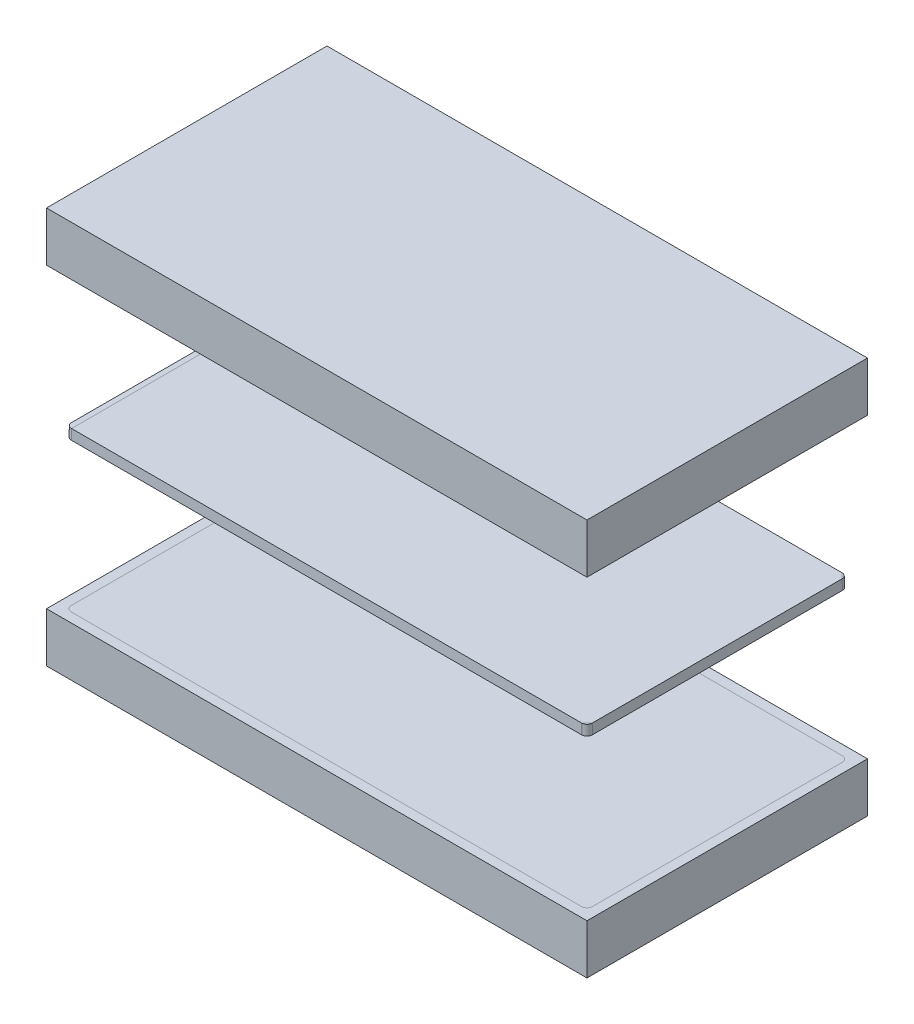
ISO-10303-21;
HEADER;
FILE_DESCRIPTION(('STEP AP214'),'2;1');
FILE_NAME('part.step','',(''),(''),'','','');
FILE_SCHEMA(('AUTOMOTIVE_DESIGN { 1 0 10303 214 1 1 1 1 }'));
ENDSEC;
DATA;
#1=APPLICATION_CONTEXT('core data for automotive mechanical design processes');
#2=APPLICATION_PROTOCOL_DEFINITION('international standard','automotive_design',2000,#1);
#3=PRODUCT_CONTEXT('',#1,'mechanical');
#4=PRODUCT('Part','Part','',(#3));
#5=PRODUCT_RELATED_PRODUCT_CATEGORY('part','',(#4));
#6=PRODUCT_DEFINITION_FORMATION('','',#4);
#7=PRODUCT_DEFINITION_CONTEXT('part definition',#1,'design');
#8=PRODUCT_DEFINITION('design','',#6,#7);
#9=PRODUCT_DEFINITION_SHAPE('','',#8);
#10=(LENGTH_UNIT() NAMED_UNIT(*) SI_UNIT(.MILLI.,.METRE.));
#11=(NAMED_UNIT(*) PLANE_ANGLE_UNIT() SI_UNIT($,.RADIAN.));
#12=(NAMED_UNIT(*) SI_UNIT($,.STERADIAN.) SOLID_ANGLE_UNIT());
#13=UNCERTAINTY_MEASURE_WITH_UNIT(LENGTH_MEASURE(1.E-05),#10,'distance_accuracy_value','');
#14=(GEOMETRIC_REPRESENTATION_CONTEXT(3) GLOBAL_UNCERTAINTY_ASSIGNED_CONTEXT((#13)) GLOBAL_UNIT_ASSIGNED_CONTEXT((#10,
#11,#12)) REPRESENTATION_CONTEXT('',''));
#15=CARTESIAN_POINT('',(0.,0.,0.));
#16=DIRECTION('',(0.,0.,1.));
#17=DIRECTION('',(1.,0.,0.));
#18=AXIS2_PLACEMENT_3D('',#15,#16,#17);
#19=CARTESIAN_POINT('',(0.,200.,0.));
#20=DIRECTION('',(0.,1.,0.));
#21=DIRECTION('',(0.,0.,1.));
#22=AXIS2_PLACEMENT_3D('',#19,#20,#21);
#23=PLANE('',#22);
#24=DIRECTION('',(0.,0.,1.));
#25=VECTOR('',#24,1.);
#26=CARTESIAN_POINT('',(276.447770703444,200.,136.137711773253));
#27=LINE('',#26,#25);
#28=CARTESIAN_POINT('',(276.447770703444,200.,-146.711495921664));
#29=VERTEX_POINT('',#28);
#30=CARTESIAN_POINT('',(276.447770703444,200.,136.137711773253));
#31=VERTEX_POINT('',#30);
#32=EDGE_CURVE('E959',#29,#31,#27,.T.);
#33=ORIENTED_EDGE('',*,*,#32,.F.);
#34=DIRECTION('',(1.,0.,0.));
#35=VECTOR('',#34,1.);
#36=CARTESIAN_POINT('',(276.447770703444,200.,-146.711495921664));
#37=LINE('',#36,#35);
#38=CARTESIAN_POINT('',(-268.552229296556,200.,-146.711495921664));
#39=VERTEX_POINT('',#38);
#40=EDGE_CURVE('E966',#39,#29,#37,.T.);
#41=ORIENTED_EDGE('',*,*,#40,.F.);
#42=DIRECTION('',(0.,0.,-1.));
#43=VECTOR('',#42,1.);
#44=CARTESIAN_POINT('',(-268.552229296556,200.,136.137711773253));
#45=LINE('',#44,#43);
#46=CARTESIAN_POINT('',(-268.552229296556,200.,136.137711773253));
#47=VERTEX_POINT('',#46);
#48=EDGE_CURVE('E944',#47,#39,#45,.T.);
#49=ORIENTED_EDGE('',*,*,#48,.F.);
#50=DIRECTION('',(-1.,0.,0.));
#51=VECTOR('',#50,1.);
#52=CARTESIAN_POINT('',(276.447770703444,200.,136.137711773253));
#53=LINE('',#52,#51);
#54=EDGE_CURVE('E962',#31,#47,#53,.T.);
#55=ORIENTED_EDGE('',*,*,#54,.F.);
#56=EDGE_LOOP('',(#33,#41,#49,#55));
#57=FACE_BOUND('',#56,.T.);
#58=ADVANCED_FACE('F670',(#57),#23,.T.);
#59=CARTESIAN_POINT('',(276.447770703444,200.,136.137711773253));
#60=DIRECTION('',(0.,0.,1.));
#61=DIRECTION('',(1.,0.,0.));
#62=AXIS2_PLACEMENT_3D('',#59,#60,#61);
#63=PLANE('',#62);
#64=DIRECTION('',(0.,-1.,0.));
#65=VECTOR('',#64,1.);
#66=CARTESIAN_POINT('',(-268.552229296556,200.,136.137711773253));
#67=LINE('',#66,#65);
#68=CARTESIAN_POINT('',(-268.552229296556,150.,136.137711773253));
#69=VERTEX_POINT('',#68);
#70=EDGE_CURVE('E948',#47,#69,#67,.T.);
#71=ORIENTED_EDGE('',*,*,#70,.T.);
#72=DIRECTION('',(1.,0.,0.));
#73=VECTOR('',#72,1.);
#74=CARTESIAN_POINT('',(276.447770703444,150.,136.137711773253));
#75=LINE('',#74,#73);
#76=CARTESIAN_POINT('',(276.447770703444,150.,136.137711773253));
#77=VERTEX_POINT('',#76);
#78=EDGE_CURVE('E674',#69,#77,#75,.T.);
#79=ORIENTED_EDGE('',*,*,#78,.T.);
#80=DIRECTION('',(0.,-1.,0.));
#81=VECTOR('',#80,1.);
#82=CARTESIAN_POINT('',(276.447770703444,200.,136.137711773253));
#83=LINE('',#82,#81);
#84=EDGE_CURVE('E968',#31,#77,#83,.T.);
#85=ORIENTED_EDGE('',*,*,#84,.F.);
#86=ORIENTED_EDGE('',*,*,#54,.T.);
#87=EDGE_LOOP('',(#71,#79,#85,#86));
#88=FACE_BOUND('',#87,.T.);
#89=ADVANCED_FACE('F917',(#88),#63,.T.);
#90=CARTESIAN_POINT('',(-268.552229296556,200.,136.137711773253));
#91=DIRECTION('',(-1.,0.,0.));
#92=DIRECTION('',(0.,0.,1.));
#93=AXIS2_PLACEMENT_3D('',#90,#91,#92);
#94=PLANE('',#93);
#95=DIRECTION('',(0.,-1.,0.));
#96=VECTOR('',#95,1.);
#97=CARTESIAN_POINT('',(-268.552229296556,200.,-146.711495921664));
#98=LINE('',#97,#96);
#99=CARTESIAN_POINT('',(-268.552229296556,150.,-146.711495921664));
#100=VERTEX_POINT('',#99);
#101=EDGE_CURVE('E938',#39,#100,#98,.T.);
#102=ORIENTED_EDGE('',*,*,#101,.T.);
#103=DIRECTION('',(0.,0.,1.));
#104=VECTOR('',#103,1.);
#105=CARTESIAN_POINT('',(-268.552229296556,150.,136.137711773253));
#106=LINE('',#105,#104);
#107=EDGE_CURVE('E852',#100,#69,#106,.T.);
#108=ORIENTED_EDGE('',*,*,#107,.T.);
#109=ORIENTED_EDGE('',*,*,#70,.F.);
#110=ORIENTED_EDGE('',*,*,#48,.T.);
#111=EDGE_LOOP('',(#102,#108,#109,#110));
#112=FACE_BOUND('',#111,.T.);
#113=ADVANCED_FACE('F922',(#112),#94,.T.);
#114=CARTESIAN_POINT('',(276.447770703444,200.,-146.711495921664));
#115=DIRECTION('',(0.,0.,-1.));
#116=DIRECTION('',(-1.,0.,0.));
#117=AXIS2_PLACEMENT_3D('',#114,#115,#116);
#118=PLANE('',#117);
#119=DIRECTION('',(0.,-1.,0.));
#120=VECTOR('',#119,1.);
#121=CARTESIAN_POINT('',(276.447770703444,200.,-146.711495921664));
#122=LINE('',#121,#120);
#123=CARTESIAN_POINT('',(276.447770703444,150.,-146.711495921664));
#124=VERTEX_POINT('',#123);
#125=EDGE_CURVE('E947',#29,#124,#122,.T.);
#126=ORIENTED_EDGE('',*,*,#125,.T.);
#127=DIRECTION('',(-1.,0.,0.));
#128=VECTOR('',#127,1.);
#129=CARTESIAN_POINT('',(276.447770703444,150.,-146.711495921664));
#130=LINE('',#129,#128);
#131=EDGE_CURVE('E952',#124,#100,#130,.T.);
#132=ORIENTED_EDGE('',*,*,#131,.T.);
#133=ORIENTED_EDGE('',*,*,#101,.F.);
#134=ORIENTED_EDGE('',*,*,#40,.T.);
#135=EDGE_LOOP('',(#126,#132,#133,#134));
#136=FACE_BOUND('',#135,.T.);
#137=ADVANCED_FACE('F926',(#136),#118,.T.);
#138=CARTESIAN_POINT('',(276.447770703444,200.,136.137711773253));
#139=DIRECTION('',(1.,0.,0.));
#140=DIRECTION('',(0.,0.,-1.));
#141=AXIS2_PLACEMENT_3D('',#138,#139,#140);
#142=PLANE('',#141);
#143=ORIENTED_EDGE('',*,*,#84,.T.);
#144=DIRECTION('',(0.,0.,-1.));
#145=VECTOR('',#144,1.);
#146=CARTESIAN_POINT('',(276.447770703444,150.,136.137711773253));
#147=LINE('',#146,#145);
#148=EDGE_CURVE('E956',#77,#124,#147,.T.);
#149=ORIENTED_EDGE('',*,*,#148,.T.);
#150=ORIENTED_EDGE('',*,*,#125,.F.);
#151=ORIENTED_EDGE('',*,*,#32,.T.);
#152=EDGE_LOOP('',(#143,#149,#150,#151));
#153=FACE_BOUND('',#152,.T.);
#154=ADVANCED_FACE('F672',(#153),#142,.T.);
#155=CARTESIAN_POINT('',(-253.301429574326,160.,-131.111488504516));
#156=DIRECTION('',(0.,1.,0.));
#157=DIRECTION('',(0.,0.,1.));
#158=AXIS2_PLACEMENT_3D('',#155,#156,#157);
#159=PLANE('',#158);
#160=CARTESIAN_POINT('',(-253.303028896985,160.,-136.362288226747));
#161=CARTESIAN_POINT('',(-253.450561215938,160.,-136.362288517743));
#162=CARTESIAN_POINT('',(-253.598082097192,160.,-136.355993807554));
#163=CARTESIAN_POINT('',(-253.892080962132,160.,-136.331013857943));
#164=CARTESIAN_POINT('',(-254.038558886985,160.,-136.31232792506));
#165=CARTESIAN_POINT('',(-254.329319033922,160.,-136.262784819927));
#166=CARTESIAN_POINT('',(-254.473602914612,160.,-136.231937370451));
#167=CARTESIAN_POINT('',(-254.759078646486,160.,-136.158280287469));
#168=CARTESIAN_POINT('',(-254.900270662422,160.,-136.115471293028));
#169=CARTESIAN_POINT('',(-255.178620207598,160.,-136.018038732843));
#170=CARTESIAN_POINT('',(-255.31577518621,160.,-135.963407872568));
#171=CARTESIAN_POINT('',(-255.584946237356,160.,-135.842682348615));
#172=CARTESIAN_POINT('',(-255.716962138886,160.,-135.776587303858));
#173=CARTESIAN_POINT('',(-255.974956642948,160.,-135.633576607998));
#174=CARTESIAN_POINT('',(-256.100936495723,160.,-135.556663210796));
#175=CARTESIAN_POINT('',(-256.346021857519,160.,-135.392569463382));
#176=CARTESIAN_POINT('',(-256.465127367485,160.,-135.305389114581));
#177=CARTESIAN_POINT('',(-256.695681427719,160.,-135.121288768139));
#178=CARTESIAN_POINT('',(-256.807125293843,160.,-135.024362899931));
#179=CARTESIAN_POINT('',(-257.021358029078,160.,-134.821383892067));
#180=CARTESIAN_POINT('',(-257.124147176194,160.,-134.715331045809));
#181=CARTESIAN_POINT('',(-257.320400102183,160.,-134.494884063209));
#182=CARTESIAN_POINT('',(-257.413862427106,160.,-134.380488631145));
#183=CARTESIAN_POINT('',(-257.590862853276,160.,-134.144304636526));
#184=CARTESIAN_POINT('',(-257.674400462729,160.,-134.022515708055));
#185=CARTESIAN_POINT('',(-257.909117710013,160.,-133.647507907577));
#186=CARTESIAN_POINT('',(-258.04473261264,160.,-133.384275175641));
#187=CARTESIAN_POINT('',(-258.269263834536,160.,-132.838833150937));
#188=CARTESIAN_POINT('',(-258.358206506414,160.,-132.556634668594));
#189=CARTESIAN_POINT('',(-258.465851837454,160.,-132.079484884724));
#190=CARTESIAN_POINT('',(-258.498154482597,160.,-131.887493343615));
#191=CARTESIAN_POINT('',(-258.541320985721,160.,-131.501397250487));
#192=CARTESIAN_POINT('',(-258.552215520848,160.,-131.307296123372));
#193=CARTESIAN_POINT('',(-258.552229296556,160.,-131.113087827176));
#194=B_SPLINE_CURVE_WITH_KNOTS('',3,(#160,#161,#162,#163,#164,#165,#166,#167,#168,#169,#170,
#171,#172,#173,#174,#175,#176,#177,#178,#179,#180,#181,#182,#183,#184,#185,#186,#187,#188,#189,
#190,#191,#192,#193),.UNSPECIFIED.,.F.,.F.,(4,2,2,2,2,2,2,2,2,2,2,2,2,2,2,2,4),(0.,
0.442447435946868,0.884919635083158,1.32703880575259,1.76913435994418,2.21150348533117,
2.65388731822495,3.09617912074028,3.53847086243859,3.9810306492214,4.42357621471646,
4.8661906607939,5.30882703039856,6.19262283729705,7.07591908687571,7.65888062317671,
8.24100618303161),.UNSPECIFIED.);
#195=CARTESIAN_POINT('',(-253.303028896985,160.,-136.362288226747));
#196=VERTEX_POINT('',#195);
#197=CARTESIAN_POINT('',(-258.552229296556,160.,-131.113087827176));
#198=VERTEX_POINT('',#197);
#199=EDGE_CURVE('E848',#196,#198,#194,.T.);
#200=ORIENTED_EDGE('',*,*,#199,.F.);
#201=DIRECTION('',(-1.,0.,0.));
#202=VECTOR('',#201,1.);
#203=CARTESIAN_POINT('',(261.198570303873,160.,-136.362288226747));
#204=LINE('',#203,#202);
#205=CARTESIAN_POINT('',(261.198570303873,160.,-136.362288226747));
#206=VERTEX_POINT('',#205);
#207=EDGE_CURVE('E803',#206,#196,#204,.T.);
#208=ORIENTED_EDGE('',*,*,#207,.F.);
#209=CARTESIAN_POINT('',(266.447770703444,160.,-131.113087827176));
#210=CARTESIAN_POINT('',(266.447770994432,160.,-131.260620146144));
#211=CARTESIAN_POINT('',(266.441476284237,160.,-131.408141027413));
#212=CARTESIAN_POINT('',(266.416496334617,160.,-131.702139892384));
#213=CARTESIAN_POINT('',(266.39781040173,160.,-131.848617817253));
#214=CARTESIAN_POINT('',(266.348267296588,160.,-132.13937796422));
#215=CARTESIAN_POINT('',(266.317419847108,160.,-132.283661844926));
#216=CARTESIAN_POINT('',(266.243762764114,160.,-132.569137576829));
#217=CARTESIAN_POINT('',(266.200953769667,160.,-132.71032959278));
#218=CARTESIAN_POINT('',(266.103521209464,160.,-132.988679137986));
#219=CARTESIAN_POINT('',(266.048890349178,160.,-133.125834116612));
#220=CARTESIAN_POINT('',(265.928164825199,160.,-133.395005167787));
#221=CARTESIAN_POINT('',(265.862069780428,160.,-133.52702106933));
#222=CARTESIAN_POINT('',(265.719059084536,160.,-133.785015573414));
#223=CARTESIAN_POINT('',(265.642145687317,160.,-133.9109954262));
#224=CARTESIAN_POINT('',(265.478051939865,160.,-134.156080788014));
#225=CARTESIAN_POINT('',(265.390871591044,160.,-134.275186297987));
#226=CARTESIAN_POINT('',(265.206771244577,160.,-134.505740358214));
#227=CARTESIAN_POINT('',(265.109845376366,160.,-134.617184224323));
#228=CARTESIAN_POINT('',(264.9068663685,160.,-134.831416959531));
#229=CARTESIAN_POINT('',(264.800813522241,160.,-134.934206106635));
#230=CARTESIAN_POINT('',(264.580366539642,160.,-135.130459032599));
#231=CARTESIAN_POINT('',(264.465971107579,160.,-135.223921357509));
#232=CARTESIAN_POINT('',(264.229787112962,160.,-135.400921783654));
#233=CARTESIAN_POINT('',(264.107998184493,160.,-135.484459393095));
#234=CARTESIAN_POINT('',(263.732990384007,160.,-135.719176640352));
#235=CARTESIAN_POINT('',(263.469757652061,160.,-135.854791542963));
#236=CARTESIAN_POINT('',(262.924315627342,160.,-136.079322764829));
#237=CARTESIAN_POINT('',(262.642117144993,160.,-136.168265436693));
#238=CARTESIAN_POINT('',(262.164967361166,160.,-136.275910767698));
#239=CARTESIAN_POINT('',(261.972975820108,160.,-136.308213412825));
#240=CARTESIAN_POINT('',(261.586879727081,160.,-136.351379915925));
#241=CARTESIAN_POINT('',(261.392778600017,160.,-136.362274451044));
#242=CARTESIAN_POINT('',(261.198570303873,160.,-136.362288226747));
#243=B_SPLINE_CURVE_WITH_KNOTS('',3,(#209,#210,#211,#212,#213,#214,#215,#216,#217,#218,#219,
#220,#221,#222,#223,#224,#225,#226,#227,#228,#229,#230,#231,#232,#233,#234,#235,#236,#237,#238,
#239,#240,#241,#242),.UNSPECIFIED.,.F.,.F.,(4,2,2,2,2,2,2,2,2,2,2,2,2,2,2,2,4),(0.,
0.442447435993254,0.884919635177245,1.32703880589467,1.76913436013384,2.21150348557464,
2.6538873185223,3.09617912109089,3.53847086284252,3.98103064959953,4.42357621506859,
4.86619066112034,5.30882703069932,6.19262283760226,7.07591908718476,7.65888062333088,
8.24100618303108),.UNSPECIFIED.);
#244=CARTESIAN_POINT('',(266.447770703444,160.,-131.113087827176));
#245=VERTEX_POINT('',#244);
#246=EDGE_CURVE('E829',#245,#206,#243,.T.);
#247=ORIENTED_EDGE('',*,*,#246,.F.);
#248=DIRECTION('',(0.,0.,-1.));
#249=VECTOR('',#248,1.);
#250=CARTESIAN_POINT('',(266.447770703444,160.,120.888511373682));
#251=LINE('',#250,#249);
#252=CARTESIAN_POINT('',(266.447770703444,160.,120.888511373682));
#253=VERTEX_POINT('',#252);
#254=EDGE_CURVE('E836',#253,#245,#251,.T.);
#255=ORIENTED_EDGE('',*,*,#254,.F.);
#256=CARTESIAN_POINT('',(261.198570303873,160.,126.137711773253));
#257=CARTESIAN_POINT('',(261.346102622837,160.,126.137712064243));
#258=CARTESIAN_POINT('',(261.493623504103,160.,126.13141735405));
#259=CARTESIAN_POINT('',(261.787622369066,160.,126.106437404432));
#260=CARTESIAN_POINT('',(261.934100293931,160.,126.087751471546));
#261=CARTESIAN_POINT('',(262.224860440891,160.,126.038208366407));
#262=CARTESIAN_POINT('',(262.369144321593,160.,126.007360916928));
#263=CARTESIAN_POINT('',(262.654620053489,160.,125.933703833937));
#264=CARTESIAN_POINT('',(262.795812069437,160.,125.890894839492));
#265=CARTESIAN_POINT('',(263.074161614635,160.,125.793462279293));
#266=CARTESIAN_POINT('',(263.211316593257,160.,125.738831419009));
#267=CARTESIAN_POINT('',(263.480487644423,160.,125.618105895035));
#268=CARTESIAN_POINT('',(263.612503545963,160.,125.552010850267));
#269=CARTESIAN_POINT('',(263.870498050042,160.,125.409000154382));
#270=CARTESIAN_POINT('',(263.996477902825,160.,125.332086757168));
#271=CARTESIAN_POINT('',(264.241563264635,160.,125.167993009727));
#272=CARTESIAN_POINT('',(264.360668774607,160.,125.080812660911));
#273=CARTESIAN_POINT('',(264.591222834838,160.,124.89671231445));
#274=CARTESIAN_POINT('',(264.702666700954,160.,124.799786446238));
#275=CARTESIAN_POINT('',(264.916899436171,160.,124.596807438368));
#276=CARTESIAN_POINT('',(265.019688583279,160.,124.490754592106));
#277=CARTESIAN_POINT('',(265.21594150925,160.,124.270307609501));
#278=CARTESIAN_POINT('',(265.309403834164,160.,124.155912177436));
#279=CARTESIAN_POINT('',(265.486404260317,160.,123.919728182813));
#280=CARTESIAN_POINT('',(265.569941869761,160.,123.797939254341));
#281=CARTESIAN_POINT('',(265.804659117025,160.,123.422931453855));
#282=CARTESIAN_POINT('',(265.94027401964,160.,123.159698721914));
#283=CARTESIAN_POINT('',(266.164805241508,160.,122.614256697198));
#284=CARTESIAN_POINT('',(266.253747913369,160.,122.33205821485));
#285=CARTESIAN_POINT('',(266.361393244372,160.,121.854908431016));
#286=CARTESIAN_POINT('',(266.3936958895,160.,121.662916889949));
#287=CARTESIAN_POINT('',(266.436862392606,160.,121.276820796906));
#288=CARTESIAN_POINT('',(266.44775692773,160.,121.082719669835));
#289=CARTESIAN_POINT('',(266.447770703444,160.,120.888511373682));
#290=B_SPLINE_CURVE_WITH_KNOTS('',3,(#256,#257,#258,#259,#260,#261,#262,#263,#264,#265,#266,
#267,#268,#269,#270,#271,#272,#273,#274,#275,#276,#277,#278,#279,#280,#281,#282,#283,#284,#285,
#286,#287,#288,#289),.UNSPECIFIED.,.F.,.F.,(4,2,2,2,2,2,2,2,2,2,2,2,2,2,2,2,4),(0.,
0.442447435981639,0.884919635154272,1.32703880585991,1.76913436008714,2.21150348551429,
2.65388731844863,3.09617912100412,3.53847086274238,3.98103064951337,4.42357621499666,
4.86619066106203,5.30882703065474,6.19262283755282,7.07591908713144,7.65888062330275,
8.2410061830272),.UNSPECIFIED.);
#291=CARTESIAN_POINT('',(261.198570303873,160.,126.137711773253));
#292=VERTEX_POINT('',#291);
#293=EDGE_CURVE('E777',#292,#253,#290,.T.);
#294=ORIENTED_EDGE('',*,*,#293,.F.);
#295=DIRECTION('',(1.,0.,0.));
#296=VECTOR('',#295,1.);
#297=CARTESIAN_POINT('',(-253.303028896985,160.,126.137711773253));
#298=LINE('',#297,#296);
#299=CARTESIAN_POINT('',(-253.303028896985,160.,126.137711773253));
#300=VERTEX_POINT('',#299);
#301=EDGE_CURVE('E858',#300,#292,#298,.T.);
#302=ORIENTED_EDGE('',*,*,#301,.F.);
#303=CARTESIAN_POINT('',(-258.552229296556,160.,120.888511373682));
#304=CARTESIAN_POINT('',(-258.552229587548,160.,121.036043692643));
#305=CARTESIAN_POINT('',(-258.545934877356,160.,121.183564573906));
#306=CARTESIAN_POINT('',(-258.520954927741,160.,121.477563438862));
#307=CARTESIAN_POINT('',(-258.502268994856,160.,121.624041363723));
#308=CARTESIAN_POINT('',(-258.452725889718,160.,121.914801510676));
#309=CARTESIAN_POINT('',(-258.421878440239,160.,122.059085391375));
#310=CARTESIAN_POINT('',(-258.34822135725,160.,122.344561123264));
#311=CARTESIAN_POINT('',(-258.305412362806,160.,122.485753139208));
#312=CARTESIAN_POINT('',(-258.207979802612,160.,122.7641026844));
#313=CARTESIAN_POINT('',(-258.153348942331,160.,122.901257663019));
#314=CARTESIAN_POINT('',(-258.032623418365,160.,123.170428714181));
#315=CARTESIAN_POINT('',(-257.966528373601,160.,123.302444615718));
#316=CARTESIAN_POINT('',(-257.823517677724,160.,123.560439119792));
#317=CARTESIAN_POINT('',(-257.746604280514,160.,123.686418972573));
#318=CARTESIAN_POINT('',(-257.58251053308,160.,123.931504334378));
#319=CARTESIAN_POINT('',(-257.495330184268,160.,124.050609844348));
#320=CARTESIAN_POINT('',(-257.311229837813,160.,124.281163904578));
#321=CARTESIAN_POINT('',(-257.214303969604,160.,124.392607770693));
#322=CARTESIAN_POINT('',(-257.011324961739,160.,124.606840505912));
#323=CARTESIAN_POINT('',(-256.90527211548,160.,124.709629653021));
#324=CARTESIAN_POINT('',(-256.684825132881,160.,124.905882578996));
#325=CARTESIAN_POINT('',(-256.570429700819,160.,124.999344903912));
#326=CARTESIAN_POINT('',(-256.334245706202,160.,125.17634533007));
#327=CARTESIAN_POINT('',(-256.212456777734,160.,125.259882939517));
#328=CARTESIAN_POINT('',(-255.837448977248,160.,125.49460018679));
#329=CARTESIAN_POINT('',(-255.574216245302,160.,125.630215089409));
#330=CARTESIAN_POINT('',(-255.028774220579,160.,125.85474631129));
#331=CARTESIAN_POINT('',(-254.746575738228,160.,125.943688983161));
#332=CARTESIAN_POINT('',(-254.269425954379,160.,126.051334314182));
#333=CARTESIAN_POINT('',(-254.077434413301,160.,126.083636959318));
#334=CARTESIAN_POINT('',(-253.691338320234,160.,126.126803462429));
#335=CARTESIAN_POINT('',(-253.497237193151,160.,126.137697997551));
#336=CARTESIAN_POINT('',(-253.303028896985,160.,126.137711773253));
#337=B_SPLINE_CURVE_WITH_KNOTS('',3,(#303,#304,#305,#306,#307,#308,#309,#310,#311,#312,#313,
#314,#315,#316,#317,#318,#319,#320,#321,#322,#323,#324,#325,#326,#327,#328,#329,#330,#331,#332,
#333,#334,#335,#336),.UNSPECIFIED.,.F.,.F.,(4,2,2,2,2,2,2,2,2,2,2,2,2,2,2,2,4),(0.,
0.442447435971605,0.884919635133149,1.32703880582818,1.76913436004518,2.21150348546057,
2.65388731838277,3.09617912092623,3.53847086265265,3.98103064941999,4.42357621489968,
4.86619066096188,5.30882703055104,6.19262283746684,7.07591908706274,7.65888062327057,
8.24100618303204),.UNSPECIFIED.);
#338=CARTESIAN_POINT('',(-258.552229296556,160.,120.888511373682));
#339=VERTEX_POINT('',#338);
#340=EDGE_CURVE('E856',#339,#300,#337,.T.);
#341=ORIENTED_EDGE('',*,*,#340,.F.);
#342=DIRECTION('',(0.,0.,1.));
#343=VECTOR('',#342,1.);
#344=CARTESIAN_POINT('',(-258.552229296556,160.,-131.113087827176));
#345=LINE('',#344,#343);
#346=EDGE_CURVE('E851',#198,#339,#345,.T.);
#347=ORIENTED_EDGE('',*,*,#346,.F.);
#348=EDGE_LOOP('',(#200,#208,#247,#255,#294,#302,#341,#347));
#349=FACE_BOUND('',#348,.T.);
#350=ADVANCED_FACE('F819',(#349),#159,.F.);
#351=CARTESIAN_POINT('',(266.866819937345,148.,-131.113087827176));
#352=CARTESIAN_POINT('',(266.866819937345,148.,-131.855258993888));
#353=CARTESIAN_POINT('',(266.719306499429,148.,-132.596836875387));
#354=CARTESIAN_POINT('',(266.151466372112,148.,-133.967846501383));
#355=CARTESIAN_POINT('',(265.731362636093,148.,-134.596604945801));
#356=CARTESIAN_POINT('',(264.682087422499,148.,-135.645880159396));
#357=CARTESIAN_POINT('',(264.05332897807,148.,-136.065983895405));
#358=CARTESIAN_POINT('',(262.682319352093,148.,-136.633824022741));
#359=CARTESIAN_POINT('',(261.940741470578,148.,-136.781337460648));
#360=CARTESIAN_POINT('',(261.198570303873,148.,-136.781337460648));
#361=CARTESIAN_POINT('',(266.447770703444,160.,-131.113087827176));
#362=CARTESIAN_POINT('',(266.447770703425,160.,-131.800406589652));
#363=CARTESIAN_POINT('',(266.31116008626,160.,-132.487165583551));
#364=CARTESIAN_POINT('',(265.785300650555,160.,-133.756815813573));
#365=CARTESIAN_POINT('',(265.396258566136,160.,-134.339083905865));
#366=CARTESIAN_POINT('',(264.424566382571,160.,-135.310776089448));
#367=CARTESIAN_POINT('',(263.84229829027,160.,-135.699818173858));
#368=CARTESIAN_POINT('',(262.572648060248,160.,-136.225677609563));
#369=CARTESIAN_POINT('',(261.885889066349,160.,-136.362288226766));
#370=CARTESIAN_POINT('',(261.198570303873,160.,-136.362288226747));
#371=B_SPLINE_SURFACE_WITH_KNOTS('',1,3,((#351,#352,#353,#354,#355,#356,#357,#358,#359,#360),
(#361,#362,#363,#364,#365,#366,#367,#368,#369,#370)),.UNSPECIFIED.,.F.,.F.,.F.,(2,2),(4,2,2,2,
4),(0.,1.),(5.49793943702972,5.89056237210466,6.28318530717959,6.67580824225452,
7.06843117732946),.UNSPECIFIED.);
#372=CARTESIAN_POINT('',(266.796978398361,150.,-131.113087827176));
#373=CARTESIAN_POINT('',(266.796978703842,150.,-131.270411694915));
#374=CARTESIAN_POINT('',(266.79026706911,150.,-131.427723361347));
#375=CARTESIAN_POINT('',(266.763632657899,150.,-131.741234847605));
#376=CARTESIAN_POINT('',(266.743709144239,150.,-131.897434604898));
#377=CARTESIAN_POINT('',(266.690884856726,150.,-132.207493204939));
#378=CARTESIAN_POINT('',(266.657994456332,150.,-132.361353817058));
#379=CARTESIAN_POINT('',(266.579459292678,150.,-132.665778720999));
#380=CARTESIAN_POINT('',(266.533815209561,150.,-132.816343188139));
#381=CARTESIAN_POINT('',(266.429930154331,150.,-133.11317105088));
#382=CARTESIAN_POINT('',(266.371681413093,150.,-133.259431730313));
#383=CARTESIAN_POINT('',(266.242960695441,150.,-133.546474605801));
#384=CARTESIAN_POINT('',(266.172488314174,150.,-133.687256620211));
#385=CARTESIAN_POINT('',(266.02000601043,150.,-133.962384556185));
#386=CARTESIAN_POINT('',(265.937998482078,150.,-134.096731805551));
#387=CARTESIAN_POINT('',(265.763036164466,150.,-134.358097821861));
#388=CARTESIAN_POINT('',(265.670081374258,150.,-134.48511658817));
#389=CARTESIAN_POINT('',(265.473771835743,150.,-134.731009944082));
#390=CARTESIAN_POINT('',(265.370409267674,150.,-134.849878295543));
#391=CARTESIAN_POINT('',(265.153948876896,150.,-135.078385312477));
#392=CARTESIAN_POINT('',(265.040851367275,150.,-135.188024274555));
#393=CARTESIAN_POINT('',(264.80575898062,150.,-135.397357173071));
#394=CARTESIAN_POINT('',(264.683762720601,150.,-135.497049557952));
#395=CARTESIAN_POINT('',(264.431884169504,150.,-135.685850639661));
#396=CARTESIAN_POINT('',(264.302001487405,150.,-135.774958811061));
#397=CARTESIAN_POINT('',(263.902068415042,150.,-136.025332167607));
#398=CARTESIAN_POINT('',(263.621336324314,150.,-136.169998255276));
#399=CARTESIAN_POINT('',(263.039627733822,150.,-136.409526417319));
#400=CARTESIAN_POINT('',(262.738662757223,150.,-136.50441657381));
#401=CARTESIAN_POINT('',(262.22969270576,150.,-136.619292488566));
#402=CARTESIAN_POINT('',(262.024843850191,150.,-136.653773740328));
#403=CARTESIAN_POINT('',(261.612889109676,150.,-136.699851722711));
#404=CARTESIAN_POINT('',(261.405786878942,150.,-136.711481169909));
#405=CARTESIAN_POINT('',(261.198570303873,150.,-136.711495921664));
#406=B_SPLINE_CURVE_WITH_KNOTS('',3,(#372,#373,#374,#375,#376,#377,#378,#379,#380,#381,#382,
#383,#384,#385,#386,#387,#388,#389,#390,#391,#392,#393,#394,#395,#396,#397,#398,#399,#400,#401,
#402,#403,#404,#405),.UNSPECIFIED.,.F.,.F.,(4,2,2,2,2,2,2,2,2,2,2,2,2,2,2,2,4),(0.,
0.471812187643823,0.94365070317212,1.415112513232,1.88654918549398,2.35827726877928,
2.83002097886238,3.30166692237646,3.77331290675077,4.24531593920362,4.7173037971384,
5.18936516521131,5.66144995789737,6.60404807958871,7.54611384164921,8.1681217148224,
8.78923841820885),.UNSPECIFIED.);
#407=CARTESIAN_POINT('',(266.796978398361,150.,-131.11308782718));
#408=VERTEX_POINT('',#407);
#409=CARTESIAN_POINT('',(261.198570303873,150.,-136.711495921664));
#410=VERTEX_POINT('',#409);
#411=EDGE_CURVE('E795',#408,#410,#406,.T.);
#412=DIRECTION('',(0.0348994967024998,-0.999390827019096,-9.69615704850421E-13));
#413=VECTOR('',#412,1.);
#414=CARTESIAN_POINT('',(266.447770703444,160.,-131.113087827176));
#415=LINE('',#414,#413);
#416=EDGE_CURVE('E759',#245,#408,#415,.T.);
#417=DIRECTION('',(0.,-0.999390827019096,-0.034899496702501));
#418=VECTOR('',#417,1.);
#419=CARTESIAN_POINT('',(261.198570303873,160.,-136.362288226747));
#420=LINE('',#419,#418);
#421=EDGE_CURVE('E782',#206,#410,#420,.T.);
#422=ORIENTED_EDGE('',*,*,#411,.F.);
#423=ORIENTED_EDGE('',*,*,#416,.F.);
#424=ORIENTED_EDGE('',*,*,#246,.T.);
#425=ORIENTED_EDGE('',*,*,#421,.T.);
#426=EDGE_LOOP('',(#422,#423,#424,#425));
#427=FACE_BOUND('',#426,.T.);
#428=ADVANCED_FACE('F813',(#427),#371,.T.);
#429=CARTESIAN_POINT('',(266.447770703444,160.,120.888511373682));
#430=DIRECTION('',(0.999390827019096,0.034899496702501,0.));
#431=DIRECTION('',(-0.034899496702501,0.999390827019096,0.));
#432=AXIS2_PLACEMENT_3D('',#429,#430,#431);
#433=PLANE('',#432);
#434=DIRECTION('',(0.,0.,1.));
#435=VECTOR('',#434,1.);
#436=CARTESIAN_POINT('',(266.796978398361,150.,120.888511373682));
#437=LINE('',#436,#435);
#438=CARTESIAN_POINT('',(266.796978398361,150.,120.888511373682));
#439=VERTEX_POINT('',#438);
#440=EDGE_CURVE('E752',#439,#408,#437,.F.);
#441=ORIENTED_EDGE('',*,*,#440,.F.);
#442=DIRECTION('',(0.034899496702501,-0.999390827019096,0.));
#443=VECTOR('',#442,1.);
#444=CARTESIAN_POINT('',(266.447770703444,160.,120.888511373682));
#445=LINE('',#444,#443);
#446=EDGE_CURVE('E757',#253,#439,#445,.T.);
#447=ORIENTED_EDGE('',*,*,#446,.F.);
#448=ORIENTED_EDGE('',*,*,#254,.T.);
#449=ORIENTED_EDGE('',*,*,#416,.T.);
#450=EDGE_LOOP('',(#441,#447,#448,#449));
#451=FACE_BOUND('',#450,.T.);
#452=ADVANCED_FACE('F754',(#451),#433,.F.);
#453=CARTESIAN_POINT('',(261.198570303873,148.,126.556761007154));
#454=CARTESIAN_POINT('',(261.940741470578,148.,126.556761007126));
#455=CARTESIAN_POINT('',(262.682319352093,148.,126.409247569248));
#456=CARTESIAN_POINT('',(264.05332897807,148.,125.841407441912));
#457=CARTESIAN_POINT('',(264.682087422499,148.,125.421303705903));
#458=CARTESIAN_POINT('',(265.731362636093,148.,124.372028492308));
#459=CARTESIAN_POINT('',(266.151466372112,148.,123.743270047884));
#460=CARTESIAN_POINT('',(266.719306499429,148.,122.372260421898));
#461=CARTESIAN_POINT('',(266.866819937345,148.,121.630682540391));
#462=CARTESIAN_POINT('',(266.866819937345,148.,120.888511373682));
#463=CARTESIAN_POINT('',(261.198570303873,160.,126.137711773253));
#464=CARTESIAN_POINT('',(261.885889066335,160.,126.137711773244));
#465=CARTESIAN_POINT('',(262.572648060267,160.,126.001101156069));
#466=CARTESIAN_POINT('',(263.842298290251,160.,125.475241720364));
#467=CARTESIAN_POINT('',(264.424566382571,160.,125.086199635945));
#468=CARTESIAN_POINT('',(265.396258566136,160.,124.114507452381));
#469=CARTESIAN_POINT('',(265.785300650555,160.,123.532239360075));
#470=CARTESIAN_POINT('',(266.31116008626,160.,122.262589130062));
#471=CARTESIAN_POINT('',(266.447770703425,160.,121.575830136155));
#472=CARTESIAN_POINT('',(266.447770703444,160.,120.888511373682));
#473=B_SPLINE_SURFACE_WITH_KNOTS('',1,3,((#453,#454,#455,#456,#457,#458,#459,#460,#461,#462),
(#463,#464,#465,#466,#467,#468,#469,#470,#471,#472)),.UNSPECIFIED.,.F.,.F.,.F.,(2,2),(4,2,2,2,
4),(0.,1.),(5.49793943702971,5.89056237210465,6.28318530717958,6.67580824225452,
7.06843117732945),.UNSPECIFIED.);
#474=CARTESIAN_POINT('',(261.198570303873,150.,126.486919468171));
#475=CARTESIAN_POINT('',(261.35589417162,150.,126.486919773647));
#476=CARTESIAN_POINT('',(261.513205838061,150.,126.480208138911));
#477=CARTESIAN_POINT('',(261.826717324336,150.,126.453573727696));
#478=CARTESIAN_POINT('',(261.982917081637,150.,126.433650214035));
#479=CARTESIAN_POINT('',(262.292975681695,150.,126.380825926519));
#480=CARTESIAN_POINT('',(262.446836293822,150.,126.347935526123));
#481=CARTESIAN_POINT('',(262.75126119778,150.,126.269400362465));
#482=CARTESIAN_POINT('',(262.901825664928,150.,126.223756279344));
#483=CARTESIAN_POINT('',(263.198653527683,150.,126.119871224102));
#484=CARTESIAN_POINT('',(263.344914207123,150.,126.061622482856));
#485=CARTESIAN_POINT('',(263.631957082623,150.,125.932901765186));
#486=CARTESIAN_POINT('',(263.772739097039,150.,125.86242938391));
#487=CARTESIAN_POINT('',(264.047867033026,150.,125.709947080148));
#488=CARTESIAN_POINT('',(264.182214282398,150.,125.627939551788));
#489=CARTESIAN_POINT('',(264.443580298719,150.,125.452977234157));
#490=CARTESIAN_POINT('',(264.570599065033,150.,125.36002244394));
#491=CARTESIAN_POINT('',(264.816492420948,150.,125.163712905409));
#492=CARTESIAN_POINT('',(264.935360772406,150.,125.060350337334));
#493=CARTESIAN_POINT('',(265.163867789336,150.,124.843889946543));
#494=CARTESIAN_POINT('',(265.273506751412,150.,124.730792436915));
#495=CARTESIAN_POINT('',(265.482839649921,150.,124.495700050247));
#496=CARTESIAN_POINT('',(265.582532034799,150.,124.373703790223));
#497=CARTESIAN_POINT('',(265.771333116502,150.,124.121825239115));
#498=CARTESIAN_POINT('',(265.860441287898,150.,123.99194255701));
#499=CARTESIAN_POINT('',(266.110814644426,150.,123.592009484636));
#500=CARTESIAN_POINT('',(266.255480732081,150.,123.311277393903));
#501=CARTESIAN_POINT('',(266.495008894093,150.,122.729568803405));
#502=CARTESIAN_POINT('',(266.589899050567,150.,122.428603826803));
#503=CARTESIAN_POINT('',(266.704774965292,150.,121.919633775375));
#504=CARTESIAN_POINT('',(266.739256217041,150.,121.714784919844));
#505=CARTESIAN_POINT('',(266.78533419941,150.,121.302830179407));
#506=CARTESIAN_POINT('',(266.796963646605,150.,121.095727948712));
#507=CARTESIAN_POINT('',(266.796978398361,150.,120.888511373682));
#508=B_SPLINE_CURVE_WITH_KNOTS('',3,(#474,#475,#476,#477,#478,#479,#480,#481,#482,#483,#484,
#485,#486,#487,#488,#489,#490,#491,#492,#493,#494,#495,#496,#497,#498,#499,#500,#501,#502,#503,
#504,#505,#506,#507),.UNSPECIFIED.,.F.,.F.,(4,2,2,2,2,2,2,2,2,2,2,2,2,2,2,2,4),(0.,
0.471812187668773,0.943650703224,1.4151125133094,1.88654918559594,2.35827726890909,
2.83002097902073,3.30166692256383,3.77331290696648,4.24531593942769,4.7173037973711,
5.18936516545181,5.66144995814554,6.6040480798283,7.54611384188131,8.16812171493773,
8.78923841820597),.UNSPECIFIED.);
#509=CARTESIAN_POINT('',(261.198570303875,150.,126.486919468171));
#510=VERTEX_POINT('',#509);
#511=EDGE_CURVE('E765',#510,#439,#508,.T.);
#512=DIRECTION('',(4.84807852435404E-13,-0.999390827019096,0.0348994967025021));
#513=VECTOR('',#512,1.);
#514=CARTESIAN_POINT('',(261.198570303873,160.,126.137711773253));
#515=LINE('',#514,#513);
#516=EDGE_CURVE('E773',#292,#510,#515,.T.);
#517=ORIENTED_EDGE('',*,*,#511,.F.);
#518=ORIENTED_EDGE('',*,*,#516,.F.);
#519=ORIENTED_EDGE('',*,*,#293,.T.);
#520=ORIENTED_EDGE('',*,*,#446,.T.);
#521=EDGE_LOOP('',(#517,#518,#519,#520));
#522=FACE_BOUND('',#521,.T.);
#523=ADVANCED_FACE('F775',(#522),#473,.T.);
#524=CARTESIAN_POINT('',(-253.303028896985,160.,126.137711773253));
#525=DIRECTION('',(0.,0.034899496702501,0.999390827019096));
#526=DIRECTION('',(0.,-0.999390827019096,0.034899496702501));
#527=AXIS2_PLACEMENT_3D('',#524,#525,#526);
#528=PLANE('',#527);
#529=DIRECTION('',(-1.,0.,0.));
#530=VECTOR('',#529,1.);
#531=CARTESIAN_POINT('',(-253.303028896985,150.,126.486919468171));
#532=LINE('',#531,#530);
#533=CARTESIAN_POINT('',(-253.303028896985,150.,126.486919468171));
#534=VERTEX_POINT('',#533);
#535=EDGE_CURVE('E769',#534,#510,#532,.F.);
#536=ORIENTED_EDGE('',*,*,#535,.F.);
#537=DIRECTION('',(0.,-0.999390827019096,0.034899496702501));
#538=VECTOR('',#537,1.);
#539=CARTESIAN_POINT('',(-253.303028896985,160.,126.137711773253));
#540=LINE('',#539,#538);
#541=EDGE_CURVE('E730',#300,#534,#540,.T.);
#542=ORIENTED_EDGE('',*,*,#541,.F.);
#543=ORIENTED_EDGE('',*,*,#301,.T.);
#544=ORIENTED_EDGE('',*,*,#516,.T.);
#545=EDGE_LOOP('',(#536,#542,#543,#544));
#546=FACE_BOUND('',#545,.T.);
#547=ADVANCED_FACE('F880',(#546),#528,.F.);
#548=CARTESIAN_POINT('',(-258.971278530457,148.,120.888511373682));
#549=CARTESIAN_POINT('',(-258.971278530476,148.,121.630682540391));
#550=CARTESIAN_POINT('',(-258.823765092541,148.,122.372260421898));
#551=CARTESIAN_POINT('',(-258.255924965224,148.,123.743270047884));
#552=CARTESIAN_POINT('',(-257.835821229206,148.,124.372028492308));
#553=CARTESIAN_POINT('',(-256.786546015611,148.,125.421303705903));
#554=CARTESIAN_POINT('',(-256.157787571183,148.,125.841407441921));
#555=CARTESIAN_POINT('',(-254.786777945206,148.,126.409247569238));
#556=CARTESIAN_POINT('',(-254.045200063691,148.,126.556761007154));
#557=CARTESIAN_POINT('',(-253.303028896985,148.,126.556761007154));
#558=CARTESIAN_POINT('',(-258.552229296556,160.,120.888511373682));
#559=CARTESIAN_POINT('',(-258.552229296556,160.,121.575830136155));
#560=CARTESIAN_POINT('',(-258.415618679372,160.,122.262589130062));
#561=CARTESIAN_POINT('',(-257.889759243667,160.,123.532239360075));
#562=CARTESIAN_POINT('',(-257.500717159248,160.,124.114507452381));
#563=CARTESIAN_POINT('',(-256.529024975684,160.,125.086199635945));
#564=CARTESIAN_POINT('',(-255.946756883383,160.,125.475241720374));
#565=CARTESIAN_POINT('',(-254.67710665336,160.,126.00110115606));
#566=CARTESIAN_POINT('',(-253.990347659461,160.,126.137711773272));
#567=CARTESIAN_POINT('',(-253.303028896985,160.,126.137711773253));
#568=B_SPLINE_SURFACE_WITH_KNOTS('',1,3,((#548,#549,#550,#551,#552,#553,#554,#555,#556,#557),
(#558,#559,#560,#561,#562,#563,#564,#565,#566,#567)),.UNSPECIFIED.,.F.,.F.,.F.,(2,2),(4,2,2,2,
4),(0.,1.),(5.49793943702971,5.89056237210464,6.28318530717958,6.67580824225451,
7.06843117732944),.UNSPECIFIED.);
#569=CARTESIAN_POINT('',(-258.901436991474,150.,120.888511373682));
#570=CARTESIAN_POINT('',(-258.901437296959,150.,121.045835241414));
#571=CARTESIAN_POINT('',(-258.894725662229,150.,121.203146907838));
#572=CARTESIAN_POINT('',(-258.868091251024,150.,121.51665839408));
#573=CARTESIAN_POINT('',(-258.848167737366,150.,121.672858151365));
#574=CARTESIAN_POINT('',(-258.795343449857,150.,121.982916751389));
#575=CARTESIAN_POINT('',(-258.762453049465,150.,122.136777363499));
#576=CARTESIAN_POINT('',(-258.683917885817,150.,122.441202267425));
#577=CARTESIAN_POINT('',(-258.638273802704,150.,122.591766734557));
#578=CARTESIAN_POINT('',(-258.534388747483,150.,122.888594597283));
#579=CARTESIAN_POINT('',(-258.476140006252,150.,123.034855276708));
#580=CARTESIAN_POINT('',(-258.347419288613,150.,123.321898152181));
#581=CARTESIAN_POINT('',(-258.276946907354,150.,123.462680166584));
#582=CARTESIAN_POINT('',(-258.124464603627,150.,123.737808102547));
#583=CARTESIAN_POINT('',(-258.042457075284,150.,123.872155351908));
#584=CARTESIAN_POINT('',(-257.867494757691,150.,124.133521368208));
#585=CARTESIAN_POINT('',(-257.774539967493,150.,124.260540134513));
#586=CARTESIAN_POINT('',(-257.578230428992,150.,124.506433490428));
#587=CARTESIAN_POINT('',(-257.474867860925,150.,124.625301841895));
#588=CARTESIAN_POINT('',(-257.25840747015,150.,124.853808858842));
#589=CARTESIAN_POINT('',(-257.14530996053,150.,124.963447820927));
#590=CARTESIAN_POINT('',(-256.910217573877,150.,125.172780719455));
#591=CARTESIAN_POINT('',(-256.78822131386,150.,125.272473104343));
#592=CARTESIAN_POINT('',(-256.536342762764,150.,125.461274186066));
#593=CARTESIAN_POINT('',(-256.406460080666,150.,125.550382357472));
#594=CARTESIAN_POINT('',(-256.006527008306,150.,125.800755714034));
#595=CARTESIAN_POINT('',(-255.72579491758,150.,125.945421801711));
#596=CARTESIAN_POINT('',(-255.144086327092,150.,126.184949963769));
#597=CARTESIAN_POINT('',(-254.843121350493,150.,126.279840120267));
#598=CARTESIAN_POINT('',(-254.334151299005,150.,126.394716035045));
#599=CARTESIAN_POINT('',(-254.12930244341,150.,126.429197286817));
#600=CARTESIAN_POINT('',(-253.717347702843,150.,126.475275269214));
#601=CARTESIAN_POINT('',(-253.510245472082,150.,126.486904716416));
#602=CARTESIAN_POINT('',(-253.303028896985,150.,126.486919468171));
#603=B_SPLINE_CURVE_WITH_KNOTS('',3,(#569,#570,#571,#572,#573,#574,#575,#576,#577,#578,#579,
#580,#581,#582,#583,#584,#585,#586,#587,#588,#589,#590,#591,#592,#593,#594,#595,#596,#597,#598,
#599,#600,#601,#602),.UNSPECIFIED.,.F.,.F.,(4,2,2,2,2,2,2,2,2,2,2,2,2,2,2,2,4),(0.,
0.471812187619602,0.943650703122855,1.41511251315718,1.88654918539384,2.35827726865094,
2.83002097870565,3.30166692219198,3.77331290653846,4.24531593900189,4.71730379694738,
5.18936516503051,5.6614499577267,6.60404807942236,7.54611384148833,8.16812171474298,
8.78923841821),.UNSPECIFIED.);
#604=CARTESIAN_POINT('',(-258.901436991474,150.,120.888511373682));
#605=VERTEX_POINT('',#604);
#606=EDGE_CURVE('E787',#605,#534,#603,.T.);
#607=DIRECTION('',(-0.0348994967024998,-0.999390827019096,0.));
#608=VECTOR('',#607,1.);
#609=CARTESIAN_POINT('',(-258.552229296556,160.,120.888511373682));
#610=LINE('',#609,#608);
#611=EDGE_CURVE('E722',#339,#605,#610,.T.);
#612=ORIENTED_EDGE('',*,*,#606,.F.);
#613=ORIENTED_EDGE('',*,*,#611,.F.);
#614=ORIENTED_EDGE('',*,*,#340,.T.);
#615=ORIENTED_EDGE('',*,*,#541,.T.);
#616=EDGE_LOOP('',(#612,#613,#614,#615));
#617=FACE_BOUND('',#616,.T.);
#618=ADVANCED_FACE('F872',(#617),#568,.T.);
#619=CARTESIAN_POINT('',(-258.552229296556,160.,-131.113087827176));
#620=DIRECTION('',(-0.999390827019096,0.034899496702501,0.));
#621=DIRECTION('',(-0.034899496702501,-0.999390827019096,0.));
#622=AXIS2_PLACEMENT_3D('',#619,#620,#621);
#623=PLANE('',#622);
#624=DIRECTION('',(0.,0.,-1.));
#625=VECTOR('',#624,1.);
#626=CARTESIAN_POINT('',(-258.901436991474,150.,-131.113087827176));
#627=LINE('',#626,#625);
#628=CARTESIAN_POINT('',(-258.901436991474,150.,-131.113087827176));
#629=VERTEX_POINT('',#628);
#630=EDGE_CURVE('E788',#629,#605,#627,.F.);
#631=ORIENTED_EDGE('',*,*,#630,.F.);
#632=DIRECTION('',(-0.034899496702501,-0.999390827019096,0.));
#633=VECTOR('',#632,1.);
#634=CARTESIAN_POINT('',(-258.552229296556,160.,-131.113087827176));
#635=LINE('',#634,#633);
#636=EDGE_CURVE('E714',#198,#629,#635,.T.);
#637=ORIENTED_EDGE('',*,*,#636,.F.);
#638=ORIENTED_EDGE('',*,*,#346,.T.);
#639=ORIENTED_EDGE('',*,*,#611,.T.);
#640=EDGE_LOOP('',(#631,#637,#638,#639));
#641=FACE_BOUND('',#640,.T.);
#642=ADVANCED_FACE('F879',(#641),#623,.F.);
#643=CARTESIAN_POINT('',(-253.303028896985,148.,-136.781337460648));
#644=CARTESIAN_POINT('',(-254.045200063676,148.,-136.781337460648));
#645=CARTESIAN_POINT('',(-254.786777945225,148.,-136.633824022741));
#646=CARTESIAN_POINT('',(-256.157787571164,148.,-136.065983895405));
#647=CARTESIAN_POINT('',(-256.786546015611,148.,-135.645880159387));
#648=CARTESIAN_POINT('',(-257.835821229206,148.,-134.596604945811));
#649=CARTESIAN_POINT('',(-258.255924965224,148.,-133.967846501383));
#650=CARTESIAN_POINT('',(-258.823765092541,148.,-132.596836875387));
#651=CARTESIAN_POINT('',(-258.971278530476,148.,-131.855258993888));
#652=CARTESIAN_POINT('',(-258.971278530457,148.,-131.113087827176));
#653=CARTESIAN_POINT('',(-253.303028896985,160.,-136.362288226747));
#654=CARTESIAN_POINT('',(-253.990347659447,160.,-136.362288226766));
#655=CARTESIAN_POINT('',(-254.677106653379,160.,-136.225677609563));
#656=CARTESIAN_POINT('',(-255.946756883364,160.,-135.699818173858));
#657=CARTESIAN_POINT('',(-256.529024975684,160.,-135.310776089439));
#658=CARTESIAN_POINT('',(-257.500717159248,160.,-134.339083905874));
#659=CARTESIAN_POINT('',(-257.889759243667,160.,-133.756815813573));
#660=CARTESIAN_POINT('',(-258.415618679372,160.,-132.487165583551));
#661=CARTESIAN_POINT('',(-258.552229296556,160.,-131.800406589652));
#662=CARTESIAN_POINT('',(-258.552229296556,160.,-131.113087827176));
#663=B_SPLINE_SURFACE_WITH_KNOTS('',1,3,((#643,#644,#645,#646,#647,#648,#649,#650,#651,#652),
(#653,#654,#655,#656,#657,#658,#659,#660,#661,#662)),.UNSPECIFIED.,.F.,.F.,.F.,(2,2),(4,2,2,2,
4),(0.,1.),(5.49793943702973,5.89056237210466,6.28318530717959,6.67580824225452,
7.06843117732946),.UNSPECIFIED.);
#664=CARTESIAN_POINT('',(-253.303028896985,150.,-136.711495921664));
#665=CARTESIAN_POINT('',(-253.460352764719,150.,-136.711496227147));
#666=CARTESIAN_POINT('',(-253.617664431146,150.,-136.704784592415));
#667=CARTESIAN_POINT('',(-253.931175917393,150.,-136.678150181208));
#668=CARTESIAN_POINT('',(-254.087375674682,150.,-136.65822666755));
#669=CARTESIAN_POINT('',(-254.397434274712,150.,-136.605402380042));
#670=CARTESIAN_POINT('',(-254.551294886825,150.,-136.57251197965));
#671=CARTESIAN_POINT('',(-254.855719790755,150.,-136.493976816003));
#672=CARTESIAN_POINT('',(-255.006284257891,150.,-136.448332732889));
#673=CARTESIAN_POINT('',(-255.30311212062,150.,-136.344447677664));
#674=CARTESIAN_POINT('',(-255.449372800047,150.,-136.286198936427));
#675=CARTESIAN_POINT('',(-255.736415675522,150.,-136.157478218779));
#676=CARTESIAN_POINT('',(-255.877197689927,150.,-136.087005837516));
#677=CARTESIAN_POINT('',(-256.152325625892,150.,-135.934523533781));
#678=CARTESIAN_POINT('',(-256.286672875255,150.,-135.852516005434));
#679=CARTESIAN_POINT('',(-256.54803889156,150.,-135.677553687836));
#680=CARTESIAN_POINT('',(-256.675057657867,150.,-135.584598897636));
#681=CARTESIAN_POINT('',(-256.920951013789,150.,-135.388289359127));
#682=CARTESIAN_POINT('',(-257.039819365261,150.,-135.284926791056));
#683=CARTESIAN_POINT('',(-257.268326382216,150.,-135.06846640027));
#684=CARTESIAN_POINT('',(-257.377965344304,150.,-134.955368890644));
#685=CARTESIAN_POINT('',(-257.587298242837,150.,-134.720276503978));
#686=CARTESIAN_POINT('',(-257.686990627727,150.,-134.598280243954));
#687=CARTESIAN_POINT('',(-257.875791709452,150.,-134.346401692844));
#688=CARTESIAN_POINT('',(-257.964899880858,150.,-134.216519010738));
#689=CARTESIAN_POINT('',(-258.215273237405,150.,-133.816585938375));
#690=CARTESIAN_POINT('',(-258.359939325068,150.,-133.535853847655));
#691=CARTESIAN_POINT('',(-258.599467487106,150.,-132.954145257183));
#692=CARTESIAN_POINT('',(-258.694357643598,150.,-132.653180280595));
#693=CARTESIAN_POINT('',(-258.809233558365,150.,-132.14421022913));
#694=CARTESIAN_POINT('',(-258.843714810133,150.,-131.939361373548));
#695=CARTESIAN_POINT('',(-258.889792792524,150.,-131.527406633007));
#696=CARTESIAN_POINT('',(-258.901422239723,150.,-131.320304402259));
#697=CARTESIAN_POINT('',(-258.901436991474,150.,-131.113087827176));
#698=B_SPLINE_CURVE_WITH_KNOTS('',3,(#664,#665,#666,#667,#668,#669,#670,#671,#672,#673,#674,
#675,#676,#677,#678,#679,#680,#681,#682,#683,#684,#685,#686,#687,#688,#689,#690,#691,#692,#693,
#694,#695,#696,#697),.UNSPECIFIED.,.F.,.F.,(4,2,2,2,2,2,2,2,2,2,2,2,2,2,2,2,4),(0.,
0.471812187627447,0.943650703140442,1.41511251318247,1.88654918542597,2.35827726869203,
2.8300209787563,3.30166692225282,3.77331290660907,4.24531593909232,4.71730379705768,
5.18936516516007,5.66144995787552,6.60404807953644,7.546113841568,8.1681217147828,
8.7892384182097),.UNSPECIFIED.);
#699=CARTESIAN_POINT('',(-253.30302889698,150.,-136.711495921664));
#700=VERTEX_POINT('',#699);
#701=EDGE_CURVE('E690',#700,#629,#698,.T.);
#702=DIRECTION('',(9.68206379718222E-13,-0.999390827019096,-0.0348994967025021));
#703=VECTOR('',#702,1.);
#704=CARTESIAN_POINT('',(-253.303028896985,160.,-136.362288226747));
#705=LINE('',#704,#703);
#706=EDGE_CURVE('E681',#196,#700,#705,.T.);
#707=ORIENTED_EDGE('',*,*,#701,.F.);
#708=ORIENTED_EDGE('',*,*,#706,.F.);
#709=ORIENTED_EDGE('',*,*,#199,.T.);
#710=ORIENTED_EDGE('',*,*,#636,.T.);
#711=EDGE_LOOP('',(#707,#708,#709,#710));
#712=FACE_BOUND('',#711,.T.);
#713=ADVANCED_FACE('F847',(#712),#663,.T.);
#714=CARTESIAN_POINT('',(261.198570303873,160.,-136.362288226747));
#715=DIRECTION('',(0.,0.034899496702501,-0.999390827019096));
#716=DIRECTION('',(0.,0.999390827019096,0.034899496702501));
#717=AXIS2_PLACEMENT_3D('',#714,#715,#716);
#718=PLANE('',#717);
#719=DIRECTION('',(1.,0.,0.));
#720=VECTOR('',#719,1.);
#721=CARTESIAN_POINT('',(261.198570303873,150.,-136.711495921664));
#722=LINE('',#721,#720);
#723=EDGE_CURVE('E14',#410,#700,#722,.F.);
#724=ORIENTED_EDGE('',*,*,#723,.F.);
#725=ORIENTED_EDGE('',*,*,#421,.F.);
#726=ORIENTED_EDGE('',*,*,#207,.T.);
#727=ORIENTED_EDGE('',*,*,#706,.T.);
#728=EDGE_LOOP('',(#724,#725,#726,#727));
#729=FACE_BOUND('',#728,.T.);
#730=ADVANCED_FACE('F845',(#729),#718,.F.);
#731=CARTESIAN_POINT('',(266.796978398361,150.,120.888511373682));
#732=DIRECTION('',(0.,-1.,0.));
#733=DIRECTION('',(0.,0.,-1.));
#734=AXIS2_PLACEMENT_3D('',#731,#732,#733);
#735=PLANE('',#734);
#736=ORIENTED_EDGE('',*,*,#78,.F.);
#737=ORIENTED_EDGE('',*,*,#107,.F.);
#738=ORIENTED_EDGE('',*,*,#131,.F.);
#739=ORIENTED_EDGE('',*,*,#148,.F.);
#740=EDGE_LOOP('',(#736,#737,#738,#739));
#741=FACE_BOUND('',#740,.T.);
#742=ORIENTED_EDGE('',*,*,#630,.T.);
#743=ORIENTED_EDGE('',*,*,#606,.T.);
#744=ORIENTED_EDGE('',*,*,#535,.T.);
#745=ORIENTED_EDGE('',*,*,#511,.T.);
#746=ORIENTED_EDGE('',*,*,#440,.T.);
#747=ORIENTED_EDGE('',*,*,#411,.T.);
#748=ORIENTED_EDGE('',*,*,#723,.T.);
#749=ORIENTED_EDGE('',*,*,#701,.T.);
#750=EDGE_LOOP('',(#742,#743,#744,#745,#746,#747,#748,#749));
#751=FACE_BOUND('',#750,.T.);
#752=ADVANCED_FACE('F767',(#741,#751),#735,.T.);
#753=CLOSED_SHELL('',(#58,#89,#113,#137,#154,#350,#428,#452,#523,#547,#618,#642,#713,#730,#752));
#754=MANIFOLD_SOLID_BREP('B2',#753);
#755=CARTESIAN_POINT('',(276.447770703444,-100.,136.137711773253));
#756=DIRECTION('',(1.,0.,0.));
#757=DIRECTION('',(0.,0.,-1.));
#758=AXIS2_PLACEMENT_3D('',#755,#756,#757);
#759=PLANE('',#758);
#760=DIRECTION('',(0.,0.,-1.));
#761=VECTOR('',#760,1.);
#762=CARTESIAN_POINT('',(276.447770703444,-150.,136.137711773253));
#763=LINE('',#762,#761);
#764=CARTESIAN_POINT('',(276.447770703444,-150.,136.137711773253));
#765=VERTEX_POINT('',#764);
#766=CARTESIAN_POINT('',(276.447770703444,-150.,-146.711495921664));
#767=VERTEX_POINT('',#766);
#768=EDGE_CURVE('E1328',#765,#767,#763,.T.);
#769=ORIENTED_EDGE('',*,*,#768,.F.);
#770=DIRECTION('',(0.,-1.,0.));
#771=VECTOR('',#770,1.);
#772=CARTESIAN_POINT('',(276.447770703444,-100.,136.137711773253));
#773=LINE('',#772,#771);
#774=CARTESIAN_POINT('',(276.447770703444,-200.,136.137711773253));
#775=VERTEX_POINT('',#774);
#776=EDGE_CURVE('E1343',#765,#775,#773,.T.);
#777=ORIENTED_EDGE('',*,*,#776,.T.);
#778=DIRECTION('',(0.,0.,1.));
#779=VECTOR('',#778,1.);
#780=CARTESIAN_POINT('',(276.447770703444,-200.,136.137711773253));
#781=LINE('',#780,#779);
#782=CARTESIAN_POINT('',(276.447770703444,-200.,-146.711495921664));
#783=VERTEX_POINT('',#782);
#784=EDGE_CURVE('E1331',#783,#775,#781,.T.);
#785=ORIENTED_EDGE('',*,*,#784,.F.);
#786=DIRECTION('',(0.,-1.,0.));
#787=VECTOR('',#786,1.);
#788=CARTESIAN_POINT('',(276.447770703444,-100.,-146.711495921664));
#789=LINE('',#788,#787);
#790=EDGE_CURVE('E1325',#767,#783,#789,.T.);
#791=ORIENTED_EDGE('',*,*,#790,.F.);
#792=EDGE_LOOP('',(#769,#777,#785,#791));
#793=FACE_BOUND('',#792,.T.);
#794=ADVANCED_FACE('F1222',(#793),#759,.T.);
#795=CARTESIAN_POINT('',(276.447770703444,-100.,-146.711495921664));
#796=DIRECTION('',(0.,0.,-1.));
#797=DIRECTION('',(-1.,0.,0.));
#798=AXIS2_PLACEMENT_3D('',#795,#796,#797);
#799=PLANE('',#798);
#800=DIRECTION('',(-1.,0.,0.));
#801=VECTOR('',#800,1.);
#802=CARTESIAN_POINT('',(276.447770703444,-150.,-146.711495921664));
#803=LINE('',#802,#801);
#804=CARTESIAN_POINT('',(-268.552229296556,-150.,-146.711495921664));
#805=VERTEX_POINT('',#804);
#806=EDGE_CURVE('E1324',#767,#805,#803,.T.);
#807=ORIENTED_EDGE('',*,*,#806,.F.);
#808=ORIENTED_EDGE('',*,*,#790,.T.);
#809=DIRECTION('',(1.,0.,0.));
#810=VECTOR('',#809,1.);
#811=CARTESIAN_POINT('',(276.447770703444,-200.,-146.711495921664));
#812=LINE('',#811,#810);
#813=CARTESIAN_POINT('',(-268.552229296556,-200.,-146.711495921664));
#814=VERTEX_POINT('',#813);
#815=EDGE_CURVE('E1340',#814,#783,#812,.T.);
#816=ORIENTED_EDGE('',*,*,#815,.F.);
#817=DIRECTION('',(0.,-1.,0.));
#818=VECTOR('',#817,1.);
#819=CARTESIAN_POINT('',(-268.552229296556,-100.,-146.711495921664));
#820=LINE('',#819,#818);
#821=EDGE_CURVE('E1346',#805,#814,#820,.T.);
#822=ORIENTED_EDGE('',*,*,#821,.F.);
#823=EDGE_LOOP('',(#807,#808,#816,#822));
#824=FACE_BOUND('',#823,.T.);
#825=ADVANCED_FACE('F1375',(#824),#799,.T.);
#826=CARTESIAN_POINT('',(-268.552229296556,-100.,136.137711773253));
#827=DIRECTION('',(-1.,0.,0.));
#828=DIRECTION('',(0.,0.,1.));
#829=AXIS2_PLACEMENT_3D('',#826,#827,#828);
#830=PLANE('',#829);
#831=DIRECTION('',(0.,0.,1.));
#832=VECTOR('',#831,1.);
#833=CARTESIAN_POINT('',(-268.552229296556,-150.,136.137711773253));
#834=LINE('',#833,#832);
#835=CARTESIAN_POINT('',(-268.552229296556,-150.,136.137711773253));
#836=VERTEX_POINT('',#835);
#837=EDGE_CURVE('E1316',#805,#836,#834,.T.);
#838=ORIENTED_EDGE('',*,*,#837,.F.);
#839=ORIENTED_EDGE('',*,*,#821,.T.);
#840=DIRECTION('',(0.,0.,-1.));
#841=VECTOR('',#840,1.);
#842=CARTESIAN_POINT('',(-268.552229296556,-200.,136.137711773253));
#843=LINE('',#842,#841);
#844=CARTESIAN_POINT('',(-268.552229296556,-200.,136.137711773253));
#845=VERTEX_POINT('',#844);
#846=EDGE_CURVE('E1337',#845,#814,#843,.T.);
#847=ORIENTED_EDGE('',*,*,#846,.F.);
#848=DIRECTION('',(0.,-1.,0.));
#849=VECTOR('',#848,1.);
#850=CARTESIAN_POINT('',(-268.552229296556,-100.,136.137711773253));
#851=LINE('',#850,#849);
#852=EDGE_CURVE('E1349',#836,#845,#851,.T.);
#853=ORIENTED_EDGE('',*,*,#852,.F.);
#854=EDGE_LOOP('',(#838,#839,#847,#853));
#855=FACE_BOUND('',#854,.T.);
#856=ADVANCED_FACE('F1384',(#855),#830,.T.);
#857=CARTESIAN_POINT('',(276.447770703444,-100.,136.137711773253));
#858=DIRECTION('',(0.,0.,1.));
#859=DIRECTION('',(1.,0.,0.));
#860=AXIS2_PLACEMENT_3D('',#857,#858,#859);
#861=PLANE('',#860);
#862=DIRECTION('',(1.,0.,0.));
#863=VECTOR('',#862,1.);
#864=CARTESIAN_POINT('',(276.447770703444,-150.,136.137711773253));
#865=LINE('',#864,#863);
#866=EDGE_CURVE('E1225',#836,#765,#865,.T.);
#867=ORIENTED_EDGE('',*,*,#866,.F.);
#868=ORIENTED_EDGE('',*,*,#852,.T.);
#869=DIRECTION('',(-1.,0.,0.));
#870=VECTOR('',#869,1.);
#871=CARTESIAN_POINT('',(276.447770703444,-200.,136.137711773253));
#872=LINE('',#871,#870);
#873=EDGE_CURVE('E1334',#775,#845,#872,.T.);
#874=ORIENTED_EDGE('',*,*,#873,.F.);
#875=ORIENTED_EDGE('',*,*,#776,.F.);
#876=EDGE_LOOP('',(#867,#868,#874,#875));
#877=FACE_BOUND('',#876,.T.);
#878=ADVANCED_FACE('F1364',(#877),#861,.T.);
#879=CARTESIAN_POINT('',(0.,-200.,0.));
#880=DIRECTION('',(0.,1.,0.));
#881=DIRECTION('',(0.,0.,1.));
#882=AXIS2_PLACEMENT_3D('',#879,#880,#881);
#883=PLANE('',#882);
#884=ORIENTED_EDGE('',*,*,#784,.T.);
#885=ORIENTED_EDGE('',*,*,#873,.T.);
#886=ORIENTED_EDGE('',*,*,#846,.T.);
#887=ORIENTED_EDGE('',*,*,#815,.T.);
#888=EDGE_LOOP('',(#884,#885,#886,#887));
#889=FACE_BOUND('',#888,.T.);
#890=ADVANCED_FACE('F1295',(#889),#883,.F.);
#891=CARTESIAN_POINT('',(-253.301429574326,-150.,-131.111488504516));
#892=DIRECTION('',(0.,1.,0.));
#893=DIRECTION('',(0.,0.,1.));
#894=AXIS2_PLACEMENT_3D('',#891,#892,#893);
#895=PLANE('',#894);
#896=CARTESIAN_POINT('',(-253.303028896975,-150.,-136.711495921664));
#897=CARTESIAN_POINT('',(-253.851815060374,-150.,-136.711495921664));
#898=CARTESIAN_POINT('',(-254.393896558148,-150.,-136.603870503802));
#899=CARTESIAN_POINT('',(-254.93677942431,-150.,-136.496085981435));
#900=CARTESIAN_POINT('',(-255.445885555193,-150.,-136.285242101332));
#901=CARTESIAN_POINT('',(-255.951334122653,-150.,-136.075912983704));
#902=CARTESIAN_POINT('',(-256.410179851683,-150.,-135.769830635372));
#903=CARTESIAN_POINT('',(-256.870830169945,-150.,-135.462544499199));
#904=CARTESIAN_POINT('',(-257.260746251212,-150.,-135.072908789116));
#905=CARTESIAN_POINT('',(-257.647916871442,-150.,-134.686016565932));
#906=CARTESIAN_POINT('',(-257.954954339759,-150.,-134.227447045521));
#907=CARTESIAN_POINT('',(-258.262479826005,-150.,-133.768148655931));
#908=CARTESIAN_POINT('',(-258.473544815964,-150.,-133.259895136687));
#909=CARTESIAN_POINT('',(-258.684161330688,-150.,-132.752721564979));
#910=CARTESIAN_POINT('',(-258.792655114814,-150.,-132.209761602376));
#911=CARTESIAN_POINT('',(-258.901436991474,-150.,-131.665359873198));
#912=CARTESIAN_POINT('',(-258.901436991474,-150.,-131.113087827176));
#913=B_SPLINE_CURVE_WITH_KNOTS('',2,(#896,#897,#898,#899,#900,#901,#902,#903,#904,#905,#906,
#907,#908,#909,#910,#911,#912),.UNSPECIFIED.,.F.,.F.,(3,2,2,2,2,2,2,2,3),(0.,0.125,0.25,0.375,
0.5,0.625,0.75,0.875,1.),.UNSPECIFIED.);
#914=CARTESIAN_POINT('',(-253.303028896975,-150.,-136.711495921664));
#915=VERTEX_POINT('',#914);
#916=CARTESIAN_POINT('',(-258.901436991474,-150.,-131.113087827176));
#917=VERTEX_POINT('',#916);
#918=EDGE_CURVE('E1239',#915,#917,#913,.T.);
#919=ORIENTED_EDGE('',*,*,#918,.T.);
#920=DIRECTION('',(0.,0.,-1.));
#921=VECTOR('',#920,1.);
#922=CARTESIAN_POINT('',(-258.901436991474,-150.,-131.113087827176));
#923=LINE('',#922,#921);
#924=CARTESIAN_POINT('',(-258.901436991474,-150.,120.888511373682));
#925=VERTEX_POINT('',#924);
#926=EDGE_CURVE('E668',#917,#925,#923,.F.);
#927=ORIENTED_EDGE('',*,*,#926,.T.);
#928=CARTESIAN_POINT('',(-258.901436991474,-150.,120.888511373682));
#929=CARTESIAN_POINT('',(-258.901436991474,-150.,121.437297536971));
#930=CARTESIAN_POINT('',(-258.793811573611,-150.,121.979379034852));
#931=CARTESIAN_POINT('',(-258.686027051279,-150.,122.522261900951));
#932=CARTESIAN_POINT('',(-258.475183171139,-150.,123.031368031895));
#933=CARTESIAN_POINT('',(-258.265854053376,-150.,123.536816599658));
#934=CARTESIAN_POINT('',(-257.959771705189,-150.,123.995662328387));
#935=CARTESIAN_POINT('',(-257.652485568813,-150.,124.456312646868));
#936=CARTESIAN_POINT('',(-257.262849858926,-150.,124.846228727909));
#937=CARTESIAN_POINT('',(-256.875957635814,-150.,125.233399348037));
#938=CARTESIAN_POINT('',(-256.417388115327,-150.,125.540436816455));
#939=CARTESIAN_POINT('',(-255.958089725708,-150.,125.847962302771));
#940=CARTESIAN_POINT('',(-255.449836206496,-150.,126.05902729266));
#941=CARTESIAN_POINT('',(-254.94266263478,-150.,126.269643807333));
#942=CARTESIAN_POINT('',(-254.399702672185,-150.,126.378137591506));
#943=CARTESIAN_POINT('',(-253.855300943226,-150.,126.486919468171));
#944=CARTESIAN_POINT('',(-253.303028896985,-150.,126.486919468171));
#945=B_SPLINE_CURVE_WITH_KNOTS('',2,(#928,#929,#930,#931,#932,#933,#934,#935,#936,#937,#938,
#939,#940,#941,#942,#943,#944),.UNSPECIFIED.,.F.,.F.,(3,2,2,2,2,2,2,2,3),(0.,0.125,0.25,0.375,
0.5,0.625,0.75,0.875,1.),.UNSPECIFIED.);
#946=CARTESIAN_POINT('',(-253.303028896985,-150.,126.486919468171));
#947=VERTEX_POINT('',#946);
#948=EDGE_CURVE('E1232',#925,#947,#945,.T.);
#949=ORIENTED_EDGE('',*,*,#948,.T.);
#950=DIRECTION('',(-1.,0.,0.));
#951=VECTOR('',#950,1.);
#952=CARTESIAN_POINT('',(-253.303028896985,-150.,126.486919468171));
#953=LINE('',#952,#951);
#954=CARTESIAN_POINT('',(261.198570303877,-150.,126.486919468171));
#955=VERTEX_POINT('',#954);
#956=EDGE_CURVE('E1264',#947,#955,#953,.F.);
#957=ORIENTED_EDGE('',*,*,#956,.T.);
#958=CARTESIAN_POINT('',(261.198570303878,-150.,126.486919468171));
#959=CARTESIAN_POINT('',(261.747356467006,-150.,126.486919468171));
#960=CARTESIAN_POINT('',(262.289437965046,-150.,126.379294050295));
#961=CARTESIAN_POINT('',(262.832320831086,-150.,126.271509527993));
#962=CARTESIAN_POINT('',(263.341426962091,-150.,126.060665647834));
#963=CARTESIAN_POINT('',(263.846875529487,-150.,125.851336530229));
#964=CARTESIAN_POINT('',(264.305721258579,-150.,125.545254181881));
#965=CARTESIAN_POINT('',(264.766371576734,-150.,125.237968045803));
#966=CARTESIAN_POINT('',(265.156287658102,-150.,124.84833233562));
#967=CARTESIAN_POINT('',(265.543458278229,-150.,124.46144011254));
#968=CARTESIAN_POINT('',(265.850495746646,-150.,124.002870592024));
#969=CARTESIAN_POINT('',(266.158021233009,-150.,123.543572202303));
#970=CARTESIAN_POINT('',(266.369086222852,-150.,123.035318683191));
#971=CARTESIAN_POINT('',(266.579702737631,-150.,122.528145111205));
#972=CARTESIAN_POINT('',(266.688196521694,-150.,121.985185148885));
#973=CARTESIAN_POINT('',(266.796978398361,-150.,121.440783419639));
#974=CARTESIAN_POINT('',(266.796978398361,-150.,120.888511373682));
#975=B_SPLINE_CURVE_WITH_KNOTS('',2,(#958,#959,#960,#961,#962,#963,#964,#965,#966,#967,#968,
#969,#970,#971,#972,#973,#974),.UNSPECIFIED.,.F.,.F.,(3,2,2,2,2,2,2,2,3),(0.,0.125,0.25,0.375,
0.5,0.625,0.75,0.875,1.),.UNSPECIFIED.);
#976=CARTESIAN_POINT('',(266.796978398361,-150.,120.888511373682));
#977=VERTEX_POINT('',#976);
#978=EDGE_CURVE('E1271',#955,#977,#975,.T.);
#979=ORIENTED_EDGE('',*,*,#978,.T.);
#980=DIRECTION('',(0.,0.,1.));
#981=VECTOR('',#980,1.);
#982=CARTESIAN_POINT('',(266.796978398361,-150.,120.888511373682));
#983=LINE('',#982,#981);
#984=CARTESIAN_POINT('',(266.796978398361,-150.,-131.113087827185));
#985=VERTEX_POINT('',#984);
#986=EDGE_CURVE('E1279',#977,#985,#983,.F.);
#987=ORIENTED_EDGE('',*,*,#986,.T.);
#988=CARTESIAN_POINT('',(266.796978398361,-150.,-131.113087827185));
#989=CARTESIAN_POINT('',(266.796978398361,-150.,-131.661873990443));
#990=CARTESIAN_POINT('',(266.68935298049,-150.,-132.203955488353));
#991=CARTESIAN_POINT('',(266.581568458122,-150.,-132.746838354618));
#992=CARTESIAN_POINT('',(266.370724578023,-150.,-133.255944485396));
#993=CARTESIAN_POINT('',(266.161395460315,-150.,-133.761393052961));
#994=CARTESIAN_POINT('',(265.855313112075,-150.,-134.220238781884));
#995=CARTESIAN_POINT('',(265.548026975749,-150.,-134.680889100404));
#996=CARTESIAN_POINT('',(265.158391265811,-150.,-135.070805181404));
#997=CARTESIAN_POINT('',(264.771499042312,-150.,-135.457975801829));
#998=CARTESIAN_POINT('',(264.312929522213,-150.,-135.765013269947));
#999=CARTESIAN_POINT('',(263.853631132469,-150.,-136.072538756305));
#1000=CARTESIAN_POINT('',(263.345377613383,-150.,-136.283603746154));
#1001=CARTESIAN_POINT('',(262.838204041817,-150.,-136.494220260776));
#1002=CARTESIAN_POINT('',(262.295244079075,-150.,-136.602714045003));
#1003=CARTESIAN_POINT('',(261.750842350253,-150.,-136.711495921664));
#1004=CARTESIAN_POINT('',(261.198570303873,-150.,-136.711495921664));
#1005=B_SPLINE_CURVE_WITH_KNOTS('',2,(#988,#989,#990,#991,#992,#993,#994,#995,#996,#997,#998,
#999,#1000,#1001,#1002,#1003,#1004),.UNSPECIFIED.,.F.,.F.,(3,2,2,2,2,2,2,2,3),(0.,0.125,0.25,
0.375,0.5,0.625,0.75,0.875,1.),.UNSPECIFIED.);
#1006=CARTESIAN_POINT('',(261.198570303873,-150.,-136.711495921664));
#1007=VERTEX_POINT('',#1006);
#1008=EDGE_CURVE('E1302',#985,#1007,#1005,.T.);
#1009=ORIENTED_EDGE('',*,*,#1008,.T.);
#1010=DIRECTION('',(1.,0.,0.));
#1011=VECTOR('',#1010,1.);
#1012=CARTESIAN_POINT('',(261.198570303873,-150.,-136.711495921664));
#1013=LINE('',#1012,#1011);
#1014=EDGE_CURVE('E1306',#1007,#915,#1013,.F.);
#1015=ORIENTED_EDGE('',*,*,#1014,.T.);
#1016=EDGE_LOOP('',(#919,#927,#949,#957,#979,#987,#1009,#1015));
#1017=FACE_BOUND('',#1016,.T.);
#1018=ADVANCED_FACE('F1263',(#1017),#895,.T.);
#1019=CARTESIAN_POINT('',(266.796978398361,-150.,120.888511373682));
#1020=DIRECTION('',(0.,-1.,0.));
#1021=DIRECTION('',(0.,0.,-1.));
#1022=AXIS2_PLACEMENT_3D('',#1019,#1020,#1021);
#1023=PLANE('',#1022);
#1024=ORIENTED_EDGE('',*,*,#768,.T.);
#1025=ORIENTED_EDGE('',*,*,#806,.T.);
#1026=ORIENTED_EDGE('',*,*,#837,.T.);
#1027=ORIENTED_EDGE('',*,*,#866,.T.);
#1028=EDGE_LOOP('',(#1024,#1025,#1026,#1027));
#1029=FACE_BOUND('',#1028,.T.);
#1030=ORIENTED_EDGE('',*,*,#926,.F.);
#1031=ORIENTED_EDGE('',*,*,#918,.F.);
#1032=ORIENTED_EDGE('',*,*,#1014,.F.);
#1033=ORIENTED_EDGE('',*,*,#1008,.F.);
#1034=ORIENTED_EDGE('',*,*,#986,.F.);
#1035=ORIENTED_EDGE('',*,*,#978,.F.);
#1036=ORIENTED_EDGE('',*,*,#956,.F.);
#1037=ORIENTED_EDGE('',*,*,#948,.F.);
#1038=EDGE_LOOP('',(#1030,#1031,#1032,#1033,#1034,#1035,#1036,#1037));
#1039=FACE_BOUND('',#1038,.T.);
#1040=ADVANCED_FACE('F1269',(#1029,#1039),#1023,.F.);
#1041=CLOSED_SHELL('',(#794,#825,#856,#878,#890,#1018,#1040));
#1042=MANIFOLD_SOLID_BREP('B8',#1041);
#1043=CARTESIAN_POINT('',(-253.301429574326,10.,-131.111488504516));
#1044=DIRECTION('',(0.,1.,0.));
#1045=DIRECTION('',(0.,0.,1.));
#1046=AXIS2_PLACEMENT_3D('',#1043,#1044,#1045);
#1047=PLANE('',#1046);
#1048=CARTESIAN_POINT('',(-253.303028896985,10.,-136.362288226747));
#1049=CARTESIAN_POINT('',(-253.450561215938,10.,-136.362288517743));
#1050=CARTESIAN_POINT('',(-253.598082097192,10.,-136.355993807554));
#1051=CARTESIAN_POINT('',(-253.892080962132,10.,-136.331013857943));
#1052=CARTESIAN_POINT('',(-254.038558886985,10.,-136.31232792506));
#1053=CARTESIAN_POINT('',(-254.329319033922,10.,-136.262784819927));
#1054=CARTESIAN_POINT('',(-254.473602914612,10.,-136.231937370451));
#1055=CARTESIAN_POINT('',(-254.759078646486,10.,-136.158280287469));
#1056=CARTESIAN_POINT('',(-254.900270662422,10.,-136.115471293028));
#1057=CARTESIAN_POINT('',(-255.178620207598,10.,-136.018038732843));
#1058=CARTESIAN_POINT('',(-255.31577518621,10.,-135.963407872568));
#1059=CARTESIAN_POINT('',(-255.584946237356,10.,-135.842682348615));
#1060=CARTESIAN_POINT('',(-255.716962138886,10.,-135.776587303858));
#1061=CARTESIAN_POINT('',(-255.974956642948,10.,-135.633576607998));
#1062=CARTESIAN_POINT('',(-256.100936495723,10.,-135.556663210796));
#1063=CARTESIAN_POINT('',(-256.346021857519,10.,-135.392569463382));
#1064=CARTESIAN_POINT('',(-256.465127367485,10.,-135.305389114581));
#1065=CARTESIAN_POINT('',(-256.695681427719,10.,-135.121288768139));
#1066=CARTESIAN_POINT('',(-256.807125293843,10.,-135.024362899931));
#1067=CARTESIAN_POINT('',(-257.021358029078,10.,-134.821383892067));
#1068=CARTESIAN_POINT('',(-257.124147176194,10.,-134.715331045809));
#1069=CARTESIAN_POINT('',(-257.320400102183,10.,-134.494884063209));
#1070=CARTESIAN_POINT('',(-257.413862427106,10.,-134.380488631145));
#1071=CARTESIAN_POINT('',(-257.590862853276,10.,-134.144304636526));
#1072=CARTESIAN_POINT('',(-257.674400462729,10.,-134.022515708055));
#1073=CARTESIAN_POINT('',(-257.909117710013,10.,-133.647507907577));
#1074=CARTESIAN_POINT('',(-258.04473261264,10.,-133.384275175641));
#1075=CARTESIAN_POINT('',(-258.269263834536,10.,-132.838833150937));
#1076=CARTESIAN_POINT('',(-258.358206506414,10.,-132.556634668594));
#1077=CARTESIAN_POINT('',(-258.465851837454,10.,-132.079484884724));
#1078=CARTESIAN_POINT('',(-258.498154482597,10.,-131.887493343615));
#1079=CARTESIAN_POINT('',(-258.541320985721,10.,-131.501397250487));
#1080=CARTESIAN_POINT('',(-258.552215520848,10.,-131.307296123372));
#1081=CARTESIAN_POINT('',(-258.552229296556,10.,-131.113087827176));
#1082=B_SPLINE_CURVE_WITH_KNOTS('',3,(#1048,#1049,#1050,#1051,#1052,#1053,#1054,#1055,#1056,
#1057,#1058,#1059,#1060,#1061,#1062,#1063,#1064,#1065,#1066,#1067,#1068,#1069,#1070,#1071,#1072,
#1073,#1074,#1075,#1076,#1077,#1078,#1079,#1080,#1081),.UNSPECIFIED.,.F.,.F.,(4,2,2,2,2,2,2,2,2,
2,2,2,2,2,2,2,4),(0.,0.442447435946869,0.88491963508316,1.32703880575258,1.76913435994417,
2.21150348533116,2.65388731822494,3.09617912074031,3.53847086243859,3.9810306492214,
4.42357621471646,4.86619066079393,5.30882703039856,6.19262283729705,7.07591908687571,
7.65888062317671,8.24100618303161),.UNSPECIFIED.);
#1083=CARTESIAN_POINT('',(-253.303028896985,10.,-136.362288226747));
#1084=VERTEX_POINT('',#1083);
#1085=CARTESIAN_POINT('',(-258.552229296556,10.,-131.113087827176));
#1086=VERTEX_POINT('',#1085);
#1087=EDGE_CURVE('E1840',#1084,#1086,#1082,.T.);
#1088=ORIENTED_EDGE('',*,*,#1087,.T.);
#1089=DIRECTION('',(0.,0.,1.));
#1090=VECTOR('',#1089,1.);
#1091=CARTESIAN_POINT('',(-258.552229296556,10.,-131.113087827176));
#1092=LINE('',#1091,#1090);
#1093=CARTESIAN_POINT('',(-258.552229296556,10.,120.888511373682));
#1094=VERTEX_POINT('',#1093);
#1095=EDGE_CURVE('E1954',#1086,#1094,#1092,.T.);
#1096=ORIENTED_EDGE('',*,*,#1095,.T.);
#1097=CARTESIAN_POINT('',(-258.552229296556,10.,120.888511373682));
#1098=CARTESIAN_POINT('',(-258.552229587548,10.,121.036043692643));
#1099=CARTESIAN_POINT('',(-258.545934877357,10.,121.183564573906));
#1100=CARTESIAN_POINT('',(-258.520954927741,10.,121.477563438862));
#1101=CARTESIAN_POINT('',(-258.502268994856,10.,121.624041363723));
#1102=CARTESIAN_POINT('',(-258.452725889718,10.,121.914801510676));
#1103=CARTESIAN_POINT('',(-258.421878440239,10.,122.059085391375));
#1104=CARTESIAN_POINT('',(-258.34822135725,10.,122.344561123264));
#1105=CARTESIAN_POINT('',(-258.305412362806,10.,122.485753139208));
#1106=CARTESIAN_POINT('',(-258.207979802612,10.,122.7641026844));
#1107=CARTESIAN_POINT('',(-258.153348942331,10.,122.901257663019));
#1108=CARTESIAN_POINT('',(-258.032623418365,10.,123.170428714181));
#1109=CARTESIAN_POINT('',(-257.966528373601,10.,123.302444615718));
#1110=CARTESIAN_POINT('',(-257.823517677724,10.,123.560439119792));
#1111=CARTESIAN_POINT('',(-257.746604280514,10.,123.686418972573));
#1112=CARTESIAN_POINT('',(-257.58251053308,10.,123.931504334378));
#1113=CARTESIAN_POINT('',(-257.495330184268,10.,124.050609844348));
#1114=CARTESIAN_POINT('',(-257.311229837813,10.,124.281163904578));
#1115=CARTESIAN_POINT('',(-257.214303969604,10.,124.392607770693));
#1116=CARTESIAN_POINT('',(-257.011324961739,10.,124.606840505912));
#1117=CARTESIAN_POINT('',(-256.90527211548,10.,124.709629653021));
#1118=CARTESIAN_POINT('',(-256.684825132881,10.,124.905882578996));
#1119=CARTESIAN_POINT('',(-256.570429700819,10.,124.999344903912));
#1120=CARTESIAN_POINT('',(-256.334245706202,10.,125.17634533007));
#1121=CARTESIAN_POINT('',(-256.212456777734,10.,125.259882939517));
#1122=CARTESIAN_POINT('',(-255.837448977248,10.,125.49460018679));
#1123=CARTESIAN_POINT('',(-255.574216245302,10.,125.630215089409));
#1124=CARTESIAN_POINT('',(-255.028774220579,10.,125.85474631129));
#1125=CARTESIAN_POINT('',(-254.746575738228,10.,125.943688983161));
#1126=CARTESIAN_POINT('',(-254.269425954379,10.,126.051334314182));
#1127=CARTESIAN_POINT('',(-254.077434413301,10.,126.083636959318));
#1128=CARTESIAN_POINT('',(-253.691338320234,10.,126.126803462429));
#1129=CARTESIAN_POINT('',(-253.497237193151,10.,126.137697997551));
#1130=CARTESIAN_POINT('',(-253.303028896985,10.,126.137711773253));
#1131=B_SPLINE_CURVE_WITH_KNOTS('',3,(#1097,#1098,#1099,#1100,#1101,#1102,#1103,#1104,#1105,
#1106,#1107,#1108,#1109,#1110,#1111,#1112,#1113,#1114,#1115,#1116,#1117,#1118,#1119,#1120,#1121,
#1122,#1123,#1124,#1125,#1126,#1127,#1128,#1129,#1130),.UNSPECIFIED.,.F.,.F.,(4,2,2,2,2,2,2,2,2,
2,2,2,2,2,2,2,4),(0.,0.442447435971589,0.884919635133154,1.32703880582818,1.76913436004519,
2.21150348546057,2.65388731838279,3.09617912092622,3.53847086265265,3.98103064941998,
4.42357621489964,4.86619066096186,5.30882703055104,6.19262283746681,7.07591908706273,
7.65888062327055,8.24100618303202),.UNSPECIFIED.);
#1132=CARTESIAN_POINT('',(-253.303028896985,10.,126.137711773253));
#1133=VERTEX_POINT('',#1132);
#1134=EDGE_CURVE('E1892',#1094,#1133,#1131,.T.);
#1135=ORIENTED_EDGE('',*,*,#1134,.T.);
#1136=DIRECTION('',(1.,0.,0.));
#1137=VECTOR('',#1136,1.);
#1138=CARTESIAN_POINT('',(-253.303028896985,10.,126.137711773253));
#1139=LINE('',#1138,#1137);
#1140=CARTESIAN_POINT('',(261.198570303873,10.,126.137711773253));
#1141=VERTEX_POINT('',#1140);
#1142=EDGE_CURVE('E1934',#1133,#1141,#1139,.T.);
#1143=ORIENTED_EDGE('',*,*,#1142,.T.);
#1144=CARTESIAN_POINT('',(261.198570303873,10.,126.137711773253));
#1145=CARTESIAN_POINT('',(261.346102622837,10.,126.137712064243));
#1146=CARTESIAN_POINT('',(261.493623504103,10.,126.13141735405));
#1147=CARTESIAN_POINT('',(261.787622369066,10.,126.106437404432));
#1148=CARTESIAN_POINT('',(261.934100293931,10.,126.087751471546));
#1149=CARTESIAN_POINT('',(262.224860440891,10.,126.038208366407));
#1150=CARTESIAN_POINT('',(262.369144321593,10.,126.007360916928));
#1151=CARTESIAN_POINT('',(262.654620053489,10.,125.933703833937));
#1152=CARTESIAN_POINT('',(262.795812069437,10.,125.890894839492));
#1153=CARTESIAN_POINT('',(263.074161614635,10.,125.793462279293));
#1154=CARTESIAN_POINT('',(263.211316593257,10.,125.738831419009));
#1155=CARTESIAN_POINT('',(263.480487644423,10.,125.618105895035));
#1156=CARTESIAN_POINT('',(263.612503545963,10.,125.552010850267));
#1157=CARTESIAN_POINT('',(263.870498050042,10.,125.409000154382));
#1158=CARTESIAN_POINT('',(263.996477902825,10.,125.332086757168));
#1159=CARTESIAN_POINT('',(264.241563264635,10.,125.167993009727));
#1160=CARTESIAN_POINT('',(264.360668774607,10.,125.080812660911));
#1161=CARTESIAN_POINT('',(264.591222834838,10.,124.89671231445));
#1162=CARTESIAN_POINT('',(264.702666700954,10.,124.799786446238));
#1163=CARTESIAN_POINT('',(264.916899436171,10.,124.596807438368));
#1164=CARTESIAN_POINT('',(265.019688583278,10.,124.490754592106));
#1165=CARTESIAN_POINT('',(265.21594150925,10.,124.270307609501));
#1166=CARTESIAN_POINT('',(265.309403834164,10.,124.155912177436));
#1167=CARTESIAN_POINT('',(265.486404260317,10.,123.919728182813));
#1168=CARTESIAN_POINT('',(265.569941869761,10.,123.797939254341));
#1169=CARTESIAN_POINT('',(265.804659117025,10.,123.422931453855));
#1170=CARTESIAN_POINT('',(265.94027401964,10.,123.159698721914));
#1171=CARTESIAN_POINT('',(266.164805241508,10.,122.614256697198));
#1172=CARTESIAN_POINT('',(266.253747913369,10.,122.33205821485));
#1173=CARTESIAN_POINT('',(266.361393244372,10.,121.854908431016));
#1174=CARTESIAN_POINT('',(266.3936958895,10.,121.662916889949));
#1175=CARTESIAN_POINT('',(266.436862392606,10.,121.276820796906));
#1176=CARTESIAN_POINT('',(266.44775692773,10.,121.082719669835));
#1177=CARTESIAN_POINT('',(266.447770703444,10.,120.888511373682));
#1178=B_SPLINE_CURVE_WITH_KNOTS('',3,(#1144,#1145,#1146,#1147,#1148,#1149,#1150,#1151,#1152,
#1153,#1154,#1155,#1156,#1157,#1158,#1159,#1160,#1161,#1162,#1163,#1164,#1165,#1166,#1167,#1168,
#1169,#1170,#1171,#1172,#1173,#1174,#1175,#1176,#1177),.UNSPECIFIED.,.F.,.F.,(4,2,2,2,2,2,2,2,2,
2,2,2,2,2,2,2,4),(0.,0.442447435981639,0.884919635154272,1.3270388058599,1.76913436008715,
2.21150348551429,2.65388731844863,3.09617912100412,3.53847086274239,3.98103064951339,
4.42357621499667,4.86619066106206,5.30882703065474,6.19262283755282,7.07591908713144,
7.65888062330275,8.2410061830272),.UNSPECIFIED.);
#1179=CARTESIAN_POINT('',(266.447770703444,10.,120.888511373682));
#1180=VERTEX_POINT('',#1179);
#1181=EDGE_CURVE('E1900',#1141,#1180,#1178,.T.);
#1182=ORIENTED_EDGE('',*,*,#1181,.T.);
#1183=DIRECTION('',(0.,0.,-1.));
#1184=VECTOR('',#1183,1.);
#1185=CARTESIAN_POINT('',(266.447770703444,10.,120.888511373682));
#1186=LINE('',#1185,#1184);
#1187=CARTESIAN_POINT('',(266.447770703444,10.,-131.113087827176));
#1188=VERTEX_POINT('',#1187);
#1189=EDGE_CURVE('E1990',#1180,#1188,#1186,.T.);
#1190=ORIENTED_EDGE('',*,*,#1189,.T.);
#1191=CARTESIAN_POINT('',(266.447770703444,10.,-131.113087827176));
#1192=CARTESIAN_POINT('',(266.447770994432,10.,-131.260620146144));
#1193=CARTESIAN_POINT('',(266.441476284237,10.,-131.408141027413));
#1194=CARTESIAN_POINT('',(266.416496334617,10.,-131.702139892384));
#1195=CARTESIAN_POINT('',(266.39781040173,10.,-131.848617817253));
#1196=CARTESIAN_POINT('',(266.348267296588,10.,-132.13937796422));
#1197=CARTESIAN_POINT('',(266.317419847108,10.,-132.283661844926));
#1198=CARTESIAN_POINT('',(266.243762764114,10.,-132.569137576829));
#1199=CARTESIAN_POINT('',(266.200953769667,10.,-132.71032959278));
#1200=CARTESIAN_POINT('',(266.103521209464,10.,-132.988679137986));
#1201=CARTESIAN_POINT('',(266.048890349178,10.,-133.125834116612));
#1202=CARTESIAN_POINT('',(265.928164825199,10.,-133.395005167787));
#1203=CARTESIAN_POINT('',(265.862069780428,10.,-133.52702106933));
#1204=CARTESIAN_POINT('',(265.719059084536,10.,-133.785015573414));
#1205=CARTESIAN_POINT('',(265.642145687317,10.,-133.9109954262));
#1206=CARTESIAN_POINT('',(265.478051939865,10.,-134.156080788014));
#1207=CARTESIAN_POINT('',(265.390871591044,10.,-134.275186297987));
#1208=CARTESIAN_POINT('',(265.206771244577,10.,-134.505740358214));
#1209=CARTESIAN_POINT('',(265.109845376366,10.,-134.617184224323));
#1210=CARTESIAN_POINT('',(264.9068663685,10.,-134.831416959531));
#1211=CARTESIAN_POINT('',(264.800813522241,10.,-134.934206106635));
#1212=CARTESIAN_POINT('',(264.580366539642,10.,-135.130459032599));
#1213=CARTESIAN_POINT('',(264.465971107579,10.,-135.223921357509));
#1214=CARTESIAN_POINT('',(264.229787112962,10.,-135.400921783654));
#1215=CARTESIAN_POINT('',(264.107998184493,10.,-135.484459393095));
#1216=CARTESIAN_POINT('',(263.732990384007,10.,-135.719176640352));
#1217=CARTESIAN_POINT('',(263.469757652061,10.,-135.854791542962));
#1218=CARTESIAN_POINT('',(262.924315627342,10.,-136.079322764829));
#1219=CARTESIAN_POINT('',(262.642117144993,10.,-136.168265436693));
#1220=CARTESIAN_POINT('',(262.164967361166,10.,-136.275910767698));
#1221=CARTESIAN_POINT('',(261.972975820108,10.,-136.308213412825));
#1222=CARTESIAN_POINT('',(261.586879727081,10.,-136.351379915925));
#1223=CARTESIAN_POINT('',(261.392778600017,10.,-136.362274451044));
#1224=CARTESIAN_POINT('',(261.198570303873,10.,-136.362288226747));
#1225=B_SPLINE_CURVE_WITH_KNOTS('',3,(#1191,#1192,#1193,#1194,#1195,#1196,#1197,#1198,#1199,
#1200,#1201,#1202,#1203,#1204,#1205,#1206,#1207,#1208,#1209,#1210,#1211,#1212,#1213,#1214,#1215,
#1216,#1217,#1218,#1219,#1220,#1221,#1222,#1223,#1224),.UNSPECIFIED.,.F.,.F.,(4,2,2,2,2,2,2,2,2,
2,2,2,2,2,2,2,4),(0.,0.442447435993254,0.884919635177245,1.32703880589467,1.76913436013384,
2.21150348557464,2.6538873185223,3.0961791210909,3.53847086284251,3.98103064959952,
4.4235762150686,4.86619066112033,5.30882703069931,6.19262283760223,7.07591908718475,
7.65888062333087,8.24100618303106),.UNSPECIFIED.);
#1226=CARTESIAN_POINT('',(261.198570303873,10.,-136.362288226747));
#1227=VERTEX_POINT('',#1226);
#1228=EDGE_CURVE('E1531',#1188,#1227,#1225,.T.);
#1229=ORIENTED_EDGE('',*,*,#1228,.T.);
#1230=DIRECTION('',(-1.,0.,0.));
#1231=VECTOR('',#1230,1.);
#1232=CARTESIAN_POINT('',(261.198570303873,10.,-136.362288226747));
#1233=LINE('',#1232,#1231);
#1234=EDGE_CURVE('E1841',#1227,#1084,#1233,.T.);
#1235=ORIENTED_EDGE('',*,*,#1234,.T.);
#1236=EDGE_LOOP('',(#1088,#1096,#1135,#1143,#1182,#1190,#1229,#1235));
#1237=FACE_BOUND('',#1236,.T.);
#1238=ADVANCED_FACE('F1756',(#1237),#1047,.T.);
#1239=CARTESIAN_POINT('',(266.866819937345,-2.,-131.113087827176));
#1240=CARTESIAN_POINT('',(266.866819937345,-2.,-131.855258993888));
#1241=CARTESIAN_POINT('',(266.719306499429,-2.,-132.596836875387));
#1242=CARTESIAN_POINT('',(266.151466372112,-2.,-133.967846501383));
#1243=CARTESIAN_POINT('',(265.731362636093,-2.,-134.596604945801));
#1244=CARTESIAN_POINT('',(264.682087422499,-2.,-135.645880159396));
#1245=CARTESIAN_POINT('',(264.05332897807,-2.,-136.065983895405));
#1246=CARTESIAN_POINT('',(262.682319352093,-2.,-136.633824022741));
#1247=CARTESIAN_POINT('',(261.940741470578,-2.,-136.781337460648));
#1248=CARTESIAN_POINT('',(261.198570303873,-2.,-136.781337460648));
#1249=CARTESIAN_POINT('',(266.447770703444,10.,-131.113087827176));
#1250=CARTESIAN_POINT('',(266.447770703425,10.,-131.800406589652));
#1251=CARTESIAN_POINT('',(266.31116008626,10.,-132.487165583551));
#1252=CARTESIAN_POINT('',(265.785300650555,10.,-133.756815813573));
#1253=CARTESIAN_POINT('',(265.396258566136,10.,-134.339083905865));
#1254=CARTESIAN_POINT('',(264.424566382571,10.,-135.310776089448));
#1255=CARTESIAN_POINT('',(263.84229829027,10.,-135.699818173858));
#1256=CARTESIAN_POINT('',(262.572648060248,10.,-136.225677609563));
#1257=CARTESIAN_POINT('',(261.885889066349,10.,-136.362288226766));
#1258=CARTESIAN_POINT('',(261.198570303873,10.,-136.362288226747));
#1259=B_SPLINE_SURFACE_WITH_KNOTS('',1,3,((#1239,#1240,#1241,#1242,#1243,#1244,#1245,#1246,
#1247,#1248),(#1249,#1250,#1251,#1252,#1253,#1254,#1255,#1256,#1257,#1258)),.UNSPECIFIED.,.F.,
.F.,.F.,(2,2),(4,2,2,2,4),(0.,1.),(5.49793943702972,5.89056237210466,6.28318530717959,
6.67580824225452,7.06843117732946),.UNSPECIFIED.);
#1260=CARTESIAN_POINT('',(266.796978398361,0.,-131.113087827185));
#1261=CARTESIAN_POINT('',(266.796978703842,0.,-131.270411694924));
#1262=CARTESIAN_POINT('',(266.790267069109,0.,-131.427723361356));
#1263=CARTESIAN_POINT('',(266.763632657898,0.,-131.741234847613));
#1264=CARTESIAN_POINT('',(266.743709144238,0.,-131.897434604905));
#1265=CARTESIAN_POINT('',(266.690884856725,0.,-132.207493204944));
#1266=CARTESIAN_POINT('',(266.65799445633,0.,-132.361353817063));
#1267=CARTESIAN_POINT('',(266.579459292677,0.,-132.665778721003));
#1268=CARTESIAN_POINT('',(266.53381520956,0.,-132.816343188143));
#1269=CARTESIAN_POINT('',(266.42993015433,0.,-133.113171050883));
#1270=CARTESIAN_POINT('',(266.371681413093,0.,-133.259431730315));
#1271=CARTESIAN_POINT('',(266.24296069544,0.,-133.546474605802));
#1272=CARTESIAN_POINT('',(266.172488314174,0.,-133.687256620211));
#1273=CARTESIAN_POINT('',(266.02000601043,0.,-133.962384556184));
#1274=CARTESIAN_POINT('',(265.937998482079,0.,-134.09673180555));
#1275=CARTESIAN_POINT('',(265.763036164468,0.,-134.358097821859));
#1276=CARTESIAN_POINT('',(265.67008137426,0.,-134.485116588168));
#1277=CARTESIAN_POINT('',(265.473771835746,0.,-134.731009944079));
#1278=CARTESIAN_POINT('',(265.370409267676,0.,-134.84987829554));
#1279=CARTESIAN_POINT('',(265.153948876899,0.,-135.078385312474));
#1280=CARTESIAN_POINT('',(265.040851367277,0.,-135.188024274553));
#1281=CARTESIAN_POINT('',(264.805758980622,0.,-135.397357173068));
#1282=CARTESIAN_POINT('',(264.683762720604,0.,-135.497049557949));
#1283=CARTESIAN_POINT('',(264.431884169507,0.,-135.685850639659));
#1284=CARTESIAN_POINT('',(264.302001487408,0.,-135.774958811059));
#1285=CARTESIAN_POINT('',(263.902068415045,0.,-136.025332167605));
#1286=CARTESIAN_POINT('',(263.621336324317,0.,-136.169998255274));
#1287=CARTESIAN_POINT('',(263.039627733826,0.,-136.409526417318));
#1288=CARTESIAN_POINT('',(262.738662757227,0.,-136.504416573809));
#1289=CARTESIAN_POINT('',(262.229692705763,0.,-136.619292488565));
#1290=CARTESIAN_POINT('',(262.024843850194,0.,-136.653773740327));
#1291=CARTESIAN_POINT('',(261.612889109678,0.,-136.699851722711));
#1292=CARTESIAN_POINT('',(261.405786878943,0.,-136.711481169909));
#1293=CARTESIAN_POINT('',(261.198570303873,0.,-136.711495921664));
#1294=B_SPLINE_CURVE_WITH_KNOTS('',3,(#1260,#1261,#1262,#1263,#1264,#1265,#1266,#1267,#1268,
#1269,#1270,#1271,#1272,#1273,#1274,#1275,#1276,#1277,#1278,#1279,#1280,#1281,#1282,#1283,#1284,
#1285,#1286,#1287,#1288,#1289,#1290,#1291,#1292,#1293),.UNSPECIFIED.,.F.,.F.,(4,2,2,2,2,2,2,2,2,
2,2,2,2,2,2,2,4),(0.,0.47181218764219,0.943650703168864,1.41511251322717,1.8865491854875,
2.35827726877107,2.8300209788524,3.30166692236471,3.77331290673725,4.24531593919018,
4.71730379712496,5.18936516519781,5.66144995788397,6.60404807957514,7.54611384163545,
8.16812171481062,8.78923841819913),.UNSPECIFIED.);
#1295=CARTESIAN_POINT('',(266.796978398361,0.,-131.113087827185));
#1296=VERTEX_POINT('',#1295);
#1297=CARTESIAN_POINT('',(261.198570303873,0.,-136.711495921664));
#1298=VERTEX_POINT('',#1297);
#1299=EDGE_CURVE('E1767',#1296,#1298,#1294,.T.);
#1300=DIRECTION('',(0.,-0.999390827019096,-0.034899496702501));
#1301=VECTOR('',#1300,1.);
#1302=CARTESIAN_POINT('',(261.198570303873,10.,-136.362288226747));
#1303=LINE('',#1302,#1301);
#1304=EDGE_CURVE('E1829',#1227,#1298,#1303,.T.);
#1305=DIRECTION('',(0.0348994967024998,-0.999390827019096,-9.69615704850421E-13));
#1306=VECTOR('',#1305,1.);
#1307=CARTESIAN_POINT('',(266.447770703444,10.,-131.113087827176));
#1308=LINE('',#1307,#1306);
#1309=EDGE_CURVE('E1774',#1188,#1296,#1308,.T.);
#1310=ORIENTED_EDGE('',*,*,#1299,.T.);
#1311=ORIENTED_EDGE('',*,*,#1304,.F.);
#1312=ORIENTED_EDGE('',*,*,#1228,.F.);
#1313=ORIENTED_EDGE('',*,*,#1309,.T.);
#1314=EDGE_LOOP('',(#1310,#1311,#1312,#1313));
#1315=FACE_BOUND('',#1314,.T.);
#1316=ADVANCED_FACE('F1882',(#1315),#1259,.F.);
#1317=CARTESIAN_POINT('',(266.447770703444,10.,120.888511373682));
#1318=DIRECTION('',(0.999390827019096,0.034899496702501,0.));
#1319=DIRECTION('',(-0.034899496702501,0.999390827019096,0.));
#1320=AXIS2_PLACEMENT_3D('',#1317,#1318,#1319);
#1321=PLANE('',#1320);
#1322=DIRECTION('',(0.,0.,1.));
#1323=VECTOR('',#1322,1.);
#1324=CARTESIAN_POINT('',(266.796978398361,0.,120.888511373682));
#1325=LINE('',#1324,#1323);
#1326=CARTESIAN_POINT('',(266.796978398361,0.,120.888511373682));
#1327=VERTEX_POINT('',#1326);
#1328=EDGE_CURVE('E1779',#1327,#1296,#1325,.F.);
#1329=ORIENTED_EDGE('',*,*,#1328,.T.);
#1330=ORIENTED_EDGE('',*,*,#1309,.F.);
#1331=ORIENTED_EDGE('',*,*,#1189,.F.);
#1332=DIRECTION('',(0.034899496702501,-0.999390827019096,0.));
#1333=VECTOR('',#1332,1.);
#1334=CARTESIAN_POINT('',(266.447770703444,10.,120.888511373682));
#1335=LINE('',#1334,#1333);
#1336=EDGE_CURVE('E1909',#1180,#1327,#1335,.T.);
#1337=ORIENTED_EDGE('',*,*,#1336,.T.);
#1338=EDGE_LOOP('',(#1329,#1330,#1331,#1337));
#1339=FACE_BOUND('',#1338,.T.);
#1340=ADVANCED_FACE('F1919',(#1339),#1321,.T.);
#1341=CARTESIAN_POINT('',(261.198570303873,-2.,126.556761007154));
#1342=CARTESIAN_POINT('',(261.940741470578,-2.,126.556761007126));
#1343=CARTESIAN_POINT('',(262.682319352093,-2.,126.409247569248));
#1344=CARTESIAN_POINT('',(264.05332897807,-2.,125.841407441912));
#1345=CARTESIAN_POINT('',(264.682087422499,-2.,125.421303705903));
#1346=CARTESIAN_POINT('',(265.731362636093,-2.,124.372028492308));
#1347=CARTESIAN_POINT('',(266.151466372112,-2.,123.743270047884));
#1348=CARTESIAN_POINT('',(266.719306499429,-2.,122.372260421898));
#1349=CARTESIAN_POINT('',(266.866819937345,-2.,121.630682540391));
#1350=CARTESIAN_POINT('',(266.866819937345,-2.,120.888511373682));
#1351=CARTESIAN_POINT('',(261.198570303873,10.,126.137711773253));
#1352=CARTESIAN_POINT('',(261.885889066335,10.,126.137711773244));
#1353=CARTESIAN_POINT('',(262.572648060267,10.,126.001101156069));
#1354=CARTESIAN_POINT('',(263.842298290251,10.,125.475241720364));
#1355=CARTESIAN_POINT('',(264.424566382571,10.,125.086199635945));
#1356=CARTESIAN_POINT('',(265.396258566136,10.,124.114507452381));
#1357=CARTESIAN_POINT('',(265.785300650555,10.,123.532239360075));
#1358=CARTESIAN_POINT('',(266.31116008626,10.,122.262589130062));
#1359=CARTESIAN_POINT('',(266.447770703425,10.,121.575830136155));
#1360=CARTESIAN_POINT('',(266.447770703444,10.,120.888511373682));
#1361=B_SPLINE_SURFACE_WITH_KNOTS('',1,3,((#1341,#1342,#1343,#1344,#1345,#1346,#1347,#1348,
#1349,#1350),(#1351,#1352,#1353,#1354,#1355,#1356,#1357,#1358,#1359,#1360)),.UNSPECIFIED.,.F.,
.F.,.F.,(2,2),(4,2,2,2,4),(0.,1.),(5.49793943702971,5.89056237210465,6.28318530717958,
6.67580824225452,7.06843117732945),.UNSPECIFIED.);
#1362=CARTESIAN_POINT('',(261.198570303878,0.,126.486919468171));
#1363=CARTESIAN_POINT('',(261.355894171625,0.,126.486919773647));
#1364=CARTESIAN_POINT('',(261.513205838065,0.,126.480208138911));
#1365=CARTESIAN_POINT('',(261.826717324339,0.,126.453573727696));
#1366=CARTESIAN_POINT('',(261.982917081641,0.,126.433650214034));
#1367=CARTESIAN_POINT('',(262.292975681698,0.,126.380825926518));
#1368=CARTESIAN_POINT('',(262.446836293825,0.,126.347935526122));
#1369=CARTESIAN_POINT('',(262.751261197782,0.,126.269400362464));
#1370=CARTESIAN_POINT('',(262.90182566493,0.,126.223756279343));
#1371=CARTESIAN_POINT('',(263.198653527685,0.,126.119871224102));
#1372=CARTESIAN_POINT('',(263.344914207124,0.,126.061622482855));
#1373=CARTESIAN_POINT('',(263.631957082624,0.,125.932901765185));
#1374=CARTESIAN_POINT('',(263.77273909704,0.,125.86242938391));
#1375=CARTESIAN_POINT('',(264.047867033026,0.,125.709947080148));
#1376=CARTESIAN_POINT('',(264.182214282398,0.,125.627939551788));
#1377=CARTESIAN_POINT('',(264.443580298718,0.,125.452977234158));
#1378=CARTESIAN_POINT('',(264.570599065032,0.,125.36002244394));
#1379=CARTESIAN_POINT('',(264.816492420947,0.,125.16371290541));
#1380=CARTESIAN_POINT('',(264.935360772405,0.,125.060350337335));
#1381=CARTESIAN_POINT('',(265.163867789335,0.,124.843889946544));
#1382=CARTESIAN_POINT('',(265.273506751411,0.,124.730792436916));
#1383=CARTESIAN_POINT('',(265.48283964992,0.,124.495700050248));
#1384=CARTESIAN_POINT('',(265.582532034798,0.,124.373703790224));
#1385=CARTESIAN_POINT('',(265.771333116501,0.,124.121825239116));
#1386=CARTESIAN_POINT('',(265.860441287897,0.,123.991942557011));
#1387=CARTESIAN_POINT('',(266.110814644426,0.,123.592009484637));
#1388=CARTESIAN_POINT('',(266.25548073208,0.,123.311277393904));
#1389=CARTESIAN_POINT('',(266.495008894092,0.,122.729568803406));
#1390=CARTESIAN_POINT('',(266.589899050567,0.,122.428603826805));
#1391=CARTESIAN_POINT('',(266.704774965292,0.,121.919633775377));
#1392=CARTESIAN_POINT('',(266.739256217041,0.,121.714784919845));
#1393=CARTESIAN_POINT('',(266.78533419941,0.,121.302830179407));
#1394=CARTESIAN_POINT('',(266.796963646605,0.,121.095727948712));
#1395=CARTESIAN_POINT('',(266.796978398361,0.,120.888511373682));
#1396=B_SPLINE_CURVE_WITH_KNOTS('',3,(#1362,#1363,#1364,#1365,#1366,#1367,#1368,#1369,#1370,
#1371,#1372,#1373,#1374,#1375,#1376,#1377,#1378,#1379,#1380,#1381,#1382,#1383,#1384,#1385,#1386,
#1387,#1388,#1389,#1390,#1391,#1392,#1393,#1394,#1395),.UNSPECIFIED.,.F.,.F.,(4,2,2,2,2,2,2,2,2,
2,2,2,2,2,2,2,4),(0.,0.471812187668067,0.943650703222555,1.41511251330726,1.88654918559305,
2.35827726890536,2.8300209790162,3.30166692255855,3.77331290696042,4.24531593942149,
4.71730379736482,5.18936516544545,5.66144995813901,6.60404807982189,7.54611384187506,
8.16812171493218,8.78923841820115),.UNSPECIFIED.);
#1397=CARTESIAN_POINT('',(261.198570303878,0.,126.486919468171));
#1398=VERTEX_POINT('',#1397);
#1399=EDGE_CURVE('E1927',#1398,#1327,#1396,.T.);
#1400=DIRECTION('',(4.84807852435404E-13,-0.999390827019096,0.0348994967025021));
#1401=VECTOR('',#1400,1.);
#1402=CARTESIAN_POINT('',(261.198570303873,10.,126.137711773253));
#1403=LINE('',#1402,#1401);
#1404=EDGE_CURVE('E1937',#1141,#1398,#1403,.T.);
#1405=ORIENTED_EDGE('',*,*,#1399,.T.);
#1406=ORIENTED_EDGE('',*,*,#1336,.F.);
#1407=ORIENTED_EDGE('',*,*,#1181,.F.);
#1408=ORIENTED_EDGE('',*,*,#1404,.T.);
#1409=EDGE_LOOP('',(#1405,#1406,#1407,#1408));
#1410=FACE_BOUND('',#1409,.T.);
#1411=ADVANCED_FACE('F1912',(#1410),#1361,.F.);
#1412=CARTESIAN_POINT('',(-253.303028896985,10.,126.137711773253));
#1413=DIRECTION('',(0.,0.034899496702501,0.999390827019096));
#1414=DIRECTION('',(0.,-0.999390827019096,0.034899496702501));
#1415=AXIS2_PLACEMENT_3D('',#1412,#1413,#1414);
#1416=PLANE('',#1415);
#1417=DIRECTION('',(-1.,0.,0.));
#1418=VECTOR('',#1417,1.);
#1419=CARTESIAN_POINT('',(-253.303028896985,0.,126.486919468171));
#1420=LINE('',#1419,#1418);
#1421=CARTESIAN_POINT('',(-253.303028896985,0.,126.486919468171));
#1422=VERTEX_POINT('',#1421);
#1423=EDGE_CURVE('E1939',#1422,#1398,#1420,.F.);
#1424=ORIENTED_EDGE('',*,*,#1423,.T.);
#1425=ORIENTED_EDGE('',*,*,#1404,.F.);
#1426=ORIENTED_EDGE('',*,*,#1142,.F.);
#1427=DIRECTION('',(0.,-0.999390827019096,0.034899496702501));
#1428=VECTOR('',#1427,1.);
#1429=CARTESIAN_POINT('',(-253.303028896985,10.,126.137711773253));
#1430=LINE('',#1429,#1428);
#1431=EDGE_CURVE('E1949',#1133,#1422,#1430,.T.);
#1432=ORIENTED_EDGE('',*,*,#1431,.T.);
#1433=EDGE_LOOP('',(#1424,#1425,#1426,#1432));
#1434=FACE_BOUND('',#1433,.T.);
#1435=ADVANCED_FACE('F1918',(#1434),#1416,.T.);
#1436=CARTESIAN_POINT('',(-258.971278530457,-2.,120.888511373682));
#1437=CARTESIAN_POINT('',(-258.971278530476,-2.,121.630682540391));
#1438=CARTESIAN_POINT('',(-258.823765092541,-2.,122.372260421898));
#1439=CARTESIAN_POINT('',(-258.255924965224,-2.,123.743270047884));
#1440=CARTESIAN_POINT('',(-257.835821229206,-2.,124.372028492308));
#1441=CARTESIAN_POINT('',(-256.786546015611,-2.,125.421303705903));
#1442=CARTESIAN_POINT('',(-256.157787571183,-2.,125.841407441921));
#1443=CARTESIAN_POINT('',(-254.786777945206,-2.,126.409247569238));
#1444=CARTESIAN_POINT('',(-254.045200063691,-2.,126.556761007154));
#1445=CARTESIAN_POINT('',(-253.303028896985,-2.,126.556761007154));
#1446=CARTESIAN_POINT('',(-258.552229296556,10.,120.888511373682));
#1447=CARTESIAN_POINT('',(-258.552229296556,10.,121.575830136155));
#1448=CARTESIAN_POINT('',(-258.415618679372,10.,122.262589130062));
#1449=CARTESIAN_POINT('',(-257.889759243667,10.,123.532239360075));
#1450=CARTESIAN_POINT('',(-257.500717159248,10.,124.114507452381));
#1451=CARTESIAN_POINT('',(-256.529024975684,10.,125.086199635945));
#1452=CARTESIAN_POINT('',(-255.946756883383,10.,125.475241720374));
#1453=CARTESIAN_POINT('',(-254.67710665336,10.,126.00110115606));
#1454=CARTESIAN_POINT('',(-253.990347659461,10.,126.137711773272));
#1455=CARTESIAN_POINT('',(-253.303028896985,10.,126.137711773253));
#1456=B_SPLINE_SURFACE_WITH_KNOTS('',1,3,((#1436,#1437,#1438,#1439,#1440,#1441,#1442,#1443,
#1444,#1445),(#1446,#1447,#1448,#1449,#1450,#1451,#1452,#1453,#1454,#1455)),.UNSPECIFIED.,.F.,
.F.,.F.,(2,2),(4,2,2,2,4),(0.,1.),(5.49793943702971,5.89056237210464,6.28318530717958,
6.67580824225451,7.06843117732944),.UNSPECIFIED.);
#1457=CARTESIAN_POINT('',(-258.901436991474,0.,120.888511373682));
#1458=CARTESIAN_POINT('',(-258.901437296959,0.,121.045835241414));
#1459=CARTESIAN_POINT('',(-258.894725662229,0.,121.203146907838));
#1460=CARTESIAN_POINT('',(-258.868091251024,0.,121.51665839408));
#1461=CARTESIAN_POINT('',(-258.848167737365,0.,121.672858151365));
#1462=CARTESIAN_POINT('',(-258.795343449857,0.,121.982916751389));
#1463=CARTESIAN_POINT('',(-258.762453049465,0.,122.136777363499));
#1464=CARTESIAN_POINT('',(-258.683917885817,0.,122.441202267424));
#1465=CARTESIAN_POINT('',(-258.638273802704,0.,122.591766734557));
#1466=CARTESIAN_POINT('',(-258.534388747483,0.,122.888594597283));
#1467=CARTESIAN_POINT('',(-258.476140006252,0.,123.034855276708));
#1468=CARTESIAN_POINT('',(-258.347419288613,0.,123.321898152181));
#1469=CARTESIAN_POINT('',(-258.276946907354,0.,123.462680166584));
#1470=CARTESIAN_POINT('',(-258.124464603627,0.,123.737808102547));
#1471=CARTESIAN_POINT('',(-258.042457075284,0.,123.872155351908));
#1472=CARTESIAN_POINT('',(-257.867494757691,0.,124.133521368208));
#1473=CARTESIAN_POINT('',(-257.774539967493,0.,124.260540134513));
#1474=CARTESIAN_POINT('',(-257.578230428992,0.,124.506433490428));
#1475=CARTESIAN_POINT('',(-257.474867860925,0.,124.625301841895));
#1476=CARTESIAN_POINT('',(-257.25840747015,0.,124.853808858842));
#1477=CARTESIAN_POINT('',(-257.14530996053,0.,124.963447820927));
#1478=CARTESIAN_POINT('',(-256.910217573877,0.,125.172780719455));
#1479=CARTESIAN_POINT('',(-256.78822131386,0.,125.272473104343));
#1480=CARTESIAN_POINT('',(-256.536342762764,0.,125.461274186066));
#1481=CARTESIAN_POINT('',(-256.406460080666,0.,125.550382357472));
#1482=CARTESIAN_POINT('',(-256.006527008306,0.,125.800755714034));
#1483=CARTESIAN_POINT('',(-255.72579491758,0.,125.945421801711));
#1484=CARTESIAN_POINT('',(-255.144086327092,0.,126.184949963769));
#1485=CARTESIAN_POINT('',(-254.843121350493,0.,126.279840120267));
#1486=CARTESIAN_POINT('',(-254.334151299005,0.,126.394716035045));
#1487=CARTESIAN_POINT('',(-254.12930244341,0.,126.429197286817));
#1488=CARTESIAN_POINT('',(-253.717347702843,0.,126.475275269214));
#1489=CARTESIAN_POINT('',(-253.510245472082,0.,126.486904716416));
#1490=CARTESIAN_POINT('',(-253.303028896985,0.,126.486919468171));
#1491=B_SPLINE_CURVE_WITH_KNOTS('',3,(#1457,#1458,#1459,#1460,#1461,#1462,#1463,#1464,#1465,
#1466,#1467,#1468,#1469,#1470,#1471,#1472,#1473,#1474,#1475,#1476,#1477,#1478,#1479,#1480,#1481,
#1482,#1483,#1484,#1485,#1486,#1487,#1488,#1489,#1490),.UNSPECIFIED.,.F.,.F.,(4,2,2,2,2,2,2,2,2,
2,2,2,2,2,2,2,4),(0.,0.471812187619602,0.943650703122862,1.41511251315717,1.88654918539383,
2.35827726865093,2.83002097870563,3.30166692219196,3.77331290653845,4.24531593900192,
4.71730379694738,5.18936516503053,5.66144995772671,6.60404807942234,7.54611384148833,
8.16812171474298,8.78923841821),.UNSPECIFIED.);
#1492=CARTESIAN_POINT('',(-258.901436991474,0.,120.888511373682));
#1493=VERTEX_POINT('',#1492);
#1494=EDGE_CURVE('E1953',#1493,#1422,#1491,.T.);
#1495=DIRECTION('',(-0.0348994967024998,-0.999390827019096,0.));
#1496=VECTOR('',#1495,1.);
#1497=CARTESIAN_POINT('',(-258.552229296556,10.,120.888511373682));
#1498=LINE('',#1497,#1496);
#1499=EDGE_CURVE('E1980',#1094,#1493,#1498,.T.);
#1500=ORIENTED_EDGE('',*,*,#1494,.T.);
#1501=ORIENTED_EDGE('',*,*,#1431,.F.);
#1502=ORIENTED_EDGE('',*,*,#1134,.F.);
#1503=ORIENTED_EDGE('',*,*,#1499,.T.);
#1504=EDGE_LOOP('',(#1500,#1501,#1502,#1503));
#1505=FACE_BOUND('',#1504,.T.);
#1506=ADVANCED_FACE('F1961',(#1505),#1456,.F.);
#1507=CARTESIAN_POINT('',(-258.552229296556,10.,-131.113087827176));
#1508=DIRECTION('',(-0.999390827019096,0.034899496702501,0.));
#1509=DIRECTION('',(-0.034899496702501,-0.999390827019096,0.));
#1510=AXIS2_PLACEMENT_3D('',#1507,#1508,#1509);
#1511=PLANE('',#1510);
#1512=DIRECTION('',(0.,0.,-1.));
#1513=VECTOR('',#1512,1.);
#1514=CARTESIAN_POINT('',(-258.901436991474,0.,-131.113087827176));
#1515=LINE('',#1514,#1513);
#1516=CARTESIAN_POINT('',(-258.901436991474,0.,-131.113087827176));
#1517=VERTEX_POINT('',#1516);
#1518=EDGE_CURVE('E1878',#1517,#1493,#1515,.F.);
#1519=ORIENTED_EDGE('',*,*,#1518,.T.);
#1520=ORIENTED_EDGE('',*,*,#1499,.F.);
#1521=ORIENTED_EDGE('',*,*,#1095,.F.);
#1522=DIRECTION('',(-0.034899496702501,-0.999390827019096,0.));
#1523=VECTOR('',#1522,1.);
#1524=CARTESIAN_POINT('',(-258.552229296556,10.,-131.113087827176));
#1525=LINE('',#1524,#1523);
#1526=EDGE_CURVE('E1844',#1086,#1517,#1525,.T.);
#1527=ORIENTED_EDGE('',*,*,#1526,.T.);
#1528=EDGE_LOOP('',(#1519,#1520,#1521,#1527));
#1529=FACE_BOUND('',#1528,.T.);
#1530=ADVANCED_FACE('F1865',(#1529),#1511,.T.);
#1531=CARTESIAN_POINT('',(-253.303028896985,-2.,-136.781337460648));
#1532=CARTESIAN_POINT('',(-254.045200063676,-2.,-136.781337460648));
#1533=CARTESIAN_POINT('',(-254.786777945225,-2.,-136.633824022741));
#1534=CARTESIAN_POINT('',(-256.157787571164,-2.,-136.065983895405));
#1535=CARTESIAN_POINT('',(-256.786546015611,-2.,-135.645880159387));
#1536=CARTESIAN_POINT('',(-257.835821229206,-2.,-134.596604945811));
#1537=CARTESIAN_POINT('',(-258.255924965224,-2.,-133.967846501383));
#1538=CARTESIAN_POINT('',(-258.823765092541,-2.,-132.596836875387));
#1539=CARTESIAN_POINT('',(-258.971278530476,-2.,-131.855258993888));
#1540=CARTESIAN_POINT('',(-258.971278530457,-2.,-131.113087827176));
#1541=CARTESIAN_POINT('',(-253.303028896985,10.,-136.362288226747));
#1542=CARTESIAN_POINT('',(-253.990347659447,10.,-136.362288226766));
#1543=CARTESIAN_POINT('',(-254.677106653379,10.,-136.225677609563));
#1544=CARTESIAN_POINT('',(-255.946756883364,10.,-135.699818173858));
#1545=CARTESIAN_POINT('',(-256.529024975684,10.,-135.310776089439));
#1546=CARTESIAN_POINT('',(-257.500717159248,10.,-134.339083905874));
#1547=CARTESIAN_POINT('',(-257.889759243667,10.,-133.756815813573));
#1548=CARTESIAN_POINT('',(-258.415618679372,10.,-132.487165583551));
#1549=CARTESIAN_POINT('',(-258.552229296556,10.,-131.800406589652));
#1550=CARTESIAN_POINT('',(-258.552229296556,10.,-131.113087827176));
#1551=B_SPLINE_SURFACE_WITH_KNOTS('',1,3,((#1531,#1532,#1533,#1534,#1535,#1536,#1537,#1538,
#1539,#1540),(#1541,#1542,#1543,#1544,#1545,#1546,#1547,#1548,#1549,#1550)),.UNSPECIFIED.,.F.,
.F.,.F.,(2,2),(4,2,2,2,4),(0.,1.),(5.49793943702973,5.89056237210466,6.28318530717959,
6.67580824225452,7.06843117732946),.UNSPECIFIED.);
#1552=CARTESIAN_POINT('',(-253.303028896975,0.,-136.711495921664));
#1553=CARTESIAN_POINT('',(-253.46035276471,0.,-136.711496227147));
#1554=CARTESIAN_POINT('',(-253.617664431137,0.,-136.704784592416));
#1555=CARTESIAN_POINT('',(-253.931175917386,0.,-136.678150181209));
#1556=CARTESIAN_POINT('',(-254.087375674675,0.,-136.658226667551));
#1557=CARTESIAN_POINT('',(-254.397434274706,0.,-136.605402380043));
#1558=CARTESIAN_POINT('',(-254.55129488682,0.,-136.572511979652));
#1559=CARTESIAN_POINT('',(-254.855719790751,0.,-136.493976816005));
#1560=CARTESIAN_POINT('',(-255.006284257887,0.,-136.44833273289));
#1561=CARTESIAN_POINT('',(-255.303112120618,0.,-136.344447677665));
#1562=CARTESIAN_POINT('',(-255.449372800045,0.,-136.286198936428));
#1563=CARTESIAN_POINT('',(-255.736415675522,0.,-136.157478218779));
#1564=CARTESIAN_POINT('',(-255.877197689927,0.,-136.087005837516));
#1565=CARTESIAN_POINT('',(-256.152325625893,0.,-135.93452353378));
#1566=CARTESIAN_POINT('',(-256.286672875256,0.,-135.852516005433));
#1567=CARTESIAN_POINT('',(-256.548038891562,0.,-135.677553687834));
#1568=CARTESIAN_POINT('',(-256.67505765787,0.,-135.584598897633));
#1569=CARTESIAN_POINT('',(-256.920951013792,0.,-135.388289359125));
#1570=CARTESIAN_POINT('',(-257.039819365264,0.,-135.284926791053));
#1571=CARTESIAN_POINT('',(-257.268326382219,0.,-135.068466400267));
#1572=CARTESIAN_POINT('',(-257.377965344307,0.,-134.955368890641));
#1573=CARTESIAN_POINT('',(-257.58729824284,0.,-134.720276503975));
#1574=CARTESIAN_POINT('',(-257.686990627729,0.,-134.598280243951));
#1575=CARTESIAN_POINT('',(-257.875791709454,0.,-134.34640169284));
#1576=CARTESIAN_POINT('',(-257.96489988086,0.,-134.216519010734));
#1577=CARTESIAN_POINT('',(-258.215273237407,0.,-133.816585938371));
#1578=CARTESIAN_POINT('',(-258.35993932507,0.,-133.535853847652));
#1579=CARTESIAN_POINT('',(-258.599467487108,0.,-132.95414525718));
#1580=CARTESIAN_POINT('',(-258.694357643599,0.,-132.653180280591));
#1581=CARTESIAN_POINT('',(-258.809233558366,0.,-132.144210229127));
#1582=CARTESIAN_POINT('',(-258.843714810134,0.,-131.939361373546));
#1583=CARTESIAN_POINT('',(-258.889792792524,0.,-131.527406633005));
#1584=CARTESIAN_POINT('',(-258.901422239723,0.,-131.320304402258));
#1585=CARTESIAN_POINT('',(-258.901436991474,0.,-131.113087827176));
#1586=B_SPLINE_CURVE_WITH_KNOTS('',3,(#1552,#1553,#1554,#1555,#1556,#1557,#1558,#1559,#1560,
#1561,#1562,#1563,#1564,#1565,#1566,#1567,#1568,#1569,#1570,#1571,#1572,#1573,#1574,#1575,#1576,
#1577,#1578,#1579,#1580,#1581,#1582,#1583,#1584,#1585),.UNSPECIFIED.,.F.,.F.,(4,2,2,2,2,2,2,2,2,
2,2,2,2,2,2,2,4),(0.,0.471812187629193,0.943650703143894,1.41511251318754,1.88654918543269,
2.3582772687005,2.83002097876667,3.30166692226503,3.77331290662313,4.24531593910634,
4.71730379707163,5.18936516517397,5.66144995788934,6.60404807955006,7.54611384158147,
8.16812171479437,8.78923841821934),.UNSPECIFIED.);
#1587=CARTESIAN_POINT('',(-253.303028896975,0.,-136.711495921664));
#1588=VERTEX_POINT('',#1587);
#1589=EDGE_CURVE('E1837',#1588,#1517,#1586,.T.);
#1590=DIRECTION('',(9.68206379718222E-13,-0.999390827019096,-0.0348994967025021));
#1591=VECTOR('',#1590,1.);
#1592=CARTESIAN_POINT('',(-253.303028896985,10.,-136.362288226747));
#1593=LINE('',#1592,#1591);
#1594=EDGE_CURVE('E1826',#1084,#1588,#1593,.T.);
#1595=ORIENTED_EDGE('',*,*,#1589,.T.);
#1596=ORIENTED_EDGE('',*,*,#1526,.F.);
#1597=ORIENTED_EDGE('',*,*,#1087,.F.);
#1598=ORIENTED_EDGE('',*,*,#1594,.T.);
#1599=EDGE_LOOP('',(#1595,#1596,#1597,#1598));
#1600=FACE_BOUND('',#1599,.T.);
#1601=ADVANCED_FACE('F1836',(#1600),#1551,.F.);
#1602=CARTESIAN_POINT('',(261.198570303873,10.,-136.362288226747));
#1603=DIRECTION('',(0.,0.034899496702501,-0.999390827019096));
#1604=DIRECTION('',(0.,0.999390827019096,0.034899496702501));
#1605=AXIS2_PLACEMENT_3D('',#1602,#1603,#1604);
#1606=PLANE('',#1605);
#1607=DIRECTION('',(1.,0.,0.));
#1608=VECTOR('',#1607,1.);
#1609=CARTESIAN_POINT('',(261.198570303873,0.,-136.711495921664));
#1610=LINE('',#1609,#1608);
#1611=EDGE_CURVE('E1823',#1298,#1588,#1610,.F.);
#1612=ORIENTED_EDGE('',*,*,#1611,.T.);
#1613=ORIENTED_EDGE('',*,*,#1594,.F.);
#1614=ORIENTED_EDGE('',*,*,#1234,.F.);
#1615=ORIENTED_EDGE('',*,*,#1304,.T.);
#1616=EDGE_LOOP('',(#1612,#1613,#1614,#1615));
#1617=FACE_BOUND('',#1616,.T.);
#1618=ADVANCED_FACE('F1825',(#1617),#1606,.T.);
#1619=OPEN_SHELL('',(#1238,#1316,#1340,#1411,#1435,#1506,#1530,#1601,#1618));
#1620=SHELL_BASED_SURFACE_MODEL('B1214',(#1619));
#1621=CARTESIAN_POINT('',(-253.301429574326,0.,-131.111488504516));
#1622=DIRECTION('',(0.,1.,0.));
#1623=DIRECTION('',(0.,0.,1.));
#1624=AXIS2_PLACEMENT_3D('',#1621,#1622,#1623);
#1625=PLANE('',#1624);
#1626=CARTESIAN_POINT('',(-253.303028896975,0.,-136.711495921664));
#1627=CARTESIAN_POINT('',(-253.46035276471,0.,-136.711496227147));
#1628=CARTESIAN_POINT('',(-253.617664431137,0.,-136.704784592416));
#1629=CARTESIAN_POINT('',(-253.931175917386,0.,-136.678150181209));
#1630=CARTESIAN_POINT('',(-254.087375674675,0.,-136.658226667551));
#1631=CARTESIAN_POINT('',(-254.397434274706,0.,-136.605402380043));
#1632=CARTESIAN_POINT('',(-254.55129488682,0.,-136.572511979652));
#1633=CARTESIAN_POINT('',(-254.855719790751,0.,-136.493976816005));
#1634=CARTESIAN_POINT('',(-255.006284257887,0.,-136.44833273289));
#1635=CARTESIAN_POINT('',(-255.303112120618,0.,-136.344447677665));
#1636=CARTESIAN_POINT('',(-255.449372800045,0.,-136.286198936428));
#1637=CARTESIAN_POINT('',(-255.736415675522,0.,-136.157478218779));
#1638=CARTESIAN_POINT('',(-255.877197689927,0.,-136.087005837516));
#1639=CARTESIAN_POINT('',(-256.152325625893,0.,-135.93452353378));
#1640=CARTESIAN_POINT('',(-256.286672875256,0.,-135.852516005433));
#1641=CARTESIAN_POINT('',(-256.548038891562,0.,-135.677553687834));
#1642=CARTESIAN_POINT('',(-256.67505765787,0.,-135.584598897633));
#1643=CARTESIAN_POINT('',(-256.920951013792,0.,-135.388289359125));
#1644=CARTESIAN_POINT('',(-257.039819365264,0.,-135.284926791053));
#1645=CARTESIAN_POINT('',(-257.268326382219,0.,-135.068466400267));
#1646=CARTESIAN_POINT('',(-257.377965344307,0.,-134.955368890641));
#1647=CARTESIAN_POINT('',(-257.58729824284,0.,-134.720276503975));
#1648=CARTESIAN_POINT('',(-257.686990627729,0.,-134.598280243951));
#1649=CARTESIAN_POINT('',(-257.875791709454,0.,-134.34640169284));
#1650=CARTESIAN_POINT('',(-257.96489988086,0.,-134.216519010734));
#1651=CARTESIAN_POINT('',(-258.215273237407,0.,-133.816585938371));
#1652=CARTESIAN_POINT('',(-258.35993932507,0.,-133.535853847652));
#1653=CARTESIAN_POINT('',(-258.599467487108,0.,-132.95414525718));
#1654=CARTESIAN_POINT('',(-258.694357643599,0.,-132.653180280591));
#1655=CARTESIAN_POINT('',(-258.809233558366,0.,-132.144210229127));
#1656=CARTESIAN_POINT('',(-258.843714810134,0.,-131.939361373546));
#1657=CARTESIAN_POINT('',(-258.889792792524,0.,-131.527406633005));
#1658=CARTESIAN_POINT('',(-258.901422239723,0.,-131.320304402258));
#1659=CARTESIAN_POINT('',(-258.901436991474,0.,-131.113087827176));
#1660=B_SPLINE_CURVE_WITH_KNOTS('',3,(#1626,#1627,#1628,#1629,#1630,#1631,#1632,#1633,#1634,
#1635,#1636,#1637,#1638,#1639,#1640,#1641,#1642,#1643,#1644,#1645,#1646,#1647,#1648,#1649,#1650,
#1651,#1652,#1653,#1654,#1655,#1656,#1657,#1658,#1659),.UNSPECIFIED.,.F.,.F.,(4,2,2,2,2,2,2,2,2,
2,2,2,2,2,2,2,4),(0.,0.471812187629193,0.943650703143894,1.41511251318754,1.88654918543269,
2.3582772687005,2.83002097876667,3.30166692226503,3.77331290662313,4.24531593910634,
4.71730379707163,5.18936516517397,5.66144995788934,6.60404807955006,7.54611384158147,
8.16812171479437,8.78923841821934),.UNSPECIFIED.);
#1661=CARTESIAN_POINT('',(-253.303028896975,0.,-136.711495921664));
#1662=VERTEX_POINT('',#1661);
#1663=CARTESIAN_POINT('',(-258.901436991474,0.,-131.113087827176));
#1664=VERTEX_POINT('',#1663);
#1665=EDGE_CURVE('E2160',#1662,#1664,#1660,.T.);
#1666=ORIENTED_EDGE('',*,*,#1665,.F.);
#1667=DIRECTION('',(1.,0.,0.));
#1668=VECTOR('',#1667,1.);
#1669=CARTESIAN_POINT('',(261.198570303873,0.,-136.711495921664));
#1670=LINE('',#1669,#1668);
#1671=CARTESIAN_POINT('',(261.198570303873,0.,-136.711495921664));
#1672=VERTEX_POINT('',#1671);
#1673=EDGE_CURVE('E2183',#1672,#1662,#1670,.F.);
#1674=ORIENTED_EDGE('',*,*,#1673,.F.);
#1675=CARTESIAN_POINT('',(266.796978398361,0.,-131.113087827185));
#1676=CARTESIAN_POINT('',(266.796978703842,0.,-131.270411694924));
#1677=CARTESIAN_POINT('',(266.790267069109,0.,-131.427723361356));
#1678=CARTESIAN_POINT('',(266.763632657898,0.,-131.741234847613));
#1679=CARTESIAN_POINT('',(266.743709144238,0.,-131.897434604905));
#1680=CARTESIAN_POINT('',(266.690884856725,0.,-132.207493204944));
#1681=CARTESIAN_POINT('',(266.65799445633,0.,-132.361353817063));
#1682=CARTESIAN_POINT('',(266.579459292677,0.,-132.665778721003));
#1683=CARTESIAN_POINT('',(266.53381520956,0.,-132.816343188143));
#1684=CARTESIAN_POINT('',(266.42993015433,0.,-133.113171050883));
#1685=CARTESIAN_POINT('',(266.371681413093,0.,-133.259431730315));
#1686=CARTESIAN_POINT('',(266.24296069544,0.,-133.546474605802));
#1687=CARTESIAN_POINT('',(266.172488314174,0.,-133.687256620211));
#1688=CARTESIAN_POINT('',(266.02000601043,0.,-133.962384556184));
#1689=CARTESIAN_POINT('',(265.937998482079,0.,-134.09673180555));
#1690=CARTESIAN_POINT('',(265.763036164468,0.,-134.358097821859));
#1691=CARTESIAN_POINT('',(265.67008137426,0.,-134.485116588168));
#1692=CARTESIAN_POINT('',(265.473771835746,0.,-134.731009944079));
#1693=CARTESIAN_POINT('',(265.370409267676,0.,-134.84987829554));
#1694=CARTESIAN_POINT('',(265.153948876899,0.,-135.078385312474));
#1695=CARTESIAN_POINT('',(265.040851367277,0.,-135.188024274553));
#1696=CARTESIAN_POINT('',(264.805758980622,0.,-135.397357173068));
#1697=CARTESIAN_POINT('',(264.683762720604,0.,-135.497049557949));
#1698=CARTESIAN_POINT('',(264.431884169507,0.,-135.685850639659));
#1699=CARTESIAN_POINT('',(264.302001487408,0.,-135.774958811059));
#1700=CARTESIAN_POINT('',(263.902068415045,0.,-136.025332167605));
#1701=CARTESIAN_POINT('',(263.621336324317,0.,-136.169998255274));
#1702=CARTESIAN_POINT('',(263.039627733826,0.,-136.409526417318));
#1703=CARTESIAN_POINT('',(262.738662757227,0.,-136.504416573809));
#1704=CARTESIAN_POINT('',(262.229692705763,0.,-136.619292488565));
#1705=CARTESIAN_POINT('',(262.024843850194,0.,-136.653773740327));
#1706=CARTESIAN_POINT('',(261.612889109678,0.,-136.699851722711));
#1707=CARTESIAN_POINT('',(261.405786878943,0.,-136.711481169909));
#1708=CARTESIAN_POINT('',(261.198570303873,0.,-136.711495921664));
#1709=B_SPLINE_CURVE_WITH_KNOTS('',3,(#1675,#1676,#1677,#1678,#1679,#1680,#1681,#1682,#1683,
#1684,#1685,#1686,#1687,#1688,#1689,#1690,#1691,#1692,#1693,#1694,#1695,#1696,#1697,#1698,#1699,
#1700,#1701,#1702,#1703,#1704,#1705,#1706,#1707,#1708),.UNSPECIFIED.,.F.,.F.,(4,2,2,2,2,2,2,2,2,
2,2,2,2,2,2,2,4),(0.,0.47181218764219,0.943650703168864,1.41511251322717,1.8865491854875,
2.35827726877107,2.8300209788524,3.30166692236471,3.77331290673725,4.24531593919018,
4.71730379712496,5.18936516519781,5.66144995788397,6.60404807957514,7.54611384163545,
8.16812171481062,8.78923841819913),.UNSPECIFIED.);
#1710=CARTESIAN_POINT('',(266.796978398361,0.,-131.113087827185));
#1711=VERTEX_POINT('',#1710);
#1712=EDGE_CURVE('E2188',#1711,#1672,#1709,.T.);
#1713=ORIENTED_EDGE('',*,*,#1712,.F.);
#1714=DIRECTION('',(0.,0.,1.));
#1715=VECTOR('',#1714,1.);
#1716=CARTESIAN_POINT('',(266.796978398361,0.,120.888511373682));
#1717=LINE('',#1716,#1715);
#1718=CARTESIAN_POINT('',(266.796978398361,0.,120.888511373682));
#1719=VERTEX_POINT('',#1718);
#1720=EDGE_CURVE('E2194',#1719,#1711,#1717,.F.);
#1721=ORIENTED_EDGE('',*,*,#1720,.F.);
#1722=CARTESIAN_POINT('',(261.198570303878,0.,126.486919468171));
#1723=CARTESIAN_POINT('',(261.355894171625,0.,126.486919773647));
#1724=CARTESIAN_POINT('',(261.513205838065,0.,126.480208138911));
#1725=CARTESIAN_POINT('',(261.826717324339,0.,126.453573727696));
#1726=CARTESIAN_POINT('',(261.982917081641,0.,126.433650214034));
#1727=CARTESIAN_POINT('',(262.292975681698,0.,126.380825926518));
#1728=CARTESIAN_POINT('',(262.446836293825,0.,126.347935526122));
#1729=CARTESIAN_POINT('',(262.751261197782,0.,126.269400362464));
#1730=CARTESIAN_POINT('',(262.90182566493,0.,126.223756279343));
#1731=CARTESIAN_POINT('',(263.198653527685,0.,126.119871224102));
#1732=CARTESIAN_POINT('',(263.344914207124,0.,126.061622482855));
#1733=CARTESIAN_POINT('',(263.631957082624,0.,125.932901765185));
#1734=CARTESIAN_POINT('',(263.77273909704,0.,125.86242938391));
#1735=CARTESIAN_POINT('',(264.047867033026,0.,125.709947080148));
#1736=CARTESIAN_POINT('',(264.182214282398,0.,125.627939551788));
#1737=CARTESIAN_POINT('',(264.443580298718,0.,125.452977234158));
#1738=CARTESIAN_POINT('',(264.570599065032,0.,125.36002244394));
#1739=CARTESIAN_POINT('',(264.816492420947,0.,125.16371290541));
#1740=CARTESIAN_POINT('',(264.935360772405,0.,125.060350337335));
#1741=CARTESIAN_POINT('',(265.163867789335,0.,124.843889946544));
#1742=CARTESIAN_POINT('',(265.273506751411,0.,124.730792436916));
#1743=CARTESIAN_POINT('',(265.48283964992,0.,124.495700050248));
#1744=CARTESIAN_POINT('',(265.582532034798,0.,124.373703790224));
#1745=CARTESIAN_POINT('',(265.771333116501,0.,124.121825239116));
#1746=CARTESIAN_POINT('',(265.860441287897,0.,123.991942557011));
#1747=CARTESIAN_POINT('',(266.110814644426,0.,123.592009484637));
#1748=CARTESIAN_POINT('',(266.25548073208,0.,123.311277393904));
#1749=CARTESIAN_POINT('',(266.495008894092,0.,122.729568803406));
#1750=CARTESIAN_POINT('',(266.589899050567,0.,122.428603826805));
#1751=CARTESIAN_POINT('',(266.704774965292,0.,121.919633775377));
#1752=CARTESIAN_POINT('',(266.739256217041,0.,121.714784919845));
#1753=CARTESIAN_POINT('',(266.78533419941,0.,121.302830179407));
#1754=CARTESIAN_POINT('',(266.796963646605,0.,121.095727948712));
#1755=CARTESIAN_POINT('',(266.796978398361,0.,120.888511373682));
#1756=B_SPLINE_CURVE_WITH_KNOTS('',3,(#1722,#1723,#1724,#1725,#1726,#1727,#1728,#1729,#1730,
#1731,#1732,#1733,#1734,#1735,#1736,#1737,#1738,#1739,#1740,#1741,#1742,#1743,#1744,#1745,#1746,
#1747,#1748,#1749,#1750,#1751,#1752,#1753,#1754,#1755),.UNSPECIFIED.,.F.,.F.,(4,2,2,2,2,2,2,2,2,
2,2,2,2,2,2,2,4),(0.,0.471812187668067,0.943650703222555,1.41511251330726,1.88654918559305,
2.35827726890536,2.8300209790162,3.30166692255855,3.77331290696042,4.24531593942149,
4.71730379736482,5.18936516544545,5.66144995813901,6.60404807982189,7.54611384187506,
8.16812171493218,8.78923841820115),.UNSPECIFIED.);
#1757=CARTESIAN_POINT('',(261.198570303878,0.,126.486919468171));
#1758=VERTEX_POINT('',#1757);
#1759=EDGE_CURVE('E2220',#1758,#1719,#1756,.T.);
#1760=ORIENTED_EDGE('',*,*,#1759,.F.);
#1761=DIRECTION('',(-1.,0.,0.));
#1762=VECTOR('',#1761,1.);
#1763=CARTESIAN_POINT('',(-253.303028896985,0.,126.486919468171));
#1764=LINE('',#1763,#1762);
#1765=CARTESIAN_POINT('',(-253.303028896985,0.,126.486919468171));
#1766=VERTEX_POINT('',#1765);
#1767=EDGE_CURVE('E2228',#1766,#1758,#1764,.F.);
#1768=ORIENTED_EDGE('',*,*,#1767,.F.);
#1769=CARTESIAN_POINT('',(-258.901436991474,0.,120.888511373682));
#1770=CARTESIAN_POINT('',(-258.901437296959,0.,121.045835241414));
#1771=CARTESIAN_POINT('',(-258.894725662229,0.,121.203146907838));
#1772=CARTESIAN_POINT('',(-258.868091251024,0.,121.51665839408));
#1773=CARTESIAN_POINT('',(-258.848167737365,0.,121.672858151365));
#1774=CARTESIAN_POINT('',(-258.795343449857,0.,121.982916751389));
#1775=CARTESIAN_POINT('',(-258.762453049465,0.,122.136777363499));
#1776=CARTESIAN_POINT('',(-258.683917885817,0.,122.441202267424));
#1777=CARTESIAN_POINT('',(-258.638273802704,0.,122.591766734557));
#1778=CARTESIAN_POINT('',(-258.534388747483,0.,122.888594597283));
#1779=CARTESIAN_POINT('',(-258.476140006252,0.,123.034855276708));
#1780=CARTESIAN_POINT('',(-258.347419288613,0.,123.321898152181));
#1781=CARTESIAN_POINT('',(-258.276946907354,0.,123.462680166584));
#1782=CARTESIAN_POINT('',(-258.124464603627,0.,123.737808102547));
#1783=CARTESIAN_POINT('',(-258.042457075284,0.,123.872155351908));
#1784=CARTESIAN_POINT('',(-257.867494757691,0.,124.133521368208));
#1785=CARTESIAN_POINT('',(-257.774539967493,0.,124.260540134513));
#1786=CARTESIAN_POINT('',(-257.578230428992,0.,124.506433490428));
#1787=CARTESIAN_POINT('',(-257.474867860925,0.,124.625301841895));
#1788=CARTESIAN_POINT('',(-257.25840747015,0.,124.853808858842));
#1789=CARTESIAN_POINT('',(-257.14530996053,0.,124.963447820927));
#1790=CARTESIAN_POINT('',(-256.910217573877,0.,125.172780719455));
#1791=CARTESIAN_POINT('',(-256.78822131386,0.,125.272473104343));
#1792=CARTESIAN_POINT('',(-256.536342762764,0.,125.461274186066));
#1793=CARTESIAN_POINT('',(-256.406460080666,0.,125.550382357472));
#1794=CARTESIAN_POINT('',(-256.006527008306,0.,125.800755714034));
#1795=CARTESIAN_POINT('',(-255.72579491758,0.,125.945421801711));
#1796=CARTESIAN_POINT('',(-255.144086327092,0.,126.184949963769));
#1797=CARTESIAN_POINT('',(-254.843121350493,0.,126.279840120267));
#1798=CARTESIAN_POINT('',(-254.334151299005,0.,126.394716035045));
#1799=CARTESIAN_POINT('',(-254.12930244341,0.,126.429197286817));
#1800=CARTESIAN_POINT('',(-253.717347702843,0.,126.475275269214));
#1801=CARTESIAN_POINT('',(-253.510245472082,0.,126.486904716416));
#1802=CARTESIAN_POINT('',(-253.303028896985,0.,126.486919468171));
#1803=B_SPLINE_CURVE_WITH_KNOTS('',3,(#1769,#1770,#1771,#1772,#1773,#1774,#1775,#1776,#1777,
#1778,#1779,#1780,#1781,#1782,#1783,#1784,#1785,#1786,#1787,#1788,#1789,#1790,#1791,#1792,#1793,
#1794,#1795,#1796,#1797,#1798,#1799,#1800,#1801,#1802),.UNSPECIFIED.,.F.,.F.,(4,2,2,2,2,2,2,2,2,
2,2,2,2,2,2,2,4),(0.,0.471812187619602,0.943650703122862,1.41511251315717,1.88654918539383,
2.35827726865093,2.83002097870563,3.30166692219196,3.77331290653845,4.24531593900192,
4.71730379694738,5.18936516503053,5.66144995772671,6.60404807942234,7.54611384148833,
8.16812171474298,8.78923841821),.UNSPECIFIED.);
#1804=CARTESIAN_POINT('',(-258.901436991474,0.,120.888511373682));
#1805=VERTEX_POINT('',#1804);
#1806=EDGE_CURVE('E2156',#1805,#1766,#1803,.T.);
#1807=ORIENTED_EDGE('',*,*,#1806,.F.);
#1808=DIRECTION('',(0.,0.,-1.));
#1809=VECTOR('',#1808,1.);
#1810=CARTESIAN_POINT('',(-258.901436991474,0.,-131.113087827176));
#1811=LINE('',#1810,#1809);
#1812=EDGE_CURVE('E1754',#1664,#1805,#1811,.F.);
#1813=ORIENTED_EDGE('',*,*,#1812,.F.);
#1814=EDGE_LOOP('',(#1666,#1674,#1713,#1721,#1760,#1768,#1807,#1813));
#1815=FACE_BOUND('',#1814,.T.);
#1816=ADVANCED_FACE('F2147',(#1815),#1625,.F.);
#1817=OPEN_SHELL('',(#1816));
#1818=SHELL_BASED_SURFACE_MODEL('B1525',(#1817));
#1819=CARTESIAN_POINT('',(-253.303028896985,-2.,-136.781337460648));
#1820=CARTESIAN_POINT('',(-254.045200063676,-2.,-136.781337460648));
#1821=CARTESIAN_POINT('',(-254.786777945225,-2.,-136.633824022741));
#1822=CARTESIAN_POINT('',(-256.157787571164,-2.,-136.065983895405));
#1823=CARTESIAN_POINT('',(-256.786546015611,-2.,-135.645880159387));
#1824=CARTESIAN_POINT('',(-257.835821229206,-2.,-134.596604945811));
#1825=CARTESIAN_POINT('',(-258.255924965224,-2.,-133.967846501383));
#1826=CARTESIAN_POINT('',(-258.823765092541,-2.,-132.596836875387));
#1827=CARTESIAN_POINT('',(-258.971278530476,-2.,-131.855258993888));
#1828=CARTESIAN_POINT('',(-258.971278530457,-2.,-131.113087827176));
#1829=CARTESIAN_POINT('',(-253.303028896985,10.,-136.362288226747));
#1830=CARTESIAN_POINT('',(-253.990347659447,10.,-136.362288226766));
#1831=CARTESIAN_POINT('',(-254.677106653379,10.,-136.225677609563));
#1832=CARTESIAN_POINT('',(-255.946756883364,10.,-135.699818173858));
#1833=CARTESIAN_POINT('',(-256.529024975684,10.,-135.310776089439));
#1834=CARTESIAN_POINT('',(-257.500717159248,10.,-134.339083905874));
#1835=CARTESIAN_POINT('',(-257.889759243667,10.,-133.756815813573));
#1836=CARTESIAN_POINT('',(-258.415618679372,10.,-132.487165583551));
#1837=CARTESIAN_POINT('',(-258.552229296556,10.,-131.800406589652));
#1838=CARTESIAN_POINT('',(-258.552229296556,10.,-131.113087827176));
#1839=B_SPLINE_SURFACE_WITH_KNOTS('',1,3,((#1819,#1820,#1821,#1822,#1823,#1824,#1825,#1826,
#1827,#1828),(#1829,#1830,#1831,#1832,#1833,#1834,#1835,#1836,#1837,#1838)),.UNSPECIFIED.,.F.,
.F.,.F.,(2,2),(4,2,2,2,4),(0.,1.),(5.49793943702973,5.89056237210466,6.28318530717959,
6.67580824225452,7.06843117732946),.UNSPECIFIED.);
#1840=CARTESIAN_POINT('',(-253.303028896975,0.,-136.711495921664));
#1841=CARTESIAN_POINT('',(-253.46035276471,0.,-136.711496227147));
#1842=CARTESIAN_POINT('',(-253.617664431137,0.,-136.704784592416));
#1843=CARTESIAN_POINT('',(-253.931175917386,0.,-136.678150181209));
#1844=CARTESIAN_POINT('',(-254.087375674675,0.,-136.658226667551));
#1845=CARTESIAN_POINT('',(-254.397434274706,0.,-136.605402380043));
#1846=CARTESIAN_POINT('',(-254.55129488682,0.,-136.572511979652));
#1847=CARTESIAN_POINT('',(-254.855719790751,0.,-136.493976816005));
#1848=CARTESIAN_POINT('',(-255.006284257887,0.,-136.44833273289));
#1849=CARTESIAN_POINT('',(-255.303112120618,0.,-136.344447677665));
#1850=CARTESIAN_POINT('',(-255.449372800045,0.,-136.286198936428));
#1851=CARTESIAN_POINT('',(-255.736415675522,0.,-136.157478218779));
#1852=CARTESIAN_POINT('',(-255.877197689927,0.,-136.087005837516));
#1853=CARTESIAN_POINT('',(-256.152325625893,0.,-135.93452353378));
#1854=CARTESIAN_POINT('',(-256.286672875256,0.,-135.852516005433));
#1855=CARTESIAN_POINT('',(-256.548038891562,0.,-135.677553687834));
#1856=CARTESIAN_POINT('',(-256.67505765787,0.,-135.584598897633));
#1857=CARTESIAN_POINT('',(-256.920951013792,0.,-135.388289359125));
#1858=CARTESIAN_POINT('',(-257.039819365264,0.,-135.284926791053));
#1859=CARTESIAN_POINT('',(-257.268326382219,0.,-135.068466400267));
#1860=CARTESIAN_POINT('',(-257.377965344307,0.,-134.955368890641));
#1861=CARTESIAN_POINT('',(-257.58729824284,0.,-134.720276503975));
#1862=CARTESIAN_POINT('',(-257.686990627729,0.,-134.598280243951));
#1863=CARTESIAN_POINT('',(-257.875791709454,0.,-134.34640169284));
#1864=CARTESIAN_POINT('',(-257.96489988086,0.,-134.216519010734));
#1865=CARTESIAN_POINT('',(-258.215273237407,0.,-133.816585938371));
#1866=CARTESIAN_POINT('',(-258.35993932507,0.,-133.535853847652));
#1867=CARTESIAN_POINT('',(-258.599467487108,0.,-132.95414525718));
#1868=CARTESIAN_POINT('',(-258.694357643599,0.,-132.653180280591));
#1869=CARTESIAN_POINT('',(-258.809233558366,0.,-132.144210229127));
#1870=CARTESIAN_POINT('',(-258.843714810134,0.,-131.939361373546));
#1871=CARTESIAN_POINT('',(-258.889792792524,0.,-131.527406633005));
#1872=CARTESIAN_POINT('',(-258.901422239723,0.,-131.320304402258));
#1873=CARTESIAN_POINT('',(-258.901436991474,0.,-131.113087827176));
#1874=B_SPLINE_CURVE_WITH_KNOTS('',3,(#1840,#1841,#1842,#1843,#1844,#1845,#1846,#1847,#1848,
#1849,#1850,#1851,#1852,#1853,#1854,#1855,#1856,#1857,#1858,#1859,#1860,#1861,#1862,#1863,#1864,
#1865,#1866,#1867,#1868,#1869,#1870,#1871,#1872,#1873),.UNSPECIFIED.,.F.,.F.,(4,2,2,2,2,2,2,2,2,
2,2,2,2,2,2,2,4),(0.,0.471812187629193,0.943650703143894,1.41511251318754,1.88654918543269,
2.3582772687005,2.83002097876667,3.30166692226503,3.77331290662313,4.24531593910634,
4.71730379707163,5.18936516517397,5.66144995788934,6.60404807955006,7.54611384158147,
8.16812171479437,8.78923841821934),.UNSPECIFIED.);
#1875=CARTESIAN_POINT('',(-253.303028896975,0.,-136.711495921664));
#1876=VERTEX_POINT('',#1875);
#1877=CARTESIAN_POINT('',(-258.901436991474,0.,-131.113087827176));
#1878=VERTEX_POINT('',#1877);
#1879=EDGE_CURVE('E2398',#1876,#1878,#1874,.T.);
#1880=DIRECTION('',(-0.034899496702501,-0.999390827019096,0.));
#1881=VECTOR('',#1880,1.);
#1882=CARTESIAN_POINT('',(-258.552229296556,10.,-131.113087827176));
#1883=LINE('',#1882,#1881);
#1884=CARTESIAN_POINT('',(-258.552229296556,10.,-131.113087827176));
#1885=VERTEX_POINT('',#1884);
#1886=EDGE_CURVE('E2145',#1885,#1878,#1883,.T.);
#1887=CARTESIAN_POINT('',(-253.303028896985,10.,-136.362288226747));
#1888=CARTESIAN_POINT('',(-253.450561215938,10.,-136.362288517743));
#1889=CARTESIAN_POINT('',(-253.598082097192,10.,-136.355993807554));
#1890=CARTESIAN_POINT('',(-253.892080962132,10.,-136.331013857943));
#1891=CARTESIAN_POINT('',(-254.038558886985,10.,-136.31232792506));
#1892=CARTESIAN_POINT('',(-254.329319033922,10.,-136.262784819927));
#1893=CARTESIAN_POINT('',(-254.473602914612,10.,-136.231937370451));
#1894=CARTESIAN_POINT('',(-254.759078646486,10.,-136.158280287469));
#1895=CARTESIAN_POINT('',(-254.900270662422,10.,-136.115471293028));
#1896=CARTESIAN_POINT('',(-255.178620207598,10.,-136.018038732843));
#1897=CARTESIAN_POINT('',(-255.31577518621,10.,-135.963407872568));
#1898=CARTESIAN_POINT('',(-255.584946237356,10.,-135.842682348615));
#1899=CARTESIAN_POINT('',(-255.716962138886,10.,-135.776587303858));
#1900=CARTESIAN_POINT('',(-255.974956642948,10.,-135.633576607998));
#1901=CARTESIAN_POINT('',(-256.100936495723,10.,-135.556663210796));
#1902=CARTESIAN_POINT('',(-256.346021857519,10.,-135.392569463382));
#1903=CARTESIAN_POINT('',(-256.465127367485,10.,-135.305389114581));
#1904=CARTESIAN_POINT('',(-256.695681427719,10.,-135.121288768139));
#1905=CARTESIAN_POINT('',(-256.807125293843,10.,-135.024362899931));
#1906=CARTESIAN_POINT('',(-257.021358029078,10.,-134.821383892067));
#1907=CARTESIAN_POINT('',(-257.124147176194,10.,-134.715331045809));
#1908=CARTESIAN_POINT('',(-257.320400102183,10.,-134.494884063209));
#1909=CARTESIAN_POINT('',(-257.413862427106,10.,-134.380488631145));
#1910=CARTESIAN_POINT('',(-257.590862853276,10.,-134.144304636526));
#1911=CARTESIAN_POINT('',(-257.674400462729,10.,-134.022515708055));
#1912=CARTESIAN_POINT('',(-257.909117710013,10.,-133.647507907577));
#1913=CARTESIAN_POINT('',(-258.04473261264,10.,-133.384275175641));
#1914=CARTESIAN_POINT('',(-258.269263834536,10.,-132.838833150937));
#1915=CARTESIAN_POINT('',(-258.358206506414,10.,-132.556634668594));
#1916=CARTESIAN_POINT('',(-258.465851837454,10.,-132.079484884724));
#1917=CARTESIAN_POINT('',(-258.498154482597,10.,-131.887493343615));
#1918=CARTESIAN_POINT('',(-258.541320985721,10.,-131.501397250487));
#1919=CARTESIAN_POINT('',(-258.552215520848,10.,-131.307296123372));
#1920=CARTESIAN_POINT('',(-258.552229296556,10.,-131.113087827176));
#1921=B_SPLINE_CURVE_WITH_KNOTS('',3,(#1887,#1888,#1889,#1890,#1891,#1892,#1893,#1894,#1895,
#1896,#1897,#1898,#1899,#1900,#1901,#1902,#1903,#1904,#1905,#1906,#1907,#1908,#1909,#1910,#1911,
#1912,#1913,#1914,#1915,#1916,#1917,#1918,#1919,#1920),.UNSPECIFIED.,.F.,.F.,(4,2,2,2,2,2,2,2,2,
2,2,2,2,2,2,2,4),(0.,0.442447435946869,0.88491963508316,1.32703880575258,1.76913435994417,
2.21150348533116,2.65388731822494,3.09617912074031,3.53847086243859,3.9810306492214,
4.42357621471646,4.86619066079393,5.30882703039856,6.19262283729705,7.07591908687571,
7.65888062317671,8.24100618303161),.UNSPECIFIED.);
#1922=CARTESIAN_POINT('',(-253.303028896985,10.,-136.362288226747));
#1923=VERTEX_POINT('',#1922);
#1924=EDGE_CURVE('E2400',#1923,#1885,#1921,.T.);
#1925=DIRECTION('',(9.68206379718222E-13,-0.999390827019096,-0.0348994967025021));
#1926=VECTOR('',#1925,1.);
#1927=CARTESIAN_POINT('',(-253.303028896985,10.,-136.362288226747));
#1928=LINE('',#1927,#1926);
#1929=EDGE_CURVE('E2393',#1923,#1876,#1928,.T.);
#1930=ORIENTED_EDGE('',*,*,#1879,.T.);
#1931=ORIENTED_EDGE('',*,*,#1886,.F.);
#1932=ORIENTED_EDGE('',*,*,#1924,.F.);
#1933=ORIENTED_EDGE('',*,*,#1929,.T.);
#1934=EDGE_LOOP('',(#1930,#1931,#1932,#1933));
#1935=FACE_BOUND('',#1934,.T.);
#1936=ADVANCED_FACE('F2317',(#1935),#1839,.F.);
#1937=CARTESIAN_POINT('',(-258.552229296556,10.,-131.113087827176));
#1938=DIRECTION('',(-0.999390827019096,0.034899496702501,0.));
#1939=DIRECTION('',(-0.034899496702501,-0.999390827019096,0.));
#1940=AXIS2_PLACEMENT_3D('',#1937,#1938,#1939);
#1941=PLANE('',#1940);
#1942=DIRECTION('',(0.,0.,-1.));
#1943=VECTOR('',#1942,1.);
#1944=CARTESIAN_POINT('',(-258.901436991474,0.,-131.113087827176));
#1945=LINE('',#1944,#1943);
#1946=CARTESIAN_POINT('',(-258.901436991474,0.,120.888511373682));
#1947=VERTEX_POINT('',#1946);
#1948=EDGE_CURVE('E2474',#1878,#1947,#1945,.F.);
#1949=ORIENTED_EDGE('',*,*,#1948,.T.);
#1950=DIRECTION('',(-0.0348994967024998,-0.999390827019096,0.));
#1951=VECTOR('',#1950,1.);
#1952=CARTESIAN_POINT('',(-258.552229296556,10.,120.888511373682));
#1953=LINE('',#1952,#1951);
#1954=CARTESIAN_POINT('',(-258.552229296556,10.,120.888511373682));
#1955=VERTEX_POINT('',#1954);
#1956=EDGE_CURVE('E2333',#1955,#1947,#1953,.T.);
#1957=ORIENTED_EDGE('',*,*,#1956,.F.);
#1958=DIRECTION('',(0.,0.,1.));
#1959=VECTOR('',#1958,1.);
#1960=CARTESIAN_POINT('',(-258.552229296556,10.,-131.113087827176));
#1961=LINE('',#1960,#1959);
#1962=EDGE_CURVE('E2403',#1885,#1955,#1961,.T.);
#1963=ORIENTED_EDGE('',*,*,#1962,.F.);
#1964=ORIENTED_EDGE('',*,*,#1886,.T.);
#1965=EDGE_LOOP('',(#1949,#1957,#1963,#1964));
#1966=FACE_BOUND('',#1965,.T.);
#1967=ADVANCED_FACE('F2449',(#1966),#1941,.T.);
#1968=CARTESIAN_POINT('',(-258.971278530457,-2.,120.888511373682));
#1969=CARTESIAN_POINT('',(-258.971278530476,-2.,121.630682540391));
#1970=CARTESIAN_POINT('',(-258.823765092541,-2.,122.372260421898));
#1971=CARTESIAN_POINT('',(-258.255924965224,-2.,123.743270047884));
#1972=CARTESIAN_POINT('',(-257.835821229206,-2.,124.372028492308));
#1973=CARTESIAN_POINT('',(-256.786546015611,-2.,125.421303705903));
#1974=CARTESIAN_POINT('',(-256.157787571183,-2.,125.841407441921));
#1975=CARTESIAN_POINT('',(-254.786777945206,-2.,126.409247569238));
#1976=CARTESIAN_POINT('',(-254.045200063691,-2.,126.556761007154));
#1977=CARTESIAN_POINT('',(-253.303028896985,-2.,126.556761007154));
#1978=CARTESIAN_POINT('',(-258.552229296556,10.,120.888511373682));
#1979=CARTESIAN_POINT('',(-258.552229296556,10.,121.575830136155));
#1980=CARTESIAN_POINT('',(-258.415618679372,10.,122.262589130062));
#1981=CARTESIAN_POINT('',(-257.889759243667,10.,123.532239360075));
#1982=CARTESIAN_POINT('',(-257.500717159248,10.,124.114507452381));
#1983=CARTESIAN_POINT('',(-256.529024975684,10.,125.086199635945));
#1984=CARTESIAN_POINT('',(-255.946756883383,10.,125.475241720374));
#1985=CARTESIAN_POINT('',(-254.67710665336,10.,126.00110115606));
#1986=CARTESIAN_POINT('',(-253.990347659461,10.,126.137711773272));
#1987=CARTESIAN_POINT('',(-253.303028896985,10.,126.137711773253));
#1988=B_SPLINE_SURFACE_WITH_KNOTS('',1,3,((#1968,#1969,#1970,#1971,#1972,#1973,#1974,#1975,
#1976,#1977),(#1978,#1979,#1980,#1981,#1982,#1983,#1984,#1985,#1986,#1987)),.UNSPECIFIED.,.F.,
.F.,.F.,(2,2),(4,2,2,2,4),(0.,1.),(5.49793943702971,5.89056237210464,6.28318530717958,
6.67580824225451,7.06843117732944),.UNSPECIFIED.);
#1989=CARTESIAN_POINT('',(-258.901436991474,0.,120.888511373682));
#1990=CARTESIAN_POINT('',(-258.901437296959,0.,121.045835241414));
#1991=CARTESIAN_POINT('',(-258.894725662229,0.,121.203146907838));
#1992=CARTESIAN_POINT('',(-258.868091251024,0.,121.51665839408));
#1993=CARTESIAN_POINT('',(-258.848167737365,0.,121.672858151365));
#1994=CARTESIAN_POINT('',(-258.795343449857,0.,121.982916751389));
#1995=CARTESIAN_POINT('',(-258.762453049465,0.,122.136777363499));
#1996=CARTESIAN_POINT('',(-258.683917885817,0.,122.441202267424));
#1997=CARTESIAN_POINT('',(-258.638273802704,0.,122.591766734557));
#1998=CARTESIAN_POINT('',(-258.534388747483,0.,122.888594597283));
#1999=CARTESIAN_POINT('',(-258.476140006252,0.,123.034855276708));
#2000=CARTESIAN_POINT('',(-258.347419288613,0.,123.321898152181));
#2001=CARTESIAN_POINT('',(-258.276946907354,0.,123.462680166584));
#2002=CARTESIAN_POINT('',(-258.124464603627,0.,123.737808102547));
#2003=CARTESIAN_POINT('',(-258.042457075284,0.,123.872155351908));
#2004=CARTESIAN_POINT('',(-257.867494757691,0.,124.133521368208));
#2005=CARTESIAN_POINT('',(-257.774539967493,0.,124.260540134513));
#2006=CARTESIAN_POINT('',(-257.578230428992,0.,124.506433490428));
#2007=CARTESIAN_POINT('',(-257.474867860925,0.,124.625301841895));
#2008=CARTESIAN_POINT('',(-257.25840747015,0.,124.853808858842));
#2009=CARTESIAN_POINT('',(-257.14530996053,0.,124.963447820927));
#2010=CARTESIAN_POINT('',(-256.910217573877,0.,125.172780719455));
#2011=CARTESIAN_POINT('',(-256.78822131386,0.,125.272473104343));
#2012=CARTESIAN_POINT('',(-256.536342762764,0.,125.461274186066));
#2013=CARTESIAN_POINT('',(-256.406460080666,0.,125.550382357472));
#2014=CARTESIAN_POINT('',(-256.006527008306,0.,125.800755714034));
#2015=CARTESIAN_POINT('',(-255.72579491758,0.,125.945421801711));
#2016=CARTESIAN_POINT('',(-255.144086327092,0.,126.184949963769));
#2017=CARTESIAN_POINT('',(-254.843121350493,0.,126.279840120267));
#2018=CARTESIAN_POINT('',(-254.334151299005,0.,126.394716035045));
#2019=CARTESIAN_POINT('',(-254.12930244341,0.,126.429197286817));
#2020=CARTESIAN_POINT('',(-253.717347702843,0.,126.475275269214));
#2021=CARTESIAN_POINT('',(-253.510245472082,0.,126.486904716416));
#2022=CARTESIAN_POINT('',(-253.303028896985,0.,126.486919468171));
#2023=B_SPLINE_CURVE_WITH_KNOTS('',3,(#1989,#1990,#1991,#1992,#1993,#1994,#1995,#1996,#1997,
#1998,#1999,#2000,#2001,#2002,#2003,#2004,#2005,#2006,#2007,#2008,#2009,#2010,#2011,#2012,#2013,
#2014,#2015,#2016,#2017,#2018,#2019,#2020,#2021,#2022),.UNSPECIFIED.,.F.,.F.,(4,2,2,2,2,2,2,2,2,
2,2,2,2,2,2,2,4),(0.,0.471812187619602,0.943650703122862,1.41511251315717,1.88654918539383,
2.35827726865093,2.83002097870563,3.30166692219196,3.77331290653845,4.24531593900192,
4.71730379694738,5.18936516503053,5.66144995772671,6.60404807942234,7.54611384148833,
8.16812171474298,8.78923841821),.UNSPECIFIED.);
#2024=CARTESIAN_POINT('',(-253.303028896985,0.,126.486919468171));
#2025=VERTEX_POINT('',#2024);
#2026=EDGE_CURVE('E2466',#1947,#2025,#2023,.T.);
#2027=DIRECTION('',(0.,-0.999390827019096,0.034899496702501));
#2028=VECTOR('',#2027,1.);
#2029=CARTESIAN_POINT('',(-253.303028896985,10.,126.137711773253));
#2030=LINE('',#2029,#2028);
#2031=CARTESIAN_POINT('',(-253.303028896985,10.,126.137711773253));
#2032=VERTEX_POINT('',#2031);
#2033=EDGE_CURVE('E2492',#2032,#2025,#2030,.T.);
#2034=CARTESIAN_POINT('',(-258.552229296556,10.,120.888511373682));
#2035=CARTESIAN_POINT('',(-258.552229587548,10.,121.036043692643));
#2036=CARTESIAN_POINT('',(-258.545934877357,10.,121.183564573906));
#2037=CARTESIAN_POINT('',(-258.520954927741,10.,121.477563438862));
#2038=CARTESIAN_POINT('',(-258.502268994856,10.,121.624041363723));
#2039=CARTESIAN_POINT('',(-258.452725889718,10.,121.914801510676));
#2040=CARTESIAN_POINT('',(-258.421878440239,10.,122.059085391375));
#2041=CARTESIAN_POINT('',(-258.34822135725,10.,122.344561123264));
#2042=CARTESIAN_POINT('',(-258.305412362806,10.,122.485753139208));
#2043=CARTESIAN_POINT('',(-258.207979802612,10.,122.7641026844));
#2044=CARTESIAN_POINT('',(-258.153348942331,10.,122.901257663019));
#2045=CARTESIAN_POINT('',(-258.032623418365,10.,123.170428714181));
#2046=CARTESIAN_POINT('',(-257.966528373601,10.,123.302444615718));
#2047=CARTESIAN_POINT('',(-257.823517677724,10.,123.560439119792));
#2048=CARTESIAN_POINT('',(-257.746604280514,10.,123.686418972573));
#2049=CARTESIAN_POINT('',(-257.58251053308,10.,123.931504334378));
#2050=CARTESIAN_POINT('',(-257.495330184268,10.,124.050609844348));
#2051=CARTESIAN_POINT('',(-257.311229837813,10.,124.281163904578));
#2052=CARTESIAN_POINT('',(-257.214303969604,10.,124.392607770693));
#2053=CARTESIAN_POINT('',(-257.011324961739,10.,124.606840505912));
#2054=CARTESIAN_POINT('',(-256.90527211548,10.,124.709629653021));
#2055=CARTESIAN_POINT('',(-256.684825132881,10.,124.905882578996));
#2056=CARTESIAN_POINT('',(-256.570429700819,10.,124.999344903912));
#2057=CARTESIAN_POINT('',(-256.334245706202,10.,125.17634533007));
#2058=CARTESIAN_POINT('',(-256.212456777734,10.,125.259882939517));
#2059=CARTESIAN_POINT('',(-255.837448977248,10.,125.49460018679));
#2060=CARTESIAN_POINT('',(-255.574216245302,10.,125.630215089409));
#2061=CARTESIAN_POINT('',(-255.028774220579,10.,125.85474631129));
#2062=CARTESIAN_POINT('',(-254.746575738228,10.,125.943688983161));
#2063=CARTESIAN_POINT('',(-254.269425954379,10.,126.051334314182));
#2064=CARTESIAN_POINT('',(-254.077434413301,10.,126.083636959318));
#2065=CARTESIAN_POINT('',(-253.691338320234,10.,126.126803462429));
#2066=CARTESIAN_POINT('',(-253.497237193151,10.,126.137697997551));
#2067=CARTESIAN_POINT('',(-253.303028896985,10.,126.137711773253));
#2068=B_SPLINE_CURVE_WITH_KNOTS('',3,(#2034,#2035,#2036,#2037,#2038,#2039,#2040,#2041,#2042,
#2043,#2044,#2045,#2046,#2047,#2048,#2049,#2050,#2051,#2052,#2053,#2054,#2055,#2056,#2057,#2058,
#2059,#2060,#2061,#2062,#2063,#2064,#2065,#2066,#2067),.UNSPECIFIED.,.F.,.F.,(4,2,2,2,2,2,2,2,2,
2,2,2,2,2,2,2,4),(0.,0.442447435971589,0.884919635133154,1.32703880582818,1.76913436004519,
2.21150348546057,2.65388731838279,3.09617912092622,3.53847086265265,3.98103064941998,
4.42357621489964,4.86619066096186,5.30882703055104,6.19262283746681,7.07591908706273,
7.65888062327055,8.24100618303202),.UNSPECIFIED.);
#2069=EDGE_CURVE('E2435',#1955,#2032,#2068,.T.);
#2070=ORIENTED_EDGE('',*,*,#2026,.T.);
#2071=ORIENTED_EDGE('',*,*,#2033,.F.);
#2072=ORIENTED_EDGE('',*,*,#2069,.F.);
#2073=ORIENTED_EDGE('',*,*,#1956,.T.);
#2074=EDGE_LOOP('',(#2070,#2071,#2072,#2073));
#2075=FACE_BOUND('',#2074,.T.);
#2076=ADVANCED_FACE('F2443',(#2075),#1988,.F.);
#2077=CARTESIAN_POINT('',(-253.303028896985,10.,126.137711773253));
#2078=DIRECTION('',(0.,0.034899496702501,0.999390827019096));
#2079=DIRECTION('',(0.,-0.999390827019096,0.034899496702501));
#2080=AXIS2_PLACEMENT_3D('',#2077,#2078,#2079);
#2081=PLANE('',#2080);
#2082=DIRECTION('',(-1.,0.,0.));
#2083=VECTOR('',#2082,1.);
#2084=CARTESIAN_POINT('',(-253.303028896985,0.,126.486919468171));
#2085=LINE('',#2084,#2083);
#2086=CARTESIAN_POINT('',(261.198570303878,0.,126.486919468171));
#2087=VERTEX_POINT('',#2086);
#2088=EDGE_CURVE('E2473',#2025,#2087,#2085,.F.);
#2089=ORIENTED_EDGE('',*,*,#2088,.T.);
#2090=DIRECTION('',(4.84807852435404E-13,-0.999390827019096,0.0348994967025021));
#2091=VECTOR('',#2090,1.);
#2092=CARTESIAN_POINT('',(261.198570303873,10.,126.137711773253));
#2093=LINE('',#2092,#2091);
#2094=CARTESIAN_POINT('',(261.198570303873,10.,126.137711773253));
#2095=VERTEX_POINT('',#2094);
#2096=EDGE_CURVE('E2495',#2095,#2087,#2093,.T.);
#2097=ORIENTED_EDGE('',*,*,#2096,.F.);
#2098=DIRECTION('',(1.,0.,0.));
#2099=VECTOR('',#2098,1.);
#2100=CARTESIAN_POINT('',(-253.303028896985,10.,126.137711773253));
#2101=LINE('',#2100,#2099);
#2102=EDGE_CURVE('E2442',#2032,#2095,#2101,.T.);
#2103=ORIENTED_EDGE('',*,*,#2102,.F.);
#2104=ORIENTED_EDGE('',*,*,#2033,.T.);
#2105=EDGE_LOOP('',(#2089,#2097,#2103,#2104));
#2106=FACE_BOUND('',#2105,.T.);
#2107=ADVANCED_FACE('F2448',(#2106),#2081,.T.);
#2108=CARTESIAN_POINT('',(261.198570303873,-2.,126.556761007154));
#2109=CARTESIAN_POINT('',(261.940741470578,-2.,126.556761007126));
#2110=CARTESIAN_POINT('',(262.682319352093,-2.,126.409247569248));
#2111=CARTESIAN_POINT('',(264.05332897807,-2.,125.841407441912));
#2112=CARTESIAN_POINT('',(264.682087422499,-2.,125.421303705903));
#2113=CARTESIAN_POINT('',(265.731362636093,-2.,124.372028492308));
#2114=CARTESIAN_POINT('',(266.151466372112,-2.,123.743270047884));
#2115=CARTESIAN_POINT('',(266.719306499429,-2.,122.372260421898));
#2116=CARTESIAN_POINT('',(266.866819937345,-2.,121.630682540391));
#2117=CARTESIAN_POINT('',(266.866819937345,-2.,120.888511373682));
#2118=CARTESIAN_POINT('',(261.198570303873,10.,126.137711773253));
#2119=CARTESIAN_POINT('',(261.885889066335,10.,126.137711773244));
#2120=CARTESIAN_POINT('',(262.572648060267,10.,126.001101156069));
#2121=CARTESIAN_POINT('',(263.842298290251,10.,125.475241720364));
#2122=CARTESIAN_POINT('',(264.424566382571,10.,125.086199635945));
#2123=CARTESIAN_POINT('',(265.396258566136,10.,124.114507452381));
#2124=CARTESIAN_POINT('',(265.785300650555,10.,123.532239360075));
#2125=CARTESIAN_POINT('',(266.31116008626,10.,122.262589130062));
#2126=CARTESIAN_POINT('',(266.447770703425,10.,121.575830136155));
#2127=CARTESIAN_POINT('',(266.447770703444,10.,120.888511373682));
#2128=B_SPLINE_SURFACE_WITH_KNOTS('',1,3,((#2108,#2109,#2110,#2111,#2112,#2113,#2114,#2115,
#2116,#2117),(#2118,#2119,#2120,#2121,#2122,#2123,#2124,#2125,#2126,#2127)),.UNSPECIFIED.,.F.,
.F.,.F.,(2,2),(4,2,2,2,4),(0.,1.),(5.49793943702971,5.89056237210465,6.28318530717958,
6.67580824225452,7.06843117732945),.UNSPECIFIED.);
#2129=CARTESIAN_POINT('',(261.198570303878,0.,126.486919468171));
#2130=CARTESIAN_POINT('',(261.355894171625,0.,126.486919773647));
#2131=CARTESIAN_POINT('',(261.513205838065,0.,126.480208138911));
#2132=CARTESIAN_POINT('',(261.826717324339,0.,126.453573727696));
#2133=CARTESIAN_POINT('',(261.982917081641,0.,126.433650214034));
#2134=CARTESIAN_POINT('',(262.292975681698,0.,126.380825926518));
#2135=CARTESIAN_POINT('',(262.446836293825,0.,126.347935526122));
#2136=CARTESIAN_POINT('',(262.751261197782,0.,126.269400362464));
#2137=CARTESIAN_POINT('',(262.90182566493,0.,126.223756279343));
#2138=CARTESIAN_POINT('',(263.198653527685,0.,126.119871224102));
#2139=CARTESIAN_POINT('',(263.344914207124,0.,126.061622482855));
#2140=CARTESIAN_POINT('',(263.631957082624,0.,125.932901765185));
#2141=CARTESIAN_POINT('',(263.77273909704,0.,125.86242938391));
#2142=CARTESIAN_POINT('',(264.047867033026,0.,125.709947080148));
#2143=CARTESIAN_POINT('',(264.182214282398,0.,125.627939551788));
#2144=CARTESIAN_POINT('',(264.443580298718,0.,125.452977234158));
#2145=CARTESIAN_POINT('',(264.570599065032,0.,125.36002244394));
#2146=CARTESIAN_POINT('',(264.816492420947,0.,125.16371290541));
#2147=CARTESIAN_POINT('',(264.935360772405,0.,125.060350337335));
#2148=CARTESIAN_POINT('',(265.163867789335,0.,124.843889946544));
#2149=CARTESIAN_POINT('',(265.273506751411,0.,124.730792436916));
#2150=CARTESIAN_POINT('',(265.48283964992,0.,124.495700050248));
#2151=CARTESIAN_POINT('',(265.582532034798,0.,124.373703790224));
#2152=CARTESIAN_POINT('',(265.771333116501,0.,124.121825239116));
#2153=CARTESIAN_POINT('',(265.860441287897,0.,123.991942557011));
#2154=CARTESIAN_POINT('',(266.110814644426,0.,123.592009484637));
#2155=CARTESIAN_POINT('',(266.25548073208,0.,123.311277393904));
#2156=CARTESIAN_POINT('',(266.495008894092,0.,122.729568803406));
#2157=CARTESIAN_POINT('',(266.589899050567,0.,122.428603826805));
#2158=CARTESIAN_POINT('',(266.704774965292,0.,121.919633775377));
#2159=CARTESIAN_POINT('',(266.739256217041,0.,121.714784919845));
#2160=CARTESIAN_POINT('',(266.78533419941,0.,121.302830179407));
#2161=CARTESIAN_POINT('',(266.796963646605,0.,121.095727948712));
#2162=CARTESIAN_POINT('',(266.796978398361,0.,120.888511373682));
#2163=B_SPLINE_CURVE_WITH_KNOTS('',3,(#2129,#2130,#2131,#2132,#2133,#2134,#2135,#2136,#2137,
#2138,#2139,#2140,#2141,#2142,#2143,#2144,#2145,#2146,#2147,#2148,#2149,#2150,#2151,#2152,#2153,
#2154,#2155,#2156,#2157,#2158,#2159,#2160,#2161,#2162),.UNSPECIFIED.,.F.,.F.,(4,2,2,2,2,2,2,2,2,
2,2,2,2,2,2,2,4),(0.,0.471812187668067,0.943650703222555,1.41511251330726,1.88654918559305,
2.35827726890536,2.8300209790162,3.30166692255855,3.77331290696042,4.24531593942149,
4.71730379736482,5.18936516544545,5.66144995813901,6.60404807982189,7.54611384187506,
8.16812171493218,8.78923841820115),.UNSPECIFIED.);
#2164=CARTESIAN_POINT('',(266.796978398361,0.,120.888511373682));
#2165=VERTEX_POINT('',#2164);
#2166=EDGE_CURVE('E2506',#2087,#2165,#2163,.T.);
#2167=DIRECTION('',(0.034899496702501,-0.999390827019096,0.));
#2168=VECTOR('',#2167,1.);
#2169=CARTESIAN_POINT('',(266.447770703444,10.,120.888511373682));
#2170=LINE('',#2169,#2168);
#2171=CARTESIAN_POINT('',(266.447770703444,10.,120.888511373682));
#2172=VERTEX_POINT('',#2171);
#2173=EDGE_CURVE('E2498',#2172,#2165,#2170,.T.);
#2174=CARTESIAN_POINT('',(261.198570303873,10.,126.137711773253));
#2175=CARTESIAN_POINT('',(261.346102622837,10.,126.137712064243));
#2176=CARTESIAN_POINT('',(261.493623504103,10.,126.13141735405));
#2177=CARTESIAN_POINT('',(261.787622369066,10.,126.106437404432));
#2178=CARTESIAN_POINT('',(261.934100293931,10.,126.087751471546));
#2179=CARTESIAN_POINT('',(262.224860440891,10.,126.038208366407));
#2180=CARTESIAN_POINT('',(262.369144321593,10.,126.007360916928));
#2181=CARTESIAN_POINT('',(262.654620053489,10.,125.933703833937));
#2182=CARTESIAN_POINT('',(262.795812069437,10.,125.890894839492));
#2183=CARTESIAN_POINT('',(263.074161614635,10.,125.793462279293));
#2184=CARTESIAN_POINT('',(263.211316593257,10.,125.738831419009));
#2185=CARTESIAN_POINT('',(263.480487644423,10.,125.618105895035));
#2186=CARTESIAN_POINT('',(263.612503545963,10.,125.552010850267));
#2187=CARTESIAN_POINT('',(263.870498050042,10.,125.409000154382));
#2188=CARTESIAN_POINT('',(263.996477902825,10.,125.332086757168));
#2189=CARTESIAN_POINT('',(264.241563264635,10.,125.167993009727));
#2190=CARTESIAN_POINT('',(264.360668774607,10.,125.080812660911));
#2191=CARTESIAN_POINT('',(264.591222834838,10.,124.89671231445));
#2192=CARTESIAN_POINT('',(264.702666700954,10.,124.799786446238));
#2193=CARTESIAN_POINT('',(264.916899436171,10.,124.596807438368));
#2194=CARTESIAN_POINT('',(265.019688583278,10.,124.490754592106));
#2195=CARTESIAN_POINT('',(265.21594150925,10.,124.270307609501));
#2196=CARTESIAN_POINT('',(265.309403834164,10.,124.155912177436));
#2197=CARTESIAN_POINT('',(265.486404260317,10.,123.919728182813));
#2198=CARTESIAN_POINT('',(265.569941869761,10.,123.797939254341));
#2199=CARTESIAN_POINT('',(265.804659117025,10.,123.422931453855));
#2200=CARTESIAN_POINT('',(265.94027401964,10.,123.159698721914));
#2201=CARTESIAN_POINT('',(266.164805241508,10.,122.614256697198));
#2202=CARTESIAN_POINT('',(266.253747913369,10.,122.33205821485));
#2203=CARTESIAN_POINT('',(266.361393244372,10.,121.854908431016));
#2204=CARTESIAN_POINT('',(266.3936958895,10.,121.662916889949));
#2205=CARTESIAN_POINT('',(266.436862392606,10.,121.276820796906));
#2206=CARTESIAN_POINT('',(266.44775692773,10.,121.082719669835));
#2207=CARTESIAN_POINT('',(266.447770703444,10.,120.888511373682));
#2208=B_SPLINE_CURVE_WITH_KNOTS('',3,(#2174,#2175,#2176,#2177,#2178,#2179,#2180,#2181,#2182,
#2183,#2184,#2185,#2186,#2187,#2188,#2189,#2190,#2191,#2192,#2193,#2194,#2195,#2196,#2197,#2198,
#2199,#2200,#2201,#2202,#2203,#2204,#2205,#2206,#2207),.UNSPECIFIED.,.F.,.F.,(4,2,2,2,2,2,2,2,2,
2,2,2,2,2,2,2,4),(0.,0.442447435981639,0.884919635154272,1.3270388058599,1.76913436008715,
2.21150348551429,2.65388731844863,3.09617912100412,3.53847086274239,3.98103064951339,
4.42357621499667,4.86619066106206,5.30882703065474,6.19262283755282,7.07591908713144,
7.65888062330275,8.2410061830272),.UNSPECIFIED.);
#2209=EDGE_CURVE('E2321',#2095,#2172,#2208,.T.);
#2210=ORIENTED_EDGE('',*,*,#2166,.T.);
#2211=ORIENTED_EDGE('',*,*,#2173,.F.);
#2212=ORIENTED_EDGE('',*,*,#2209,.F.);
#2213=ORIENTED_EDGE('',*,*,#2096,.T.);
#2214=EDGE_LOOP('',(#2210,#2211,#2212,#2213));
#2215=FACE_BOUND('',#2214,.T.);
#2216=ADVANCED_FACE('F2451',(#2215),#2128,.F.);
#2217=CARTESIAN_POINT('',(266.447770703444,10.,120.888511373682));
#2218=DIRECTION('',(0.999390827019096,0.034899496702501,0.));
#2219=DIRECTION('',(-0.034899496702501,0.999390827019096,0.));
#2220=AXIS2_PLACEMENT_3D('',#2217,#2218,#2219);
#2221=PLANE('',#2220);
#2222=DIRECTION('',(0.,0.,1.));
#2223=VECTOR('',#2222,1.);
#2224=CARTESIAN_POINT('',(266.796978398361,0.,120.888511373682));
#2225=LINE('',#2224,#2223);
#2226=CARTESIAN_POINT('',(266.796978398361,0.,-131.113087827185));
#2227=VERTEX_POINT('',#2226);
#2228=EDGE_CURVE('E2390',#2165,#2227,#2225,.F.);
#2229=ORIENTED_EDGE('',*,*,#2228,.T.);
#2230=DIRECTION('',(0.0348994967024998,-0.999390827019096,-9.69615704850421E-13));
#2231=VECTOR('',#2230,1.);
#2232=CARTESIAN_POINT('',(266.447770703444,10.,-131.113087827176));
#2233=LINE('',#2232,#2231);
#2234=CARTESIAN_POINT('',(266.447770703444,10.,-131.113087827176));
#2235=VERTEX_POINT('',#2234);
#2236=EDGE_CURVE('E2386',#2235,#2227,#2233,.T.);
#2237=ORIENTED_EDGE('',*,*,#2236,.F.);
#2238=DIRECTION('',(0.,0.,-1.));
#2239=VECTOR('',#2238,1.);
#2240=CARTESIAN_POINT('',(266.447770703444,10.,120.888511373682));
#2241=LINE('',#2240,#2239);
#2242=EDGE_CURVE('E2420',#2172,#2235,#2241,.T.);
#2243=ORIENTED_EDGE('',*,*,#2242,.F.);
#2244=ORIENTED_EDGE('',*,*,#2173,.T.);
#2245=EDGE_LOOP('',(#2229,#2237,#2243,#2244));
#2246=FACE_BOUND('',#2245,.T.);
#2247=ADVANCED_FACE('F2319',(#2246),#2221,.T.);
#2248=CARTESIAN_POINT('',(266.866819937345,-2.,-131.113087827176));
#2249=CARTESIAN_POINT('',(266.866819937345,-2.,-131.855258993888));
#2250=CARTESIAN_POINT('',(266.719306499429,-2.,-132.596836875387));
#2251=CARTESIAN_POINT('',(266.151466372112,-2.,-133.967846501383));
#2252=CARTESIAN_POINT('',(265.731362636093,-2.,-134.596604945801));
#2253=CARTESIAN_POINT('',(264.682087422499,-2.,-135.645880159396));
#2254=CARTESIAN_POINT('',(264.05332897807,-2.,-136.065983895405));
#2255=CARTESIAN_POINT('',(262.682319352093,-2.,-136.633824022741));
#2256=CARTESIAN_POINT('',(261.940741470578,-2.,-136.781337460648));
#2257=CARTESIAN_POINT('',(261.198570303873,-2.,-136.781337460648));
#2258=CARTESIAN_POINT('',(266.447770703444,10.,-131.113087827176));
#2259=CARTESIAN_POINT('',(266.447770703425,10.,-131.800406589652));
#2260=CARTESIAN_POINT('',(266.31116008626,10.,-132.487165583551));
#2261=CARTESIAN_POINT('',(265.785300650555,10.,-133.756815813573));
#2262=CARTESIAN_POINT('',(265.396258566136,10.,-134.339083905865));
#2263=CARTESIAN_POINT('',(264.424566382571,10.,-135.310776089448));
#2264=CARTESIAN_POINT('',(263.84229829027,10.,-135.699818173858));
#2265=CARTESIAN_POINT('',(262.572648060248,10.,-136.225677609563));
#2266=CARTESIAN_POINT('',(261.885889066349,10.,-136.362288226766));
#2267=CARTESIAN_POINT('',(261.198570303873,10.,-136.362288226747));
#2268=B_SPLINE_SURFACE_WITH_KNOTS('',1,3,((#2248,#2249,#2250,#2251,#2252,#2253,#2254,#2255,
#2256,#2257),(#2258,#2259,#2260,#2261,#2262,#2263,#2264,#2265,#2266,#2267)),.UNSPECIFIED.,.F.,
.F.,.F.,(2,2),(4,2,2,2,4),(0.,1.),(5.49793943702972,5.89056237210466,6.28318530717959,
6.67580824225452,7.06843117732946),.UNSPECIFIED.);
#2269=CARTESIAN_POINT('',(266.796978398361,0.,-131.113087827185));
#2270=CARTESIAN_POINT('',(266.796978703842,0.,-131.270411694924));
#2271=CARTESIAN_POINT('',(266.790267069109,0.,-131.427723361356));
#2272=CARTESIAN_POINT('',(266.763632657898,0.,-131.741234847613));
#2273=CARTESIAN_POINT('',(266.743709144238,0.,-131.897434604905));
#2274=CARTESIAN_POINT('',(266.690884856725,0.,-132.207493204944));
#2275=CARTESIAN_POINT('',(266.65799445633,0.,-132.361353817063));
#2276=CARTESIAN_POINT('',(266.579459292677,0.,-132.665778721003));
#2277=CARTESIAN_POINT('',(266.53381520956,0.,-132.816343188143));
#2278=CARTESIAN_POINT('',(266.42993015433,0.,-133.113171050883));
#2279=CARTESIAN_POINT('',(266.371681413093,0.,-133.259431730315));
#2280=CARTESIAN_POINT('',(266.24296069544,0.,-133.546474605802));
#2281=CARTESIAN_POINT('',(266.172488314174,0.,-133.687256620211));
#2282=CARTESIAN_POINT('',(266.02000601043,0.,-133.962384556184));
#2283=CARTESIAN_POINT('',(265.937998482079,0.,-134.09673180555));
#2284=CARTESIAN_POINT('',(265.763036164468,0.,-134.358097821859));
#2285=CARTESIAN_POINT('',(265.67008137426,0.,-134.485116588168));
#2286=CARTESIAN_POINT('',(265.473771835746,0.,-134.731009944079));
#2287=CARTESIAN_POINT('',(265.370409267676,0.,-134.84987829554));
#2288=CARTESIAN_POINT('',(265.153948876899,0.,-135.078385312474));
#2289=CARTESIAN_POINT('',(265.040851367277,0.,-135.188024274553));
#2290=CARTESIAN_POINT('',(264.805758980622,0.,-135.397357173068));
#2291=CARTESIAN_POINT('',(264.683762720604,0.,-135.497049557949));
#2292=CARTESIAN_POINT('',(264.431884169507,0.,-135.685850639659));
#2293=CARTESIAN_POINT('',(264.302001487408,0.,-135.774958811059));
#2294=CARTESIAN_POINT('',(263.902068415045,0.,-136.025332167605));
#2295=CARTESIAN_POINT('',(263.621336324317,0.,-136.169998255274));
#2296=CARTESIAN_POINT('',(263.039627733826,0.,-136.409526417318));
#2297=CARTESIAN_POINT('',(262.738662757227,0.,-136.504416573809));
#2298=CARTESIAN_POINT('',(262.229692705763,0.,-136.619292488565));
#2299=CARTESIAN_POINT('',(262.024843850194,0.,-136.653773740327));
#2300=CARTESIAN_POINT('',(261.612889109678,0.,-136.699851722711));
#2301=CARTESIAN_POINT('',(261.405786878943,0.,-136.711481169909));
#2302=CARTESIAN_POINT('',(261.198570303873,0.,-136.711495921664));
#2303=B_SPLINE_CURVE_WITH_KNOTS('',3,(#2269,#2270,#2271,#2272,#2273,#2274,#2275,#2276,#2277,
#2278,#2279,#2280,#2281,#2282,#2283,#2284,#2285,#2286,#2287,#2288,#2289,#2290,#2291,#2292,#2293,
#2294,#2295,#2296,#2297,#2298,#2299,#2300,#2301,#2302),.UNSPECIFIED.,.F.,.F.,(4,2,2,2,2,2,2,2,2,
2,2,2,2,2,2,2,4),(0.,0.47181218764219,0.943650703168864,1.41511251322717,1.8865491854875,
2.35827726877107,2.8300209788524,3.30166692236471,3.77331290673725,4.24531593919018,
4.71730379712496,5.18936516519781,5.66144995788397,6.60404807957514,7.54611384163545,
8.16812171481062,8.78923841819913),.UNSPECIFIED.);
#2304=CARTESIAN_POINT('',(261.198570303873,0.,-136.711495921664));
#2305=VERTEX_POINT('',#2304);
#2306=EDGE_CURVE('E2381',#2227,#2305,#2303,.T.);
#2307=DIRECTION('',(0.,-0.999390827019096,-0.034899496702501));
#2308=VECTOR('',#2307,1.);
#2309=CARTESIAN_POINT('',(261.198570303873,10.,-136.362288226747));
#2310=LINE('',#2309,#2308);
#2311=CARTESIAN_POINT('',(261.198570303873,10.,-136.362288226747));
#2312=VERTEX_POINT('',#2311);
#2313=EDGE_CURVE('E2384',#2312,#2305,#2310,.T.);
#2314=CARTESIAN_POINT('',(266.447770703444,10.,-131.113087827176));
#2315=CARTESIAN_POINT('',(266.447770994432,10.,-131.260620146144));
#2316=CARTESIAN_POINT('',(266.441476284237,10.,-131.408141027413));
#2317=CARTESIAN_POINT('',(266.416496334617,10.,-131.702139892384));
#2318=CARTESIAN_POINT('',(266.39781040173,10.,-131.848617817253));
#2319=CARTESIAN_POINT('',(266.348267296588,10.,-132.13937796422));
#2320=CARTESIAN_POINT('',(266.317419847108,10.,-132.283661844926));
#2321=CARTESIAN_POINT('',(266.243762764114,10.,-132.569137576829));
#2322=CARTESIAN_POINT('',(266.200953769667,10.,-132.71032959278));
#2323=CARTESIAN_POINT('',(266.103521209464,10.,-132.988679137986));
#2324=CARTESIAN_POINT('',(266.048890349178,10.,-133.125834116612));
#2325=CARTESIAN_POINT('',(265.928164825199,10.,-133.395005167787));
#2326=CARTESIAN_POINT('',(265.862069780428,10.,-133.52702106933));
#2327=CARTESIAN_POINT('',(265.719059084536,10.,-133.785015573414));
#2328=CARTESIAN_POINT('',(265.642145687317,10.,-133.9109954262));
#2329=CARTESIAN_POINT('',(265.478051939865,10.,-134.156080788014));
#2330=CARTESIAN_POINT('',(265.390871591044,10.,-134.275186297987));
#2331=CARTESIAN_POINT('',(265.206771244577,10.,-134.505740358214));
#2332=CARTESIAN_POINT('',(265.109845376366,10.,-134.617184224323));
#2333=CARTESIAN_POINT('',(264.9068663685,10.,-134.831416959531));
#2334=CARTESIAN_POINT('',(264.800813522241,10.,-134.934206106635));
#2335=CARTESIAN_POINT('',(264.580366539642,10.,-135.130459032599));
#2336=CARTESIAN_POINT('',(264.465971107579,10.,-135.223921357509));
#2337=CARTESIAN_POINT('',(264.229787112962,10.,-135.400921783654));
#2338=CARTESIAN_POINT('',(264.107998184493,10.,-135.484459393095));
#2339=CARTESIAN_POINT('',(263.732990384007,10.,-135.719176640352));
#2340=CARTESIAN_POINT('',(263.469757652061,10.,-135.854791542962));
#2341=CARTESIAN_POINT('',(262.924315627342,10.,-136.079322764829));
#2342=CARTESIAN_POINT('',(262.642117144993,10.,-136.168265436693));
#2343=CARTESIAN_POINT('',(262.164967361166,10.,-136.275910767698));
#2344=CARTESIAN_POINT('',(261.972975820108,10.,-136.308213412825));
#2345=CARTESIAN_POINT('',(261.586879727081,10.,-136.351379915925));
#2346=CARTESIAN_POINT('',(261.392778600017,10.,-136.362274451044));
#2347=CARTESIAN_POINT('',(261.198570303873,10.,-136.362288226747));
#2348=B_SPLINE_CURVE_WITH_KNOTS('',3,(#2314,#2315,#2316,#2317,#2318,#2319,#2320,#2321,#2322,
#2323,#2324,#2325,#2326,#2327,#2328,#2329,#2330,#2331,#2332,#2333,#2334,#2335,#2336,#2337,#2338,
#2339,#2340,#2341,#2342,#2343,#2344,#2345,#2346,#2347),.UNSPECIFIED.,.F.,.F.,(4,2,2,2,2,2,2,2,2,
2,2,2,2,2,2,2,4),(0.,0.442447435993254,0.884919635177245,1.32703880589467,1.76913436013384,
2.21150348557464,2.6538873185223,3.0961791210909,3.53847086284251,3.98103064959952,
4.4235762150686,4.86619066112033,5.30882703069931,6.19262283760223,7.07591908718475,
7.65888062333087,8.24100618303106),.UNSPECIFIED.);
#2349=EDGE_CURVE('E2414',#2235,#2312,#2348,.T.);
#2350=ORIENTED_EDGE('',*,*,#2306,.T.);
#2351=ORIENTED_EDGE('',*,*,#2313,.F.);
#2352=ORIENTED_EDGE('',*,*,#2349,.F.);
#2353=ORIENTED_EDGE('',*,*,#2236,.T.);
#2354=EDGE_LOOP('',(#2350,#2351,#2352,#2353));
#2355=FACE_BOUND('',#2354,.T.);
#2356=ADVANCED_FACE('F2382',(#2355),#2268,.F.);
#2357=CARTESIAN_POINT('',(261.198570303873,10.,-136.362288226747));
#2358=DIRECTION('',(0.,0.034899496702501,-0.999390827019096));
#2359=DIRECTION('',(0.,0.999390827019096,0.034899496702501));
#2360=AXIS2_PLACEMENT_3D('',#2357,#2358,#2359);
#2361=PLANE('',#2360);
#2362=DIRECTION('',(1.,0.,0.));
#2363=VECTOR('',#2362,1.);
#2364=CARTESIAN_POINT('',(261.198570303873,0.,-136.711495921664));
#2365=LINE('',#2364,#2363);
#2366=EDGE_CURVE('E2371',#2305,#1876,#2365,.F.);
#2367=ORIENTED_EDGE('',*,*,#2366,.T.);
#2368=ORIENTED_EDGE('',*,*,#1929,.F.);
#2369=DIRECTION('',(-1.,0.,0.));
#2370=VECTOR('',#2369,1.);
#2371=CARTESIAN_POINT('',(261.198570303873,10.,-136.362288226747));
#2372=LINE('',#2371,#2370);
#2373=EDGE_CURVE('E2342',#2312,#1923,#2372,.T.);
#2374=ORIENTED_EDGE('',*,*,#2373,.F.);
#2375=ORIENTED_EDGE('',*,*,#2313,.T.);
#2376=EDGE_LOOP('',(#2367,#2368,#2374,#2375));
#2377=FACE_BOUND('',#2376,.T.);
#2378=ADVANCED_FACE('F2392',(#2377),#2361,.T.);
#2379=CARTESIAN_POINT('',(-253.301429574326,10.,-131.111488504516));
#2380=DIRECTION('',(0.,1.,0.));
#2381=DIRECTION('',(0.,0.,1.));
#2382=AXIS2_PLACEMENT_3D('',#2379,#2380,#2381);
#2383=PLANE('',#2382);
#2384=ORIENTED_EDGE('',*,*,#1924,.T.);
#2385=ORIENTED_EDGE('',*,*,#1962,.T.);
#2386=ORIENTED_EDGE('',*,*,#2069,.T.);
#2387=ORIENTED_EDGE('',*,*,#2102,.T.);
#2388=ORIENTED_EDGE('',*,*,#2209,.T.);
#2389=ORIENTED_EDGE('',*,*,#2242,.T.);
#2390=ORIENTED_EDGE('',*,*,#2349,.T.);
#2391=ORIENTED_EDGE('',*,*,#2373,.T.);
#2392=EDGE_LOOP('',(#2384,#2385,#2386,#2387,#2388,#2389,#2390,#2391));
#2393=FACE_BOUND('',#2392,.T.);
#2394=ADVANCED_FACE('F2428',(#2393),#2383,.T.);
#2395=CARTESIAN_POINT('',(-253.301429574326,0.,-131.111488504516));
#2396=DIRECTION('',(0.,1.,0.));
#2397=DIRECTION('',(0.,0.,1.));
#2398=AXIS2_PLACEMENT_3D('',#2395,#2396,#2397);
#2399=PLANE('',#2398);
#2400=ORIENTED_EDGE('',*,*,#1879,.F.);
#2401=ORIENTED_EDGE('',*,*,#2366,.F.);
#2402=ORIENTED_EDGE('',*,*,#2306,.F.);
#2403=ORIENTED_EDGE('',*,*,#2228,.F.);
#2404=ORIENTED_EDGE('',*,*,#2166,.F.);
#2405=ORIENTED_EDGE('',*,*,#2088,.F.);
#2406=ORIENTED_EDGE('',*,*,#2026,.F.);
#2407=ORIENTED_EDGE('',*,*,#1948,.F.);
#2408=EDGE_LOOP('',(#2400,#2401,#2402,#2403,#2404,#2405,#2406,#2407));
#2409=FACE_BOUND('',#2408,.T.);
#2410=ADVANCED_FACE('F2396',(#2409),#2399,.F.);
#2411=CLOSED_SHELL('',(#1936,#1967,#2076,#2107,#2216,#2247,#2356,#2378,#2394,#2410));
#2412=MANIFOLD_SOLID_BREP('B1748',#2411);
#2413=ADVANCED_BREP_SHAPE_REPRESENTATION('',(#18,#754,#1042,#2412),#14);
#2414=MANIFOLD_SURFACE_SHAPE_REPRESENTATION('',(#18,#1620,#1818),#14);
#2415=SHAPE_REPRESENTATION('',(#18),#14);
#2416=SHAPE_DEFINITION_REPRESENTATION(#9,#2415);
#2417=SHAPE_REPRESENTATION_RELATIONSHIP('','',#2415,#2413);
#2418=SHAPE_REPRESENTATION_RELATIONSHIP('','',#2415,#2414);
ENDSEC;
END-ISO-10303-21;
